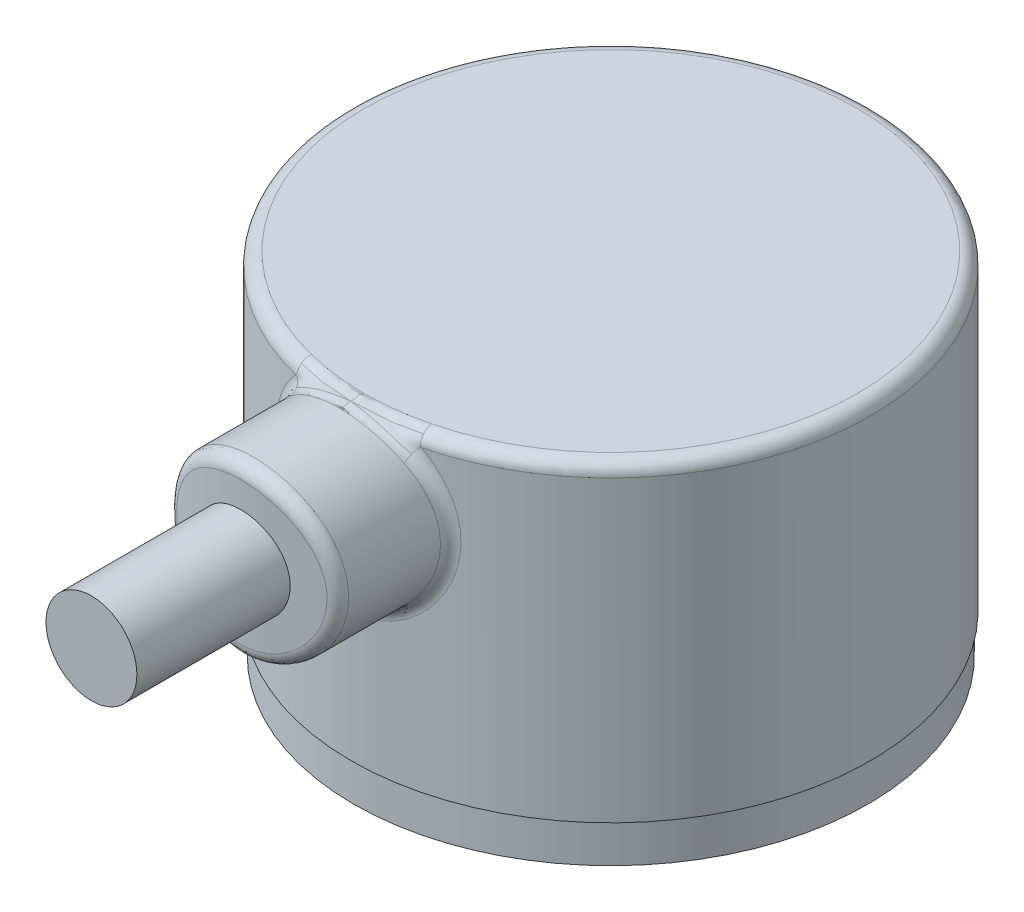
ISO-10303-21;
HEADER;
FILE_DESCRIPTION(('STEP AP214'),'2;1');
FILE_NAME('part.step','',(''),(''),'','','');
FILE_SCHEMA(('AUTOMOTIVE_DESIGN { 1 0 10303 214 1 1 1 1 }'));
ENDSEC;
DATA;
#1=APPLICATION_CONTEXT('core data for automotive mechanical design processes');
#2=APPLICATION_PROTOCOL_DEFINITION('international standard','automotive_design',2000,#1);
#3=PRODUCT_CONTEXT('',#1,'mechanical');
#4=PRODUCT('Part','Part','',(#3));
#5=PRODUCT_RELATED_PRODUCT_CATEGORY('part','',(#4));
#6=PRODUCT_DEFINITION_FORMATION('','',#4);
#7=PRODUCT_DEFINITION_CONTEXT('part definition',#1,'design');
#8=PRODUCT_DEFINITION('design','',#6,#7);
#9=PRODUCT_DEFINITION_SHAPE('','',#8);
#10=(LENGTH_UNIT() NAMED_UNIT(*) SI_UNIT(.MILLI.,.METRE.));
#11=(NAMED_UNIT(*) PLANE_ANGLE_UNIT() SI_UNIT($,.RADIAN.));
#12=(NAMED_UNIT(*) SI_UNIT($,.STERADIAN.) SOLID_ANGLE_UNIT());
#13=UNCERTAINTY_MEASURE_WITH_UNIT(LENGTH_MEASURE(1.E-05),#10,'distance_accuracy_value','');
#14=(GEOMETRIC_REPRESENTATION_CONTEXT(3) GLOBAL_UNCERTAINTY_ASSIGNED_CONTEXT((#13)) GLOBAL_UNIT_ASSIGNED_CONTEXT((#10,
#11,#12)) REPRESENTATION_CONTEXT('',''));
#15=CARTESIAN_POINT('',(0.,0.,0.));
#16=DIRECTION('',(0.,0.,1.));
#17=DIRECTION('',(1.,0.,0.));
#18=AXIS2_PLACEMENT_3D('',#15,#16,#17);
#19=CARTESIAN_POINT('',(0.,32.725,8.5));
#20=DIRECTION('',(0.,1.,0.));
#21=DIRECTION('',(0.,0.,1.));
#22=AXIS2_PLACEMENT_3D('',#19,#20,#21);
#23=CYLINDRICAL_SURFACE('',#22,20.);
#24=CARTESIAN_POINT('',(-1.74409767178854,25.7444929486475,28.4238079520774));
#25=CARTESIAN_POINT('',(-2.03540705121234,26.6736280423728,28.3983072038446));
#26=CARTESIAN_POINT('',(-1.95814602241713,26.6980371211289,27.4276175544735));
#27=CARTESIAN_POINT('',(-1.43451877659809,25.837406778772,28.4509065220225));
#28=CARTESIAN_POINT('',(-1.67591956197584,26.7919889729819,28.4343572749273));
#29=CARTESIAN_POINT('',(-1.61057335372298,26.8078443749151,27.4533611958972));
#30=CARTESIAN_POINT('',(-1.11615099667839,25.9056781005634,28.4714408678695));
#31=CARTESIAN_POINT('',(-1.30600582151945,26.8789953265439,28.4617054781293));
#32=CARTESIAN_POINT('',(-1.25313316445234,26.888528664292,27.4728688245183));
#33=CARTESIAN_POINT('',(-0.471283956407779,25.9904563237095,28.4970473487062));
#34=CARTESIAN_POINT('',(-0.552052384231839,26.9877729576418,28.4960440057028));
#35=CARTESIAN_POINT('',(-0.52912335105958,26.988721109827,27.4971949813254));
#36=CARTESIAN_POINT('',(-0.14478662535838,26.0069753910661,28.502123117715));
#37=CARTESIAN_POINT('',(-0.169949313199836,27.0089841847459,28.5028585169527));
#38=CARTESIAN_POINT('',(-0.162555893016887,27.0082436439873,27.5020169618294));
#39=CARTESIAN_POINT('',(0.495254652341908,25.9879896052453,28.4963429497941));
#40=CARTESIAN_POINT('',(0.58055720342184,26.9845481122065,28.4950817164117));
#41=CARTESIAN_POINT('',(0.556035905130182,26.985805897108,27.4965258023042));
#42=CARTESIAN_POINT('',(0.808862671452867,25.9542284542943,28.4860209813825));
#43=CARTESIAN_POINT('',(0.947035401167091,26.9412649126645,28.4812471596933));
#44=CARTESIAN_POINT('',(0.908132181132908,26.945906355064,27.4867199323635));
#45=CARTESIAN_POINT('',(1.42541156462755,25.8390443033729,28.4515305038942));
#46=CARTESIAN_POINT('',(1.66573807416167,26.7939289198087,28.4351468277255));
#47=CARTESIAN_POINT('',(1.60034843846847,26.8097796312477,27.4539539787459));
#48=CARTESIAN_POINT('',(1.72835227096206,25.7576205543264,28.4273617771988));
#49=CARTESIAN_POINT('',(2.01638090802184,26.6905715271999,28.4030952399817));
#50=CARTESIAN_POINT('',(1.94046823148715,26.7135515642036,27.4309936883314));
#51=CARTESIAN_POINT('',(2.31605092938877,25.5495434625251,28.3676480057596));
#52=CARTESIAN_POINT('',(2.69252251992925,26.4279966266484,28.324430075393));
#53=CARTESIAN_POINT('',(2.6002935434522,26.4676422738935,27.3742656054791));
#54=CARTESIAN_POINT('',(2.60076543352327,25.4227864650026,28.3320769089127));
#55=CARTESIAN_POINT('',(3.01702821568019,26.2696601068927,28.2780640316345));
#56=CARTESIAN_POINT('',(2.91995028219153,26.3178385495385,27.3404730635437));
#57=CARTESIAN_POINT('',(3.1441397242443,25.1278129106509,28.2532242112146));
#58=CARTESIAN_POINT('',(3.63120149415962,25.9042034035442,28.1762200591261));
#59=CARTESIAN_POINT('',(3.53001141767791,25.9692334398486,27.2655630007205));
#60=CARTESIAN_POINT('',(3.40279419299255,24.95958791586,28.2099410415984));
#61=CARTESIAN_POINT('',(3.9206485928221,25.6980639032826,28.1209606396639));
#62=CARTESIAN_POINT('',(3.82040984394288,25.7704220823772,27.224443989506));
#63=CARTESIAN_POINT('',(3.89636712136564,24.5795532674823,28.1184497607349));
#64=CARTESIAN_POINT('',(4.46774733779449,25.2366939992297,28.0053715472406));
#65=CARTESIAN_POINT('',(4.37455763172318,25.3212902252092,27.1375272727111));
#66=CARTESIAN_POINT('',(4.13013975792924,24.3664255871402,28.0701223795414));
#67=CARTESIAN_POINT('',(4.72449124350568,24.9806469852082,27.9449879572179));
#68=CARTESIAN_POINT('',(4.63702054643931,25.0694120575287,27.0916162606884));
#69=CARTESIAN_POINT('',(4.55725353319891,23.905960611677,27.9750975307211));
#70=CARTESIAN_POINT('',(5.18913682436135,24.4324977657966,27.8274971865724));
#71=CARTESIAN_POINT('',(5.11655283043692,24.5252261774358,27.0013426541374));
#72=CARTESIAN_POINT('',(4.75058847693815,23.6586180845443,27.9284003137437));
#73=CARTESIAN_POINT('',(5.39789640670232,24.1406428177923,27.7702950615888));
#74=CARTESIAN_POINT('',(5.33361524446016,24.232912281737,26.9569802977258));
#75=CARTESIAN_POINT('',(5.0945286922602,23.1313743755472,27.841093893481));
#76=CARTESIAN_POINT('',(5.76604110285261,23.5236237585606,27.6643733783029));
#77=CARTESIAN_POINT('',(5.71976630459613,23.6098060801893,26.8740391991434));
#78=CARTESIAN_POINT('',(5.24433228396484,22.8509817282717,27.800604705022));
#79=CARTESIAN_POINT('',(5.92560639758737,23.1975558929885,27.6155723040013));
#80=CARTESIAN_POINT('',(5.88795488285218,23.2784329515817,26.8355744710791));
#81=CARTESIAN_POINT('',(5.49181379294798,22.268907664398,27.7316566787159));
#82=CARTESIAN_POINT('',(6.18725169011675,22.5252219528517,27.5331430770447));
#83=CARTESIAN_POINT('',(6.16580912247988,22.5905272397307,26.7700738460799));
#84=CARTESIAN_POINT('',(5.58950489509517,21.967231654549,27.7031947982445));
#85=CARTESIAN_POINT('',(6.29030743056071,22.1780201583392,27.4992350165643));
#86=CARTESIAN_POINT('',(6.27548958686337,22.2340010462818,26.7430350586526));
#87=CARTESIAN_POINT('',(5.7272350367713,21.3604646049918,27.6625633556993));
#88=CARTESIAN_POINT('',(6.4347727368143,21.4830507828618,27.4511197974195));
#89=CARTESIAN_POINT('',(6.43012297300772,21.5169127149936,26.7044351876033));
#90=CARTESIAN_POINT('',(5.7688668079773,21.0557275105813,27.6499444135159));
#91=CARTESIAN_POINT('',(6.47845182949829,21.1343525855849,27.4361846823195));
#92=CARTESIAN_POINT('',(6.47686409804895,21.1567688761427,26.6924471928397));
#93=CARTESIAN_POINT('',(5.79813828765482,20.4437370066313,27.6411040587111));
#94=CARTESIAN_POINT('',(6.50904803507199,20.4359660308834,27.4257597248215));
#95=CARTESIAN_POINT('',(6.50972798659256,20.4335073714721,26.684048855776));
#96=CARTESIAN_POINT('',(5.78578864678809,20.1364841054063,27.644879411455));
#97=CARTESIAN_POINT('',(6.49610492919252,20.0848130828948,27.4302221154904));
#98=CARTESIAN_POINT('',(6.4958627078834,20.0703903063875,26.6876354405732));
#99=CARTESIAN_POINT('',(5.70882249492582,19.5382628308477,27.6679633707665));
#100=CARTESIAN_POINT('',(6.41557893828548,19.4014440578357,27.4574754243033));
#101=CARTESIAN_POINT('',(6.40945071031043,19.3634015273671,26.7095652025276));
#102=CARTESIAN_POINT('',(5.64584262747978,19.2470851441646,27.686785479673));
#103=CARTESIAN_POINT('',(6.34939267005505,19.0676483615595,27.4797982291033));
#104=CARTESIAN_POINT('',(6.33874149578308,19.019282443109,26.7274462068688));
#105=CARTESIAN_POINT('',(5.47182927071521,18.6790528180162,27.7371311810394));
#106=CARTESIAN_POINT('',(6.16638117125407,18.4151847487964,27.5396107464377));
#107=CARTESIAN_POINT('',(6.14337195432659,18.3479715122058,26.7752746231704));
#108=CARTESIAN_POINT('',(5.36079091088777,18.4021996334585,27.7686560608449));
#109=CARTESIAN_POINT('',(6.0488995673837,18.0954967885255,27.5773056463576));
#110=CARTESIAN_POINT('',(6.01870615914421,18.020781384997,26.8052232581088));
#111=CARTESIAN_POINT('',(5.09183454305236,17.8654394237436,27.8414802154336));
#112=CARTESIAN_POINT('',(5.7634136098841,17.4728854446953,27.6647828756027));
#113=CARTESIAN_POINT('',(5.71674150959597,17.3864284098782,26.8744062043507));
#114=CARTESIAN_POINT('',(4.93316887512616,17.6058900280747,27.88293306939));
#115=CARTESIAN_POINT('',(5.59373283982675,17.169735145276,27.7149872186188));
#116=CARTESIAN_POINT('',(5.53860323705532,17.0796882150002,26.9137864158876));
#117=CARTESIAN_POINT('',(4.57405683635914,17.1151430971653,27.9708011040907));
#118=CARTESIAN_POINT('',(5.20750237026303,16.5925222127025,27.8221905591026));
#119=CARTESIAN_POINT('',(5.13541835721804,16.4997145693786,26.9972610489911));
#120=CARTESIAN_POINT('',(4.37359866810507,16.8839535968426,28.0172176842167));
#121=CARTESIAN_POINT('',(4.99002003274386,16.3183331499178,27.8793689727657));
#122=CARTESIAN_POINT('',(4.91035850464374,16.2264906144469,27.0413567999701));
#123=CARTESIAN_POINT('',(3.92751972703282,16.4472689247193,28.1119466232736));
#124=CARTESIAN_POINT('',(4.50207733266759,15.7955038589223,27.9972333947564));
#125=CARTESIAN_POINT('',(4.40953351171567,15.7104087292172,27.1313492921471));
#126=CARTESIAN_POINT('',(3.68046482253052,16.2430947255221,28.1602635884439));
#127=CARTESIAN_POINT('',(4.22926179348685,15.548802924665,28.057984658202));
#128=CARTESIAN_POINT('',(4.13215823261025,15.4691119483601,27.1772504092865));
#129=CARTESIAN_POINT('',(3.15309269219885,15.8768434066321,28.2516951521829));
#130=CARTESIAN_POINT('',(3.64107912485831,15.1012924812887,28.1743097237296));
#131=CARTESIAN_POINT('',(3.540063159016,15.0362694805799,27.264110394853));
#132=CARTESIAN_POINT('',(2.87278399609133,15.7147555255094,28.2948110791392));
#133=CARTESIAN_POINT('',(3.32546631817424,14.9013972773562,28.2297408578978));
#134=CARTESIAN_POINT('',(3.22535294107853,14.8447110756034,27.3050705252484));
#135=CARTESIAN_POINT('',(2.30923948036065,15.4483027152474,28.3681082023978));
#136=CARTESIAN_POINT('',(2.68457744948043,14.569165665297,28.3250669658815));
#137=CARTESIAN_POINT('',(2.59264614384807,14.5298122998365,27.3747027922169));
#138=CARTESIAN_POINT('',(2.02794083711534,15.3404191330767,28.3990364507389));
#139=CARTESIAN_POINT('',(2.36212904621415,14.4335941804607,28.3656408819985));
#140=CARTESIAN_POINT('',(2.27682448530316,14.4023135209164,27.4040846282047));
#141=CARTESIAN_POINT('',(1.45013154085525,15.1675615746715,28.4494643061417));
#142=CARTESIAN_POINT('',(1.694159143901,14.2143762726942,28.4324276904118));
#143=CARTESIAN_POINT('',(1.62810222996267,14.1980273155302,27.4519910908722));
#144=CARTESIAN_POINT('',(1.15362426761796,15.1025781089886,28.468966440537));
#145=CARTESIAN_POINT('',(1.34968728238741,14.1315678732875,28.4583973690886));
#146=CARTESIAN_POINT('',(1.29520542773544,14.1212286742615,27.4705181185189));
#147=CARTESIAN_POINT('',(0.541972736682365,15.0159984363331,28.4950807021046));
#148=CARTESIAN_POINT('',(0.634854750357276,14.020524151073,28.4934013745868));
#149=CARTESIAN_POINT('',(0.608487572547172,14.0189072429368,27.4953266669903));
#150=CARTESIAN_POINT('',(0.226543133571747,14.9960705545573,28.5011969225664));
#151=CARTESIAN_POINT('',(0.26575902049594,13.9949408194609,28.5016109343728));
#152=CARTESIAN_POINT('',(0.254346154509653,13.995356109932,27.5011370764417));
#153=CARTESIAN_POINT('',(-0.403488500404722,15.0052139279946,28.4984117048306));
#154=CARTESIAN_POINT('',(-0.473087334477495,14.0067095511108,28.4978634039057));
#155=CARTESIAN_POINT('',(-0.453007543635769,14.0061619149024,27.4984911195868));
#156=CARTESIAN_POINT('',(-0.718090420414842,15.0342914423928,28.4895083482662));
#157=CARTESIAN_POINT('',(-0.840919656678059,14.044008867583,28.4859231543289));
#158=CARTESIAN_POINT('',(-0.806219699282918,14.0405262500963,27.4900329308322));
#159=CARTESIAN_POINT('',(-1.33718467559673,15.1403817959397,28.4576548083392));
#160=CARTESIAN_POINT('',(-1.56325388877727,14.1798421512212,28.4433040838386));
#161=CARTESIAN_POINT('',(-1.50129370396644,14.1659057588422,27.4597720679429));
#162=CARTESIAN_POINT('',(-1.64168465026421,15.2173575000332,28.4347155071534));
#163=CARTESIAN_POINT('',(-1.91613058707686,14.2776770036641,28.4128416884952));
#164=CARTESIAN_POINT('',(-1.84316413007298,14.2568770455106,27.4379797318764));
#165=CARTESIAN_POINT('',(-2.23257825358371,15.4166619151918,28.3772184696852));
#166=CARTESIAN_POINT('',(-2.59697712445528,14.5295752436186,28.3369697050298));
#167=CARTESIAN_POINT('',(-2.50657649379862,14.4924186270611,27.3833575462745));
#168=CARTESIAN_POINT('',(-2.51896965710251,15.5389961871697,28.3426593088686));
#169=CARTESIAN_POINT('',(-2.9239377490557,14.6826530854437,28.291838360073));
#170=CARTESIAN_POINT('',(-2.82811593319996,14.636995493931,27.3505263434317));
#171=CARTESIAN_POINT('',(-3.07075467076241,15.8276558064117,28.2648526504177));
#172=CARTESIAN_POINT('',(-3.54871004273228,15.0409392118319,28.1911465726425));
#173=CARTESIAN_POINT('',(-3.44762001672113,14.9781386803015,27.2766100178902));
#174=CARTESIAN_POINT('',(-3.33574157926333,15.994650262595,28.2214756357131));
#175=CARTESIAN_POINT('',(-3.84574531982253,15.2459316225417,28.135660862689));
#176=CARTESIAN_POINT('',(-3.74512804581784,15.1754957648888,27.2354018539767));
#177=CARTESIAN_POINT('',(-3.83308953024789,16.3671442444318,28.1308795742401));
#178=CARTESIAN_POINT('',(-4.39803743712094,15.6990072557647,28.0209676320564));
#179=CARTESIAN_POINT('',(-4.3035141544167,15.6157159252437,27.1493355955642));
#180=CARTESIAN_POINT('',(-4.06544363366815,16.5726519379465,28.0836597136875));
#181=CARTESIAN_POINT('',(-4.6536469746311,15.946338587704,27.9618537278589));
#182=CARTESIAN_POINT('',(-4.56438444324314,15.858588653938,27.1044767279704));
#183=CARTESIAN_POINT('',(-4.49912146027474,17.0246373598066,27.9886870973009));
#184=CARTESIAN_POINT('',(-5.12618011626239,16.4852926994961,27.8442080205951));
#185=CARTESIAN_POINT('',(-5.05128636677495,16.3927532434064,27.0142527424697));
#186=CARTESIAN_POINT('',(-4.69912159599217,17.2722704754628,27.9409708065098));
#187=CARTESIAN_POINT('',(-5.34245722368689,16.7779457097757,27.7856562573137));
#188=CARTESIAN_POINT('',(-5.2758319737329,16.6854105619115,26.9689222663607));
#189=CARTESIAN_POINT('',(-5.05263222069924,17.7968589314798,27.85211230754));
#190=CARTESIAN_POINT('',(-5.72136129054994,17.3927386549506,27.6776803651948));
#191=CARTESIAN_POINT('',(-5.67272799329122,17.3053787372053,26.8845066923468));
#192=CARTESIAN_POINT('',(-5.20614363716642,18.0738136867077,27.810969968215));
#193=CARTESIAN_POINT('',(-5.88504664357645,17.7151711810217,27.6280299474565));
#194=CARTESIAN_POINT('',(-5.84507944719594,17.6326889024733,26.8454214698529));
#195=CARTESIAN_POINT('',(-5.46133443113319,18.648343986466,27.7403582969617));
#196=CARTESIAN_POINT('',(-6.15510437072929,18.379469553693,27.5435143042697));
#197=CARTESIAN_POINT('',(-6.13158911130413,18.311679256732,26.7783403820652));
#198=CARTESIAN_POINT('',(-5.56324117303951,18.9458223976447,27.7108378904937));
#199=CARTESIAN_POINT('',(-6.26268208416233,18.7221007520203,27.5083150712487));
#200=CARTESIAN_POINT('',(-6.24600258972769,18.6632446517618,26.750295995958));
#201=CARTESIAN_POINT('',(-5.71260955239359,19.5538157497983,27.666957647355));
#202=CARTESIAN_POINT('',(-6.41943150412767,19.4188565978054,27.4563207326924));
#203=CARTESIAN_POINT('',(-6.41370254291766,19.3817822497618,26.7086097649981));
#204=CARTESIAN_POINT('',(-5.76008838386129,19.8643265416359,27.6525930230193));
#205=CARTESIAN_POINT('',(-6.46926499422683,19.774298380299,27.4393119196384));
#206=CARTESIAN_POINT('',(-6.46700832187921,19.7487495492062,26.6949633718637));
#207=CARTESIAN_POINT('',(-5.79806789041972,20.4766682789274,27.6411274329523));
#208=CARTESIAN_POINT('',(-6.50897237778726,20.4731865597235,27.4257879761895));
#209=CARTESIAN_POINT('',(-6.50964894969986,20.4724261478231,26.6840710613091));
#210=CARTESIAN_POINT('',(-5.79070169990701,20.7783703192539,27.6433801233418));
#211=CARTESIAN_POINT('',(-6.50125292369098,20.8179531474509,27.4284503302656));
#212=CARTESIAN_POINT('',(-6.50137872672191,20.8289831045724,26.6862111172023));
#213=CARTESIAN_POINT('',(-5.72429828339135,21.3761034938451,27.6633395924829));
#214=CARTESIAN_POINT('',(-6.43179282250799,21.5005832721,27.4520082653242));
#215=CARTESIAN_POINT('',(-6.42682579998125,21.535395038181,26.7051726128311));
#216=CARTESIAN_POINT('',(-5.66526309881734,21.6721348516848,27.6810457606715));
#217=CARTESIAN_POINT('',(-6.36977640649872,21.8397928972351,27.4729971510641));
#218=CARTESIAN_POINT('',(-6.36054538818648,21.8852502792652,26.7219934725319));
#219=CARTESIAN_POINT('',(-5.49858215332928,22.2467923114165,27.7294809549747));
#220=CARTESIAN_POINT('',(-6.19459328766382,22.4994068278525,27.5304943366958));
#221=CARTESIAN_POINT('',(-6.17340814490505,22.5643909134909,26.7680069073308));
#222=CARTESIAN_POINT('',(-5.39150605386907,22.5255800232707,27.7600571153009));
#223=CARTESIAN_POINT('',(-6.08138829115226,22.8210693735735,27.5670218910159));
#224=CARTESIAN_POINT('',(-6.05319088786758,22.8938673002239,26.7970542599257));
#225=CARTESIAN_POINT('',(-5.1322295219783,23.0623408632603,27.8307577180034));
#226=CARTESIAN_POINT('',(-5.80646058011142,23.4430033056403,27.6518453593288));
#227=CARTESIAN_POINT('',(-5.7620940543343,23.5282210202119,26.8642198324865));
#228=CARTESIAN_POINT('',(-4.98002065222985,23.3203100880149,27.8708839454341));
#229=CARTESIAN_POINT('',(-5.64388003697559,23.7439303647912,27.7003745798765));
#230=CARTESIAN_POINT('',(-5.59120500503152,23.8330937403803,26.902339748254));
#231=CARTESIAN_POINT('',(-4.62876993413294,23.8175483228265,27.9578576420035));
#232=CARTESIAN_POINT('',(-5.26659908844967,24.3279643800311,27.8063200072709));
#233=CARTESIAN_POINT('',(-5.19684624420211,24.4207389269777,26.9849647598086));
#234=CARTESIAN_POINT('',(-4.42831853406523,24.0558900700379,28.0048865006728));
#235=CARTESIAN_POINT('',(-5.0494350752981,24.6101999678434,27.86415459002));
#236=CARTESIAN_POINT('',(-4.97179399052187,24.7024155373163,27.0296421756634));
#237=CARTESIAN_POINT('',(-3.98882005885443,24.4978824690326,28.099483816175));
#238=CARTESIAN_POINT('',(-4.56952277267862,25.1384300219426,27.9816246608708));
#239=CARTESIAN_POINT('',(-4.47835706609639,25.2247701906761,27.119509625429));
#240=CARTESIAN_POINT('',(-3.74976568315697,24.7015265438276,28.14705237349));
#241=CARTESIAN_POINT('',(-4.30599063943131,25.3840561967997,28.0413187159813));
#242=CARTESIAN_POINT('',(-4.20996419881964,25.465440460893,27.1646997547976));
#243=CARTESIAN_POINT('',(-3.23205142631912,25.0738371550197,28.2389130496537));
#244=CARTESIAN_POINT('',(-3.72962533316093,25.8381048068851,28.1579456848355));
#245=CARTESIAN_POINT('',(-3.62871228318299,25.9054439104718,27.2519673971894));
#246=CARTESIAN_POINT('',(-2.9524966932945,25.2414112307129,28.2830820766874));
#247=CARTESIAN_POINT('',(-3.41544019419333,26.0443630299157,28.2146112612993));
#248=CARTESIAN_POINT('',(-3.31484856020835,26.1034859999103,27.2939279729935));
#249=CARTESIAN_POINT('',(-2.36637128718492,25.529359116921,28.3617113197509));
#250=CARTESIAN_POINT('',(-2.74972386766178,26.4029202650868,28.3167215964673));
#251=CARTESIAN_POINT('',(-2.65678958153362,26.4437880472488,27.368625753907));
#252=CARTESIAN_POINT('',(-2.05980461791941,25.6497399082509,28.3961729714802));
#253=CARTESIAN_POINT('',(-2.39866207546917,26.5540266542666,28.3618793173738));
#254=CARTESIAN_POINT('',(-2.31259882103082,26.5860562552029,27.4013643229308));
#255=CARTESIAN_POINT('',(-1.74409767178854,25.7444929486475,28.4238079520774));
#256=CARTESIAN_POINT('',(-2.03540705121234,26.6736280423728,28.3983072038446));
#257=CARTESIAN_POINT('',(-1.95814602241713,26.6980371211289,27.4276175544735));
#258=(BOUNDED_SURFACE() B_SPLINE_SURFACE(3,2,((#24,#25,#26),(#27,#28,#29),(#30,#31,#32),(#33,
#34,#35),(#36,#37,#38),(#39,#40,#41),(#42,#43,#44),(#45,#46,#47),(#48,#49,#50),(#51,#52,#53),
(#54,#55,#56),(#57,#58,#59),(#60,#61,#62),(#63,#64,#65),(#66,#67,#68),(#69,#70,#71),(#72,#73,
#74),(#75,#76,#77),(#78,#79,#80),(#81,#82,#83),(#84,#85,#86),(#87,#88,#89),(#90,#91,#92),(#93,
#94,#95),(#96,#97,#98),(#99,#100,#101),(#102,#103,#104),(#105,#106,#107),(#108,#109,#110),(#111,
#112,#113),(#114,#115,#116),(#117,#118,#119),(#120,#121,#122),(#123,#124,#125),(#126,#127,#128),
(#129,#130,#131),(#132,#133,#134),(#135,#136,#137),(#138,#139,#140),(#141,#142,#143),(#144,#145,
#146),(#147,#148,#149),(#150,#151,#152),(#153,#154,#155),(#156,#157,#158),(#159,#160,#161),
(#162,#163,#164),(#165,#166,#167),(#168,#169,#170),(#171,#172,#173),(#174,#175,#176),(#177,#178,
#179),(#180,#181,#182),(#183,#184,#185),(#186,#187,#188),(#189,#190,#191),(#192,#193,#194),
(#195,#196,#197),(#198,#199,#200),(#201,#202,#203),(#204,#205,#206),(#207,#208,#209),(#210,#211,
#212),(#213,#214,#215),(#216,#217,#218),(#219,#220,#221),(#222,#223,#224),(#225,#226,#227),
(#228,#229,#230),(#231,#232,#233),(#234,#235,#236),(#237,#238,#239),(#240,#241,#242),(#243,#244,
#245),(#246,#247,#248),(#249,#250,#251),(#252,#253,#254),(#255,#256,#257)),.UNSPECIFIED.,.T.,
.F.,.F.) B_SPLINE_SURFACE_WITH_KNOTS((4,2,2,2,2,2,2,2,2,2,2,2,2,2,2,2,2,2,2,2,2,2,2,2,2,2,2,2,2,
2,2,2,2,2,2,2,2,2,4),(3,3),(0.,0.92734267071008,1.8544673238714,2.7501792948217,
3.64590534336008,4.54369270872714,5.44166290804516,6.37102366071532,7.3005266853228,
8.24619647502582,9.19162688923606,10.1095856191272,11.0273632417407,11.9166118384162,
12.8059505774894,13.7100534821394,14.6144119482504,15.5533604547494,16.4920686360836,
17.3574879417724,18.2227157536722,19.1194905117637,20.0163798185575,20.9125746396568,
21.8088793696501,22.719448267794,23.630210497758,24.5719377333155,25.5136461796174,
26.4511686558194,27.3883948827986,28.2893647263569,29.1902989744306,30.0808214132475,
30.9715104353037,31.8923166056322,32.8132971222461,33.7591363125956,34.7048355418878),(0.,1.),
.UNSPECIFIED.) GEOMETRIC_REPRESENTATION_ITEM() RATIONAL_B_SPLINE_SURFACE(((1.,0.716334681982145,
1.),(1.,0.713080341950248,1.),(1.,0.710585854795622,1.),(1.,0.707469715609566,1.),(1.,
0.706847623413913,1.),(1.,0.707553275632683,1.),(1.,0.70881567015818,1.),(1.,0.712998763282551,
1.),(1.,0.715919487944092,1.),(1.,0.723050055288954,1.),(1.,0.727262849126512,1.),(1.,
0.736471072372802,1.),(1.,0.741466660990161,1.),(1.,0.751872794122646,1.),(1.,0.757291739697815,
1.),(1.,0.767797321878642,1.),(1.,0.77288390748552,1.),(1.,0.782283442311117,1.),(1.,
0.78658139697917,1.),(1.,0.793840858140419,1.),(1.,0.796802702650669,1.),(1.,0.801015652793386,
1.),(1.,0.802313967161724,1.),(1.,0.803224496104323,1.),(1.,0.802837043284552,1.),(1.,
0.800454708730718,1.),(1.,0.798510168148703,1.),(1.,0.793261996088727,1.),(1.,0.789958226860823,
1.),(1.,0.782235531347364,1.),(1.,0.777799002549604,1.),(1.,0.768263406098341,1.),(1.,
0.763164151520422,1.),(1.,0.752606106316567,1.),(1.,0.747141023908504,1.),(1.,0.736654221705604,
1.),(1.,0.731632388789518,1.),(1.,0.72300004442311,1.),(1.,0.719309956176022,1.),(1.,
0.713253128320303,1.),(1.,0.710886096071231,1.),(1.,0.7077098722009,1.),(1.,0.70696062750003,
1.),(1.,0.707300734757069,1.),(1.,0.708390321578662,1.),(1.,0.712257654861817,1.),(1.,
0.715034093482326,1.),(1.,0.721912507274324,1.),(1.,0.726014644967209,1.),(1.,0.735122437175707,
1.),(1.,0.740141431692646,1.),(1.,0.750469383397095,1.),(1.,0.755778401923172,1.),(1.,
0.766307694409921,1.),(1.,0.771518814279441,1.),(1.,0.781106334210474,1.),(1.,0.785482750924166,
1.),(1.,0.792930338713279,1.),(1.,0.796007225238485,1.),(1.,0.800562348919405,1.),(1.,
0.802041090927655,1.),(1.,0.803222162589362,1.),(1.,0.802990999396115,1.),(1.,0.80093240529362,
1.),(1.,0.799105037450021,1.),(1.,0.79406200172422,1.),(1.,0.790862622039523,1.),(1.,
0.78337826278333,1.),(1.,0.779093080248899,1.),(1.,0.76967826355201,1.),(1.,0.764524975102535,
1.),(1.,0.754005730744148,1.),(1.,0.748639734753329,1.),(1.,0.738132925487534,1.),(1.,
0.733002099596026,1.),(1.,0.723762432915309,1.),(1.,0.71965344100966,1.),(1.,0.716334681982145,1.))) REPRESENTATION_ITEM('') SURFACE());
#259=CARTESIAN_POINT('',(-1.74409767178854,25.7444929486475,28.4238079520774));
#260=CARTESIAN_POINT('',(-2.05980461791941,25.6497399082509,28.3961729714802));
#261=CARTESIAN_POINT('',(-2.36637128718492,25.529359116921,28.3617113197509));
#262=CARTESIAN_POINT('',(-2.9524966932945,25.2414112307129,28.2830820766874));
#263=CARTESIAN_POINT('',(-3.23205142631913,25.0738371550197,28.2389130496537));
#264=CARTESIAN_POINT('',(-3.74976568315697,24.7015265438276,28.14705237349));
#265=CARTESIAN_POINT('',(-3.98882005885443,24.4978824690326,28.099483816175));
#266=CARTESIAN_POINT('',(-4.42831853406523,24.0558900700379,28.0048865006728));
#267=CARTESIAN_POINT('',(-4.62876993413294,23.8175483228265,27.9578576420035));
#268=CARTESIAN_POINT('',(-4.98002065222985,23.3203100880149,27.8708839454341));
#269=CARTESIAN_POINT('',(-5.1322295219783,23.0623408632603,27.8307577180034));
#270=CARTESIAN_POINT('',(-5.39150605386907,22.5255800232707,27.7600571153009));
#271=CARTESIAN_POINT('',(-5.49858215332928,22.2467923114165,27.7294809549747));
#272=CARTESIAN_POINT('',(-5.66526309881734,21.6721348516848,27.6810457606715));
#273=CARTESIAN_POINT('',(-5.72429828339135,21.3761034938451,27.6633395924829));
#274=CARTESIAN_POINT('',(-5.79070169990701,20.7783703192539,27.6433801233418));
#275=CARTESIAN_POINT('',(-5.79806789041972,20.4766682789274,27.6411274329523));
#276=CARTESIAN_POINT('',(-5.76008838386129,19.8643265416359,27.6525930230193));
#277=CARTESIAN_POINT('',(-5.71260955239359,19.5538157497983,27.666957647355));
#278=CARTESIAN_POINT('',(-5.56324117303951,18.9458223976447,27.7108378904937));
#279=CARTESIAN_POINT('',(-5.46133443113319,18.648343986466,27.7403582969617));
#280=CARTESIAN_POINT('',(-5.20614363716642,18.0738136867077,27.810969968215));
#281=CARTESIAN_POINT('',(-5.05263222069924,17.7968589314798,27.85211230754));
#282=CARTESIAN_POINT('',(-4.69912159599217,17.2722704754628,27.9409708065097));
#283=CARTESIAN_POINT('',(-4.49912146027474,17.0246373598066,27.9886870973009));
#284=CARTESIAN_POINT('',(-4.06544363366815,16.5726519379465,28.0836597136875));
#285=CARTESIAN_POINT('',(-3.83308953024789,16.3671442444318,28.1308795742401));
#286=CARTESIAN_POINT('',(-3.33574157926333,15.994650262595,28.2214756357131));
#287=CARTESIAN_POINT('',(-3.0707546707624,15.8276558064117,28.2648526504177));
#288=CARTESIAN_POINT('',(-2.51896965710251,15.5389961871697,28.3426593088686));
#289=CARTESIAN_POINT('',(-2.23257825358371,15.4166619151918,28.3772184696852));
#290=CARTESIAN_POINT('',(-1.64168465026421,15.2173575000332,28.4347155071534));
#291=CARTESIAN_POINT('',(-1.33718467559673,15.1403817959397,28.4576548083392));
#292=CARTESIAN_POINT('',(-0.718090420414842,15.0342914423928,28.4895083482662));
#293=CARTESIAN_POINT('',(-0.403488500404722,15.0052139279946,28.4984117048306));
#294=CARTESIAN_POINT('',(0.226543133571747,14.9960705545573,28.5011969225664));
#295=CARTESIAN_POINT('',(0.541972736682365,15.0159984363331,28.4950807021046));
#296=CARTESIAN_POINT('',(1.15362426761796,15.1025781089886,28.468966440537));
#297=CARTESIAN_POINT('',(1.45013154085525,15.1675615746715,28.4494643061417));
#298=CARTESIAN_POINT('',(2.02794083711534,15.3404191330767,28.3990364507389));
#299=CARTESIAN_POINT('',(2.30923948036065,15.4483027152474,28.3681082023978));
#300=CARTESIAN_POINT('',(2.87278399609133,15.7147555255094,28.2948110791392));
#301=CARTESIAN_POINT('',(3.15309269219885,15.8768434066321,28.2516951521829));
#302=CARTESIAN_POINT('',(3.68046482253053,16.2430947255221,28.1602635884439));
#303=CARTESIAN_POINT('',(3.92751972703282,16.4472689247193,28.1119466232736));
#304=CARTESIAN_POINT('',(4.37359866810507,16.8839535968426,28.0172176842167));
#305=CARTESIAN_POINT('',(4.57405683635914,17.1151430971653,27.9708011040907));
#306=CARTESIAN_POINT('',(4.93316887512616,17.6058900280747,27.88293306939));
#307=CARTESIAN_POINT('',(5.09183454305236,17.8654394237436,27.8414802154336));
#308=CARTESIAN_POINT('',(5.36079091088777,18.4021996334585,27.7686560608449));
#309=CARTESIAN_POINT('',(5.47182927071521,18.6790528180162,27.7371311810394));
#310=CARTESIAN_POINT('',(5.64584262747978,19.2470851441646,27.686785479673));
#311=CARTESIAN_POINT('',(5.70882249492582,19.5382628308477,27.6679633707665));
#312=CARTESIAN_POINT('',(5.78578864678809,20.1364841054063,27.644879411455));
#313=CARTESIAN_POINT('',(5.79813828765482,20.4437370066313,27.6411040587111));
#314=CARTESIAN_POINT('',(5.7688668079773,21.0557275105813,27.6499444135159));
#315=CARTESIAN_POINT('',(5.7272350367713,21.3604646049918,27.6625633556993));
#316=CARTESIAN_POINT('',(5.58950489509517,21.967231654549,27.7031947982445));
#317=CARTESIAN_POINT('',(5.49181379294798,22.268907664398,27.7316566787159));
#318=CARTESIAN_POINT('',(5.24433228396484,22.8509817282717,27.800604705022));
#319=CARTESIAN_POINT('',(5.0945286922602,23.1313743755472,27.841093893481));
#320=CARTESIAN_POINT('',(4.75058847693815,23.6586180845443,27.9284003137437));
#321=CARTESIAN_POINT('',(4.55725353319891,23.905960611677,27.9750975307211));
#322=CARTESIAN_POINT('',(4.13013975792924,24.3664255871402,28.0701223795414));
#323=CARTESIAN_POINT('',(3.89636712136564,24.5795532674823,28.1184497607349));
#324=CARTESIAN_POINT('',(3.40279419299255,24.95958791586,28.2099410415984));
#325=CARTESIAN_POINT('',(3.1441397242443,25.1278129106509,28.2532242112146));
#326=CARTESIAN_POINT('',(2.60076543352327,25.4227864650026,28.3320769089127));
#327=CARTESIAN_POINT('',(2.31605092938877,25.5495434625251,28.3676480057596));
#328=CARTESIAN_POINT('',(1.72835227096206,25.7576205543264,28.4273617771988));
#329=CARTESIAN_POINT('',(1.42541156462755,25.8390443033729,28.4515305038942));
#330=CARTESIAN_POINT('',(0.808862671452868,25.9542284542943,28.4860209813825));
#331=CARTESIAN_POINT('',(0.495254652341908,25.9879896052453,28.4963429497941));
#332=CARTESIAN_POINT('',(-0.144786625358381,26.0069753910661,28.502123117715));
#333=CARTESIAN_POINT('',(-0.47128395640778,25.9904563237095,28.4970473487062));
#334=CARTESIAN_POINT('',(-1.11615099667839,25.9056781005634,28.4714408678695));
#335=CARTESIAN_POINT('',(-1.43451877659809,25.837406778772,28.4509065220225));
#336=CARTESIAN_POINT('',(-1.74409767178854,25.7444929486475,28.4238079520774));
#337=B_SPLINE_CURVE_WITH_KNOTS('',3,(#259,#260,#261,#262,#263,#264,#265,#266,#267,#268,#269,
#270,#271,#272,#273,#274,#275,#276,#277,#278,#279,#280,#281,#282,#283,#284,#285,#286,#287,#288,
#289,#290,#291,#292,#293,#294,#295,#296,#297,#298,#299,#300,#301,#302,#303,#304,#305,#306,#307,
#308,#309,#310,#311,#312,#313,#314,#315,#316,#317,#318,#319,#320,#321,#322,#323,#324,#325,#326,
#327,#328,#329,#330,#331,#332,#333,#334,#335,#336),.UNSPECIFIED.,.T.,.F.,(4,2,2,2,2,2,2,2,2,2,2,
2,2,2,2,2,2,2,2,2,2,2,2,2,2,2,2,2,2,2,2,2,2,2,2,2,2,2,4),(0.,0.94569922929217,1.8915384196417,
2.81251893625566,3.73332510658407,4.62401412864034,5.51453656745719,6.41547081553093,
7.31644065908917,8.25366688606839,9.19118936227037,10.1328978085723,11.0746250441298,
11.9853872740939,12.8959561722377,13.792260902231,14.6884557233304,15.5853450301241,
16.4821197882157,17.3473476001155,18.2127669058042,19.1514750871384,20.0904235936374,
20.9947820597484,21.8988849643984,22.7882237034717,23.6774723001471,24.5952499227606,
25.5132086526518,26.458639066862,27.404308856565,28.3338118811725,29.2631726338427,
30.1611428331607,31.0589301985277,31.9546562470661,32.8503682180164,33.7774928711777,
34.7048355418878),.UNSPECIFIED.);
#338=CARTESIAN_POINT('',(-1.74409767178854,25.7444929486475,28.4238079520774));
#339=VERTEX_POINT('',#338);
#340=EDGE_CURVE('E12',#339,#339,#337,.T.);
#341=ORIENTED_EDGE('',*,*,#340,.T.);
#342=EDGE_LOOP('',(#341));
#343=FACE_BOUND('',#342,.T.);
#344=CARTESIAN_POINT('',(-3.5,20.5,28.1913686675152));
#345=CARTESIAN_POINT('',(-3.49999229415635,20.3050253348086,28.1913722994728));
#346=CARTESIAN_POINT('',(-3.48365259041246,20.1099478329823,28.1942958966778));
#347=CARTESIAN_POINT('',(-3.41875992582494,19.7252768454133,28.2056622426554));
#348=CARTESIAN_POINT('',(-3.37017817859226,19.5356884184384,28.2141099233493));
#349=CARTESIAN_POINT('',(-3.24232496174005,19.1676178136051,28.2355390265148));
#350=CARTESIAN_POINT('',(-3.16308027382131,18.9891261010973,28.2485164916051));
#351=CARTESIAN_POINT('',(-2.97621906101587,18.6479876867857,28.2775382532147));
#352=CARTESIAN_POINT('',(-2.86860534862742,18.4853394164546,28.2935822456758));
#353=CARTESIAN_POINT('',(-2.62681511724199,18.1787226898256,28.3271238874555));
#354=CARTESIAN_POINT('',(-2.49239055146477,18.0349511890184,28.3446341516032));
#355=CARTESIAN_POINT('',(-2.20133053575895,17.7718819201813,28.3790235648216));
#356=CARTESIAN_POINT('',(-2.04469371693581,17.6525856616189,28.3959026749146));
#357=CARTESIAN_POINT('',(-1.71237241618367,17.4411079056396,28.4272621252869));
#358=CARTESIAN_POINT('',(-1.53656898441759,17.3491106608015,28.4417258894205));
#359=CARTESIAN_POINT('',(-1.17170759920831,17.1960277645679,28.4664842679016));
#360=CARTESIAN_POINT('',(-0.98265059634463,17.1349398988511,28.4767791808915));
#361=CARTESIAN_POINT('',(-0.598686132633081,17.0460148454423,28.4919508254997));
#362=CARTESIAN_POINT('',(-0.403857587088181,17.0178462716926,28.4968815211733));
#363=CARTESIAN_POINT('',(-0.0121814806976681,16.9945281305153,28.5009548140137));
#364=CARTESIAN_POINT('',(0.18466592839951,16.9993760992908,28.5000978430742));
#365=CARTESIAN_POINT('',(0.572523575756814,17.0416966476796,28.4927348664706));
#366=CARTESIAN_POINT('',(0.763574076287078,17.0788125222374,28.4862906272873));
#367=CARTESIAN_POINT('',(1.13669286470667,17.1840526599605,28.4685461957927));
#368=CARTESIAN_POINT('',(1.31876085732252,17.2521779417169,28.4572458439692));
#369=CARTESIAN_POINT('',(1.66979708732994,17.4178518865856,28.4309544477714));
#370=CARTESIAN_POINT('',(1.83869534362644,17.515545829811,28.4159452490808));
#371=CARTESIAN_POINT('',(2.15783520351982,17.7374772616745,28.3839007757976));
#372=CARTESIAN_POINT('',(2.3080751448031,17.8617171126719,28.3668653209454));
#373=CARTESIAN_POINT('',(2.58774350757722,18.1351872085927,28.3323911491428));
#374=CARTESIAN_POINT('',(2.7168668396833,18.284729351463,28.3149500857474));
#375=CARTESIAN_POINT('',(2.94824105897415,18.603512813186,28.2818496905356));
#376=CARTESIAN_POINT('',(3.05049164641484,18.7727543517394,28.2661903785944));
#377=CARTESIAN_POINT('',(3.22528817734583,19.1265057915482,28.2384243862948));
#378=CARTESIAN_POINT('',(3.29779446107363,19.3110356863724,28.2263224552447));
#379=CARTESIAN_POINT('',(3.41069311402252,19.6899159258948,28.2071175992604));
#380=CARTESIAN_POINT('',(3.4510886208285,19.884265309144,28.2000141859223));
#381=CARTESIAN_POINT('',(3.4981833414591,20.2745296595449,28.1917059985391));
#382=CARTESIAN_POINT('',(3.50531877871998,20.4703904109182,28.1904248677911));
#383=CARTESIAN_POINT('',(3.48685594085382,20.8605063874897,28.1937025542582));
#384=CARTESIAN_POINT('',(3.46125906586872,21.0547616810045,28.1982611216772));
#385=CARTESIAN_POINT('',(3.37843113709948,21.4347482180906,28.2126337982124));
#386=CARTESIAN_POINT('',(3.32142468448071,21.6205299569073,28.2224105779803));
#387=CARTESIAN_POINT('',(3.17763242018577,21.9799039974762,28.2460864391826));
#388=CARTESIAN_POINT('',(3.09084466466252,22.153495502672,28.2599857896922));
#389=CARTESIAN_POINT('',(2.88893373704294,22.4854953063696,28.2905167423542));
#390=CARTESIAN_POINT('',(2.7735325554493,22.643732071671,28.3071745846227));
#391=CARTESIAN_POINT('',(2.51804956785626,22.938751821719,28.3412700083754));
#392=CARTESIAN_POINT('',(2.3779658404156,23.0755331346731,28.3587076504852));
#393=CARTESIAN_POINT('',(2.07515546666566,23.3253663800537,28.3926409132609));
#394=CARTESIAN_POINT('',(1.91218630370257,23.4381264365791,28.4091233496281));
#395=CARTESIAN_POINT('',(1.56936404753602,23.63466593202,28.4390736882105));
#396=CARTESIAN_POINT('',(1.38951154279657,23.7184463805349,28.4525416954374));
#397=CARTESIAN_POINT('',(1.01887151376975,23.8542008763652,28.4748886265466));
#398=CARTESIAN_POINT('',(0.828139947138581,23.9063240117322,28.4837890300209));
#399=CARTESIAN_POINT('',(0.44046103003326,23.9777628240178,28.4960890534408));
#400=CARTESIAN_POINT('',(0.243514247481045,23.9970814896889,28.4994891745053));
#401=CARTESIAN_POINT('',(-0.148194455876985,24.0022699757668,28.5003973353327));
#402=CARTESIAN_POINT('',(-0.342950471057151,23.9885826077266,28.4979833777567));
#403=CARTESIAN_POINT('',(-0.727343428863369,23.9291099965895,28.4876949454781));
#404=CARTESIAN_POINT('',(-0.916980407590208,23.883324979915,28.4798205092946));
#405=CARTESIAN_POINT('',(-1.28555786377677,23.7611332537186,28.4594937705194));
#406=CARTESIAN_POINT('',(-1.4645124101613,23.6847678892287,28.4470476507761));
#407=CARTESIAN_POINT('',(-1.80713604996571,23.50363387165,28.4189317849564));
#408=CARTESIAN_POINT('',(-1.97080429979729,23.3988636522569,28.403261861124));
#409=CARTESIAN_POINT('',(-2.28043102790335,23.1623416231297,28.3701840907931));
#410=CARTESIAN_POINT('',(-2.4261409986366,23.0302671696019,28.352756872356));
#411=CARTESIAN_POINT('',(-2.69348501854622,22.7435603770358,28.3182581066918));
#412=CARTESIAN_POINT('',(-2.81511341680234,22.5889227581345,28.3011866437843));
#413=CARTESIAN_POINT('',(-3.03173244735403,22.260024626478,28.2691860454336));
#414=CARTESIAN_POINT('',(-3.12650520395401,22.0856188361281,28.2542748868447));
#415=CARTESIAN_POINT('',(-3.28525948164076,21.7231662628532,28.2284969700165));
#416=CARTESIAN_POINT('',(-3.34927111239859,21.5351330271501,28.2176262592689));
#417=CARTESIAN_POINT('',(-3.43112651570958,21.2053610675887,28.2035156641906));
#418=CARTESIAN_POINT('',(-3.45691156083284,21.065594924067,28.1989865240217));
#419=CARTESIAN_POINT('',(-3.49135092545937,20.783903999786,28.1929117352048));
#420=CARTESIAN_POINT('',(-3.50000561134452,20.6419792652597,28.1913660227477));
#421=CARTESIAN_POINT('',(-3.5,20.5,28.1913686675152));
#422=B_SPLINE_CURVE_WITH_KNOTS('',3,(#344,#345,#346,#347,#348,#349,#350,#351,#352,#353,#354,
#355,#356,#357,#358,#359,#360,#361,#362,#363,#364,#365,#366,#367,#368,#369,#370,#371,#372,#373,
#374,#375,#376,#377,#378,#379,#380,#381,#382,#383,#384,#385,#386,#387,#388,#389,#390,#391,#392,
#393,#394,#395,#396,#397,#398,#399,#400,#401,#402,#403,#404,#405,#406,#407,#408,#409,#410,#411,
#412,#413,#414,#415,#416,#417,#418,#419,#420,#421),.UNSPECIFIED.,.T.,.F.,(4,2,2,2,2,2,2,2,2,2,2,
2,2,2,2,2,2,2,2,2,2,2,2,2,2,2,2,2,2,2,2,2,2,2,2,2,2,2,4),(0.,0.584404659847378,1.16933179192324,
1.75374918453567,2.33810865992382,2.92814866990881,3.51822505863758,4.11219797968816,
4.7061283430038,5.29402687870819,5.88188154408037,6.4633192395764,7.04477603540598,
7.6291374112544,8.21355081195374,8.80577741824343,9.39801063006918,9.99103095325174,
10.5839933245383,11.1691563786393,11.7542944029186,12.3353015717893,12.9163466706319,
13.5032750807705,14.0902492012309,14.683993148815,15.2777164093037,15.8686214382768,
16.4594726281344,17.0424411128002,17.6254054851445,18.2075843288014,18.7897952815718,
19.379325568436,19.9689940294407,20.5633177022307,21.1570584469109,21.5826271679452,
22.0081867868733),.UNSPECIFIED.);
#423=CARTESIAN_POINT('',(-3.5,20.5,28.1913686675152));
#424=VERTEX_POINT('',#423);
#425=EDGE_CURVE('E342',#424,#424,#422,.T.);
#426=ORIENTED_EDGE('',*,*,#425,.F.);
#427=EDGE_LOOP('',(#426));
#428=FACE_BOUND('',#427,.T.);
#429=ADVANCED_FACE('F29',(#343,#428),#23,.T.);
#430=CARTESIAN_POINT('',(6.99999999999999,0.,0.));
#431=DIRECTION('',(0.,1.,0.));
#432=DIRECTION('',(0.,0.,1.));
#433=AXIS2_PLACEMENT_3D('',#430,#431,#432);
#434=PLANE('',#433);
#435=CARTESIAN_POINT('',(0.,0.,0.));
#436=DIRECTION('',(0.,1.,0.));
#437=DIRECTION('',(0.,0.,1.));
#438=AXIS2_PLACEMENT_3D('',#435,#436,#437);
#439=CIRCLE('',#438,6.99999999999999);
#440=CARTESIAN_POINT('',(0.,0.,6.99999999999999));
#441=VERTEX_POINT('',#440);
#442=EDGE_CURVE('E349',#441,#441,#439,.T.);
#443=ORIENTED_EDGE('',*,*,#442,.T.);
#444=EDGE_LOOP('',(#443));
#445=FACE_BOUND('',#444,.T.);
#446=DIRECTION('',(0.,0.,1.));
#447=VECTOR('',#446,1.);
#448=CARTESIAN_POINT('',(2.5,0.,-19.6415376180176));
#449=LINE('',#448,#447);
#450=CARTESIAN_POINT('',(2.5,0.,-19.6415376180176));
#451=VERTEX_POINT('',#450);
#452=CARTESIAN_POINT('',(2.5,0.,-15.));
#453=VERTEX_POINT('',#452);
#454=EDGE_CURVE('E392',#451,#453,#449,.T.);
#455=ORIENTED_EDGE('',*,*,#454,.F.);
#456=CARTESIAN_POINT('',(0.,0.,0.));
#457=DIRECTION('',(0.,1.,0.));
#458=DIRECTION('',(0.,0.,1.));
#459=AXIS2_PLACEMENT_3D('',#456,#457,#458);
#460=CIRCLE('',#459,19.8);
#461=CARTESIAN_POINT('',(-2.5,0.,-19.6415376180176));
#462=VERTEX_POINT('',#461);
#463=EDGE_CURVE('E460',#462,#451,#460,.T.);
#464=ORIENTED_EDGE('',*,*,#463,.F.);
#465=DIRECTION('',(0.,0.,-1.));
#466=VECTOR('',#465,1.);
#467=CARTESIAN_POINT('',(-2.5,0.,-19.6415376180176));
#468=LINE('',#467,#466);
#469=CARTESIAN_POINT('',(-2.5,0.,-15.));
#470=VERTEX_POINT('',#469);
#471=EDGE_CURVE('E412',#470,#462,#468,.T.);
#472=ORIENTED_EDGE('',*,*,#471,.F.);
#473=CARTESIAN_POINT('',(0.,0.,-15.));
#474=DIRECTION('',(0.,-1.,0.));
#475=DIRECTION('',(0.,0.,-1.));
#476=AXIS2_PLACEMENT_3D('',#473,#474,#475);
#477=CIRCLE('',#476,2.5);
#478=EDGE_CURVE('E402',#453,#470,#477,.T.);
#479=ORIENTED_EDGE('',*,*,#478,.F.);
#480=EDGE_LOOP('',(#455,#464,#472,#479));
#481=FACE_BOUND('',#480,.T.);
#482=ADVANCED_FACE('F331',(#445,#481),#434,.F.);
#483=DIRECTION('',(0.,0.,1.));
#484=VECTOR('',#483,1.);
#485=CARTESIAN_POINT('',(-1.2,0.,-19.7636029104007));
#486=LINE('',#485,#484);
#487=CARTESIAN_POINT('',(-1.2,0.,-19.7636029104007));
#488=VERTEX_POINT('',#487);
#489=CARTESIAN_POINT('',(-1.2,0.,-15.));
#490=VERTEX_POINT('',#489);
#491=EDGE_CURVE('E414',#488,#490,#486,.T.);
#492=ORIENTED_EDGE('',*,*,#491,.F.);
#493=CARTESIAN_POINT('',(1.2,0.,-19.7636029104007));
#494=VERTEX_POINT('',#493);
#495=EDGE_CURVE('E462',#494,#488,#460,.T.);
#496=ORIENTED_EDGE('',*,*,#495,.F.);
#497=DIRECTION('',(0.,0.,-1.));
#498=VECTOR('',#497,1.);
#499=CARTESIAN_POINT('',(1.2,0.,-19.7636029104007));
#500=LINE('',#499,#498);
#501=CARTESIAN_POINT('',(1.2,0.,-15.));
#502=VERTEX_POINT('',#501);
#503=EDGE_CURVE('E421',#502,#494,#500,.T.);
#504=ORIENTED_EDGE('',*,*,#503,.F.);
#505=CARTESIAN_POINT('',(0.,0.,-15.));
#506=DIRECTION('',(0.,1.,0.));
#507=DIRECTION('',(0.,0.,-1.));
#508=AXIS2_PLACEMENT_3D('',#505,#506,#507);
#509=CIRCLE('',#508,1.2);
#510=EDGE_CURVE('E419',#490,#502,#509,.T.);
#511=ORIENTED_EDGE('',*,*,#510,.F.);
#512=EDGE_LOOP('',(#492,#496,#504,#511));
#513=FACE_BOUND('',#512,.T.);
#514=ADVANCED_FACE('F488',(#513),#434,.F.);
#515=CARTESIAN_POINT('',(0.,32.725,0.));
#516=DIRECTION('',(0.,1.,0.));
#517=DIRECTION('',(0.,0.,1.));
#518=AXIS2_PLACEMENT_3D('',#515,#516,#517);
#519=CYLINDRICAL_SURFACE('',#518,20.);
#520=CARTESIAN_POINT('',(0.0907131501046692,27.999395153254,19.9997942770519));
#521=CARTESIAN_POINT('',(0.0780143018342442,26.999533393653,19.9998518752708));
#522=CARTESIAN_POINT('',(0.082548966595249,26.9994757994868,20.9997839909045));
#523=CARTESIAN_POINT('',(0.281890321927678,27.9968445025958,19.9989266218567));
#524=CARTESIAN_POINT('',(0.242415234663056,26.9975660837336,19.9992272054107));
#525=CARTESIAN_POINT('',(0.256520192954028,26.9972652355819,20.9988729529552));
#526=CARTESIAN_POINT('',(0.472957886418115,27.9862251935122,19.9953105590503));
#527=CARTESIAN_POINT('',(0.40665800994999,26.9893932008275,19.9966300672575));
#528=CARTESIAN_POINT('',(0.430391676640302,26.9880618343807,20.9950760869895));
#529=CARTESIAN_POINT('',(0.853511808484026,27.9489724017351,19.9826893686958));
#530=CARTESIAN_POINT('',(0.734590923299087,26.9605829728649,19.9875139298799));
#531=CARTESIAN_POINT('',(0.776695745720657,26.9557760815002,20.9818238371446));
#532=CARTESIAN_POINT('',(1.04299758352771,27.9223332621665,19.9736823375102));
#533=CARTESIAN_POINT('',(0.898036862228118,26.93998465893,19.9810072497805));
#534=CARTESIAN_POINT('',(0.949127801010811,26.9326888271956,20.9723664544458));
#535=CARTESIAN_POINT('',(1.60688106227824,27.8187005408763,19.9388830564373));
#536=CARTESIAN_POINT('',(1.38559979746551,26.859555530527,19.9557410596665));
#537=CARTESIAN_POINT('',(1.4622617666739,26.8428738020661,20.9358272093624));
#538=CARTESIAN_POINT('',(1.97712152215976,27.7179854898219,19.9053100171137));
#539=CARTESIAN_POINT('',(1.70751057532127,26.7813207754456,19.931305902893));
#540=CARTESIAN_POINT('',(1.79918058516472,26.75558742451,20.9005755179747));
#541=CARTESIAN_POINT('',(2.69532647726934,27.4570091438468,19.8208555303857));
#542=CARTESIAN_POINT('',(2.33988833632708,26.5743959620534,19.8683113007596));
#543=CARTESIAN_POINT('',(2.45274709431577,26.5294079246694,20.8118983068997));
#544=CARTESIAN_POINT('',(3.04330675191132,27.2967905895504,19.7699865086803));
#545=CARTESIAN_POINT('',(2.64911979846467,26.446753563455,19.8300561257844));
#546=CARTESIAN_POINT('',(2.76940914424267,26.3905518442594,20.7584858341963));
#547=CARTESIAN_POINT('',(3.70928695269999,26.9217090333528,19.6559247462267));
#548=CARTESIAN_POINT('',(3.24855384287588,26.1417465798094,19.7421721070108));
#549=CARTESIAN_POINT('',(3.37545112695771,26.0654811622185,20.6387209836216));
#550=CARTESIAN_POINT('',(4.02727917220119,26.7068320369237,19.5927288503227));
#551=CARTESIAN_POINT('',(3.53823297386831,25.965486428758,19.6928198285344));
#552=CARTESIAN_POINT('',(3.66482404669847,25.879254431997,20.5723652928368));
#553=CARTESIAN_POINT('',(4.64133526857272,26.2159684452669,19.4566677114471));
#554=CARTESIAN_POINT('',(4.10354350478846,25.5557328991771,19.5843844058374));
#555=CARTESIAN_POINT('',(4.22361509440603,25.4538393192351,20.4295010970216));
#556=CARTESIAN_POINT('',(4.93549324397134,25.9374528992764,19.3834760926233));
#557=CARTESIAN_POINT('',(4.3781750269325,25.3206931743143,19.5250744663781));
#558=CARTESIAN_POINT('',(4.49129885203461,25.2124591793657,20.3526498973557));
#559=CARTESIAN_POINT('',(5.47620201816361,25.3331485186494,19.2377175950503));
#560=CARTESIAN_POINT('',(4.88710826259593,24.8031418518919,19.4050326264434));
#561=CARTESIAN_POINT('',(4.98334383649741,24.6887287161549,20.1996034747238));
#562=CARTESIAN_POINT('',(5.72273832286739,25.0073453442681,19.1651509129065));
#563=CARTESIAN_POINT('',(5.12224985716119,24.5211919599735,19.3442775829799));
#564=CARTESIAN_POINT('',(5.20769187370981,24.4063659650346,20.1234084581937));
#565=CARTESIAN_POINT('',(6.16911816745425,24.3046197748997,19.0262593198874));
#566=CARTESIAN_POINT('',(5.54979995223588,23.9069444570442,19.2268332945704));
#567=CARTESIAN_POINT('',(5.61389753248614,23.7973371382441,19.9775722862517));
#568=CARTESIAN_POINT('',(6.36716394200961,23.926370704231,18.9602173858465));
#569=CARTESIAN_POINT('',(5.74195317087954,23.5730333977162,19.1700782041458));
#570=CARTESIAN_POINT('',(5.79411918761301,23.4695212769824,19.9082282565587));
#571=CARTESIAN_POINT('',(6.69924366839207,23.1373792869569,18.8454566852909));
#572=CARTESIAN_POINT('',(6.06438904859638,22.8723057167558,19.0710275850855));
#573=CARTESIAN_POINT('',(6.09631173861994,22.7857287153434,19.7877295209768));
#574=CARTESIAN_POINT('',(6.83330161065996,22.7266491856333,18.7967314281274));
#575=CARTESIAN_POINT('',(6.19602100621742,22.5045543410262,19.0283718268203));
#576=CARTESIAN_POINT('',(6.21830446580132,22.4297626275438,19.7365679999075));
#577=CARTESIAN_POINT('',(7.02834849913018,21.901027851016,18.7246579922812));
#578=CARTESIAN_POINT('',(6.38706771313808,21.7637721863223,18.9653338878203));
#579=CARTESIAN_POINT('',(6.3957971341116,21.7142241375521,19.6608908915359));
#580=CARTESIAN_POINT('',(7.09195810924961,21.4869091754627,18.700402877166));
#581=CARTESIAN_POINT('',(6.44992006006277,21.3900808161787,18.943886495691));
#582=CARTESIAN_POINT('',(6.45368187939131,21.3553212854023,19.6354230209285));
#583=CARTESIAN_POINT('',(7.15247345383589,20.6526200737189,18.6773467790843));
#584=CARTESIAN_POINT('',(6.50941312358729,20.6381613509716,18.9236036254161));
#585=CARTESIAN_POINT('',(6.50875084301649,20.632270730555,19.6112141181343));
#586=CARTESIAN_POINT('',(7.14940298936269,20.2324518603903,18.6785367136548));
#587=CARTESIAN_POINT('',(6.50637045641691,20.258102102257,18.9246601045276));
#588=CARTESIAN_POINT('',(6.50595672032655,20.2681249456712,19.6124635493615));
#589=CARTESIAN_POINT('',(7.0787058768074,19.4216697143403,18.7054296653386));
#590=CARTESIAN_POINT('',(6.43688988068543,19.5275759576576,18.9483081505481));
#591=CARTESIAN_POINT('',(6.44162234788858,19.565447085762,19.6407011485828));
#592=CARTESIAN_POINT('',(7.01451058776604,19.0306699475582,18.7298296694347));
#593=CARTESIAN_POINT('',(6.3735153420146,19.1749762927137,18.9698591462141));
#594=CARTESIAN_POINT('',(6.38320463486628,19.2265806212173,19.666321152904));
#595=CARTESIAN_POINT('',(6.82895779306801,18.2659373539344,18.7982715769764));
#596=CARTESIAN_POINT('',(6.19183350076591,18.4890958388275,19.0296941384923));
#597=CARTESIAN_POINT('',(6.21435159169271,18.5638123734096,19.7381851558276));
#598=CARTESIAN_POINT('',(6.70759232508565,17.8922069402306,18.8423162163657));
#599=CARTESIAN_POINT('',(6.07278301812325,18.154579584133,19.0682134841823));
#600=CARTESIAN_POINT('',(6.10390901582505,18.2399126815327,19.7844320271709));
#601=CARTESIAN_POINT('',(6.40891632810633,17.1644884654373,18.9460047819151));
#602=CARTESIAN_POINT('',(5.78257724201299,17.5077729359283,19.1577994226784));
#603=CARTESIAN_POINT('',(5.8321138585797,17.6092233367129,19.8933050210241));
#604=CARTESIAN_POINT('',(6.2306046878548,16.8109985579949,19.0059243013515));
#605=CARTESIAN_POINT('',(5.60948156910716,17.1952950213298,19.2093592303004));
#606=CARTESIAN_POINT('',(5.66985026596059,17.3028654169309,19.9562205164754));
#607=CARTESIAN_POINT('',(5.82380643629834,16.1393419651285,19.1344895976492));
#608=CARTESIAN_POINT('',(5.21897541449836,16.6067119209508,19.3184235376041));
#609=CARTESIAN_POINT('',(5.29966385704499,16.7207630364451,20.091214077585));
#610=CARTESIAN_POINT('',(5.59530363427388,15.8211867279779,19.2031381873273));
#611=CARTESIAN_POINT('',(5.00048441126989,16.3304444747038,19.3761383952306));
#612=CARTESIAN_POINT('',(5.09172630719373,16.4450284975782,20.1632950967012));
#613=CARTESIAN_POINT('',(5.07832418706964,15.2090193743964,19.3464908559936));
#614=CARTESIAN_POINT('',(4.51200627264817,15.8038483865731,19.4948526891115));
#615=CARTESIAN_POINT('',(4.6212750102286,15.914483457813,20.3138153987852));
#616=CARTESIAN_POINT('',(4.78705738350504,14.9176288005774,19.4213101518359));
#617=CARTESIAN_POINT('',(4.2389969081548,15.5568367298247,19.5558415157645));
#618=CARTESIAN_POINT('',(4.3562222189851,15.6619449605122,20.3923756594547));
#619=CARTESIAN_POINT('',(4.16117288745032,14.3895565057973,19.5649589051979));
#620=CARTESIAN_POINT('',(3.66046225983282,15.1139737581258,19.6709926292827));
#621=CARTESIAN_POINT('',(3.78666732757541,15.2042823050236,20.543206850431));
#622=CARTESIAN_POINT('',(3.82654974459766,14.1528816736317,19.6337876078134));
#623=CARTESIAN_POINT('',(3.35459456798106,14.9192002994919,19.7249887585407));
#624=CARTESIAN_POINT('',(3.4821602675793,14.9991641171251,20.6154769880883));
#625=CARTESIAN_POINT('',(3.11788532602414,13.7386567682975,19.7587857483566));
#626=CARTESIAN_POINT('',(2.71522632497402,14.5814250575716,19.8216409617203));
#627=CARTESIAN_POINT('',(2.83727564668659,14.6401691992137,20.7467250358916));
#628=CARTESIAN_POINT('',(2.74341869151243,13.5618513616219,19.8147931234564));
#629=CARTESIAN_POINT('',(2.38206027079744,14.4404985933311,19.8638025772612));
#630=CARTESIAN_POINT('',(2.49651100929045,14.4869378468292,20.8055327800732));
#631=CARTESIAN_POINT('',(1.96899443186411,13.2777474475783,19.9066514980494));
#632=CARTESIAN_POINT('',(1.69991657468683,14.2151400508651,19.9323587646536));
#633=CARTESIAN_POINT('',(1.79178493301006,14.2407144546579,20.9019840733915));
#634=CARTESIAN_POINT('',(1.56904828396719,13.1704178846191,19.9425115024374));
#635=CARTESIAN_POINT('',(1.35249502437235,14.1319608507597,19.9583891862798));
#636=CARTESIAN_POINT('',(1.42783393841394,14.1476955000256,20.939637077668));
#637=CARTESIAN_POINT('',(0.778946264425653,13.0335551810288,19.9885219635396));
#638=CARTESIAN_POINT('',(0.668865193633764,14.0256275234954,19.9918272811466));
#639=CARTESIAN_POINT('',(0.708841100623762,14.0290811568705,20.9879480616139));
#640=CARTESIAN_POINT('',(0.389498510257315,12.999998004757,20.0000010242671));
#641=CARTESIAN_POINT('',(0.334996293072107,13.9999986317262,20.0000008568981));
#642=CARTESIAN_POINT('',(0.354443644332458,13.9999982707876,21.000001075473));
#643=CARTESIAN_POINT('',(-0.389394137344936,13.0000019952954,19.9999989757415));
#644=CARTESIAN_POINT('',(-0.33490643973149,14.0000013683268,19.9999991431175));
#645=CARTESIAN_POINT('',(-0.354348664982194,14.0000017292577,20.999998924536));
#646=CARTESIAN_POINT('',(-0.778839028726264,13.0335580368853,19.9885196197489));
#647=CARTESIAN_POINT('',(-0.668783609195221,14.0256290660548,19.9918251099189));
#648=CARTESIAN_POINT('',(-0.708743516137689,14.0290836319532,20.9879456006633));
#649=CARTESIAN_POINT('',(-1.55392963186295,13.1677771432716,19.9434006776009));
#650=CARTESIAN_POINT('',(-1.33948405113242,14.1299226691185,19.9590318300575));
#651=CARTESIAN_POINT('',(-1.41407596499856,14.1454068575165,20.9405707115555));
#652=CARTESIAN_POINT('',(-1.93933280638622,13.2698050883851,19.9093105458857));
#653=CARTESIAN_POINT('',(-1.67423441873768,14.2090167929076,19.9342812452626));
#654=CARTESIAN_POINT('',(-1.76479285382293,14.2338310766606,20.9047760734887));
#655=CARTESIAN_POINT('',(-2.68704783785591,13.5385511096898,19.8222462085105));
#656=CARTESIAN_POINT('',(-2.3323489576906,14.4219999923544,19.8693768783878));
#657=CARTESIAN_POINT('',(-2.44521353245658,14.4667442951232,20.8133585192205));
#658=CARTESIAN_POINT('',(-3.04935347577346,13.7052865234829,19.7692669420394));
#659=CARTESIAN_POINT('',(-2.65429076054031,14.5547703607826,19.8295494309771));
#660=CARTESIAN_POINT('',(-2.77491166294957,14.6112483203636,20.7577302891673));
#661=CARTESIAN_POINT('',(-3.56755846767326,13.999188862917,19.680026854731));
#662=CARTESIAN_POINT('',(-3.12262527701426,14.7947695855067,19.7604999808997));
#663=CARTESIAN_POINT('',(-3.2464782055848,14.8659636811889,20.6640281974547));
#664=CARTESIAN_POINT('',(-3.73598791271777,14.1043773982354,19.6486740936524));
#665=CARTESIAN_POINT('',(-3.27522142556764,14.8808229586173,19.7361389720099));
#666=CARTESIAN_POINT('',(-3.39974900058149,14.9571270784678,20.6311077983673));
#667=CARTESIAN_POINT('',(-4.06372877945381,14.3286511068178,19.583511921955));
#668=CARTESIAN_POINT('',(-3.5739180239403,15.06583016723,19.6849971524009));
#669=CARTESIAN_POINT('',(-3.69799318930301,15.1514976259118,20.5626875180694));
#670=CARTESIAN_POINT('',(-4.22304252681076,14.4477327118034,19.5497031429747));
#671=CARTESIAN_POINT('',(-3.7200015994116,15.1646335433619,19.6582484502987));
#672=CARTESIAN_POINT('',(-3.84296869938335,15.2547016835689,20.5271883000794));
#673=CARTESIAN_POINT('',(-4.53158612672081,14.6989759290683,19.4804964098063));
#674=CARTESIAN_POINT('',(-4.00451093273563,15.374729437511,19.6029746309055));
#675=CARTESIAN_POINT('',(-4.12374337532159,15.472445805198,20.4545212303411));
#676=CARTESIAN_POINT('',(-4.68081832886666,14.8311344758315,19.4450988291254));
#677=CARTESIAN_POINT('',(-4.14296812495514,15.4858910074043,19.5744711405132));
#678=CARTESIAN_POINT('',(-4.25954467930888,15.5869832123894,20.4173537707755));
#679=CARTESIAN_POINT('',(-4.96852594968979,15.107835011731,19.3735842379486));
#680=CARTESIAN_POINT('',(-4.41122527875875,15.7202655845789,19.5164027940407));
#681=CARTESIAN_POINT('',(-4.52135861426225,15.8267903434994,20.3422634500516));
#682=CARTESIAN_POINT('',(-5.10698983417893,15.2523899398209,19.3374665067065));
#683=CARTESIAN_POINT('',(-4.54108910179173,15.8433922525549,19.4868453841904));
#684=CARTESIAN_POINT('',(-4.64736074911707,15.9520712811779,20.3043398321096));
#685=CARTESIAN_POINT('',(-5.51436564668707,15.7140942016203,19.2268738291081));
#686=CARTESIAN_POINT('',(-4.92321305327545,16.2375114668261,19.3960274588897));
#687=CARTESIAN_POINT('',(-5.01807273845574,16.3522149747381,20.1882175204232));
#688=CARTESIAN_POINT('',(-5.76421134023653,16.0503210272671,19.1527356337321));
#689=CARTESIAN_POINT('',(-5.16177357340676,16.5287924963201,19.3338634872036));
#690=CARTESIAN_POINT('',(-5.24543231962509,16.643611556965,20.1103724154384));
#691=CARTESIAN_POINT('',(-6.20676741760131,16.7639002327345,19.0139470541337));
#692=CARTESIAN_POINT('',(-5.58615831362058,17.1534026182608,19.2163125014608));
#693=CARTESIAN_POINT('',(-5.64815835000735,17.2620468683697,19.9646444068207));
#694=CARTESIAN_POINT('',(-6.39949186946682,17.1412424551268,18.949294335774));
#695=CARTESIAN_POINT('',(-5.77329372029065,17.4868837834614,19.1606786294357));
#696=CARTESIAN_POINT('',(-5.82353760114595,17.5890767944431,19.8967590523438));
#697=CARTESIAN_POINT('',(-6.64085466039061,17.7297446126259,18.8654759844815));
#698=CARTESIAN_POINT('',(-6.00848013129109,18.0113612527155,19.0880569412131));
#699=CARTESIAN_POINT('',(-6.0431777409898,18.0991119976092,19.8087497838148));
#700=CARTESIAN_POINT('',(-6.71330010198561,17.9294226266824,18.8397515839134));
#701=CARTESIAN_POINT('',(-6.07914784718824,18.1894512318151,19.0657101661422));
#702=CARTESIAN_POINT('',(-6.10910309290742,18.2721662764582,19.7817391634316));
#703=CARTESIAN_POINT('',(-6.84180759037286,18.3350088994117,18.7934658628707));
#704=CARTESIAN_POINT('',(-6.20459534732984,18.5519246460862,19.0254287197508));
#705=CARTESIAN_POINT('',(-6.22604490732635,18.6236743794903,19.7331391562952));
#706=CARTESIAN_POINT('',(-6.89788454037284,18.5409113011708,18.7728998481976));
#707=CARTESIAN_POINT('',(-6.25952882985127,18.7364651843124,19.0074484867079));
#708=CARTESIAN_POINT('',(-6.27707493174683,18.8021231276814,19.7115448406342));
#709=CARTESIAN_POINT('',(-6.9931344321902,18.9574961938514,18.7376265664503));
#710=CARTESIAN_POINT('',(-6.35284252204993,19.1103164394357,18.9765844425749));
#711=CARTESIAN_POINT('',(-6.36375233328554,19.1631633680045,19.6745078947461));
#712=CARTESIAN_POINT('',(-7.03230904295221,19.1681782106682,18.7229187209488));
#713=CARTESIAN_POINT('',(-6.39133617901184,19.2998293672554,18.9636644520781));
#714=CARTESIAN_POINT('',(-6.39940122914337,19.3457544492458,19.6590646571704));
#715=CARTESIAN_POINT('',(-7.09334702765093,19.5927172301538,18.6998796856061));
#716=CARTESIAN_POINT('',(-6.45127911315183,19.6819185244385,18.9434294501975));
#717=CARTESIAN_POINT('',(-6.45494579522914,19.7136882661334,19.6348736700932));
#718=CARTESIAN_POINT('',(-7.11520761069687,19.8065747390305,18.6915495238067));
#719=CARTESIAN_POINT('',(-6.47280110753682,19.8747268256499,18.9360901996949));
#720=CARTESIAN_POINT('',(-6.47483892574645,19.8990314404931,19.6261270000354));
#721=CARTESIAN_POINT('',(-7.14056757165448,20.2227246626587,18.6818751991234));
#722=CARTESIAN_POINT('',(-6.49774110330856,20.2498695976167,18.9275752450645));
#723=CARTESIAN_POINT('',(-6.49791649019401,20.2596947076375,19.6159689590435));
#724=CARTESIAN_POINT('',(-7.14509224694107,20.4249390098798,18.6801409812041));
#725=CARTESIAN_POINT('',(-6.50219826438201,20.4323391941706,18.9260457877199));
#726=CARTESIAN_POINT('',(-6.50203394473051,20.4349471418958,19.6141480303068));
#727=CARTESIAN_POINT('',(-7.13857247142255,20.8291411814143,18.6826335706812));
#728=CARTESIAN_POINT('',(-6.49578485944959,20.7968206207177,18.9282405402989));
#729=CARTESIAN_POINT('',(-6.49610094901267,20.785255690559,19.6167652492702));
#730=CARTESIAN_POINT('',(-7.12752128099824,21.0311288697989,18.6868629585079));
#731=CARTESIAN_POINT('',(-6.48490028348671,20.9790415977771,18.931969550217));
#732=CARTESIAN_POINT('',(-6.48604436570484,20.960311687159,19.621206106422));
#733=CARTESIAN_POINT('',(-7.08995664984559,21.4332179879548,18.7011474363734));
#734=CARTESIAN_POINT('',(-6.44797461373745,21.3413280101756,18.9445337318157));
#735=CARTESIAN_POINT('',(-6.45186055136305,21.3087889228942,19.6362048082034));
#736=CARTESIAN_POINT('',(-7.06344782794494,21.6333199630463,18.7112007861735));
#737=CARTESIAN_POINT('',(-6.42189618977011,21.5215962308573,18.9533815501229));
#738=CARTESIAN_POINT('',(-6.42773752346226,21.4822106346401,19.6467608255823));
#739=CARTESIAN_POINT('',(-6.99523608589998,22.0302548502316,18.7368085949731));
#740=CARTESIAN_POINT('',(-6.35495416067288,21.878549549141,18.9758488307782));
#741=CARTESIAN_POINT('',(-6.36566483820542,21.8262208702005,19.6736490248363));
#742=CARTESIAN_POINT('',(-6.95353275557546,22.2270876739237,18.7523632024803));
#743=CARTESIAN_POINT('',(-6.31401675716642,22.0554198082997,18.9894925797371));
#744=CARTESIAN_POINT('',(-6.32771480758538,21.9968093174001,19.6899813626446));
#745=CARTESIAN_POINT('',(-6.8563052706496,22.6122414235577,18.788126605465));
#746=CARTESIAN_POINT('',(-6.21885148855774,22.4007033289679,19.0207432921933));
#747=CARTESIAN_POINT('',(-6.23923779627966,22.3306092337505,19.7275329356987));
#748=CARTESIAN_POINT('',(-6.80107255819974,22.8006537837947,18.8082366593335));
#749=CARTESIAN_POINT('',(-6.16480591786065,22.5693791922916,19.0382969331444));
#750=CARTESIAN_POINT('',(-6.18897602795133,22.4938999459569,19.7486484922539));
#751=CARTESIAN_POINT('',(-6.67687590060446,23.1717961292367,18.8526834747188));
#752=CARTESIAN_POINT('',(-6.04366639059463,22.900737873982,19.0769280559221));
#753=CARTESIAN_POINT('',(-6.07595706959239,22.8155566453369,19.7953176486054));
#754=CARTESIAN_POINT('',(-6.6079151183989,23.3545274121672,18.877019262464));
#755=CARTESIAN_POINT('',(-5.97646281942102,23.0635440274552,19.0980377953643));
#756=CARTESIAN_POINT('',(-6.01320275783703,22.9739237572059,19.8208702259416));
#757=CARTESIAN_POINT('',(-6.45679021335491,23.7132650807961,18.9292431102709));
#758=CARTESIAN_POINT('',(-5.82972115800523,23.382136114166,19.1431166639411));
#759=CARTESIAN_POINT('',(-5.87567909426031,23.2848297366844,19.8757052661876));
#760=CARTESIAN_POINT('',(-6.37462774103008,23.8892723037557,18.9571307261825));
#761=CARTESIAN_POINT('',(-5.75006030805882,23.5380119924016,19.167118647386));
#762=CARTESIAN_POINT('',(-5.80091124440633,23.4373693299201,19.9049872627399));
#763=CARTESIAN_POINT('',(-6.19762959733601,24.2337204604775,19.0157325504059));
#764=CARTESIAN_POINT('',(-5.57913535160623,23.8419579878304,19.2172844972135));
#765=CARTESIAN_POINT('',(-5.63984293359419,23.7358910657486,19.9665191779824));
#766=CARTESIAN_POINT('',(-6.10278280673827,24.4021545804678,19.0464492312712));
#767=CARTESIAN_POINT('',(-5.48773315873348,23.9900736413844,19.2434801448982));
#768=CARTESIAN_POINT('',(-5.55353235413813,23.8818673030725,19.998771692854));
#769=CARTESIAN_POINT('',(-5.78984927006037,24.911349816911,19.1448963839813));
#770=CARTESIAN_POINT('',(-5.18639491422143,24.437589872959,19.3272216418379));
#771=CARTESIAN_POINT('',(-5.26876283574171,24.3231698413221,20.10214120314));
#772=CARTESIAN_POINT('',(-5.55105088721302,25.2376618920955,19.2161434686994));
#773=CARTESIAN_POINT('',(-4.95822636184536,24.7206264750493,19.3870430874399));
#774=CARTESIAN_POINT('',(-5.0514563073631,24.6059736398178,20.1769506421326));
#775=CARTESIAN_POINT('',(-5.02610246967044,25.8448238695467,19.3600645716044));
#776=CARTESIAN_POINT('',(-4.46314040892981,25.2418679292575,19.5059313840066));
#777=CARTESIAN_POINT('',(-4.57375324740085,25.1321806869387,20.3280678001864));
#778=CARTESIAN_POINT('',(-4.73994404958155,26.1256657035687,19.4327388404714));
#779=CARTESIAN_POINT('',(-4.195345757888,25.4795658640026,19.5650408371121));
#780=CARTESIAN_POINT('',(-4.31334908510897,25.3755769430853,20.4043757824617));
#781=CARTESIAN_POINT('',(-4.27363656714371,26.5133191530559,19.5387587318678));
#782=CARTESIAN_POINT('',(-3.76641476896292,25.8030081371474,19.6495761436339));
#783=CARTESIAN_POINT('',(-3.88900927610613,25.7115432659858,20.5156966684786));
#784=CARTESIAN_POINT('',(-4.10808876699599,26.6392106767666,19.5743181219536));
#785=CARTESIAN_POINT('',(-3.61443563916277,25.9075890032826,19.677754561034));
#786=CARTESIAN_POINT('',(-3.73836077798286,25.8206492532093,20.5530340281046));
#787=CARTESIAN_POINT('',(-3.76706414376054,26.8757850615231,19.6427950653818));
#788=CARTESIAN_POINT('',(-3.30337132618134,26.1029407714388,19.7315657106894));
#789=CARTESIAN_POINT('',(-3.42802837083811,26.0256803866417,20.6249348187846));
#790=CARTESIAN_POINT('',(-3.59159668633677,26.9864819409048,19.6757150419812));
#791=CARTESIAN_POINT('',(-3.14430699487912,26.1935595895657,19.7571661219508));
#792=CARTESIAN_POINT('',(-3.26835298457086,26.1216176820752,20.6595007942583));
#793=CARTESIAN_POINT('',(-3.23173535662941,27.1919079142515,19.7380153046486));
#794=CARTESIAN_POINT('',(-2.82014122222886,26.3607537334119,19.8052227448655));
#795=CARTESIAN_POINT('',(-2.9408791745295,26.2996535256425,20.7249160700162));
#796=CARTESIAN_POINT('',(-3.047339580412,27.2866335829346,19.767394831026));
#797=CARTESIAN_POINT('',(-2.65511668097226,26.4371482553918,19.8276343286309));
#798=CARTESIAN_POINT('',(-2.77307901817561,26.3817491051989,20.7557645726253));
#799=CARTESIAN_POINT('',(-2.67087101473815,27.4592941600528,19.8217712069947));
#800=CARTESIAN_POINT('',(-2.32015475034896,26.575681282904,19.8688152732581));
#801=CARTESIAN_POINT('',(-2.43049262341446,26.5313882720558,20.8128597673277));
#802=CARTESIAN_POINT('',(-2.47879673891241,27.5372257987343,19.8467672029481));
#803=CARTESIAN_POINT('',(-2.15035776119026,26.6376416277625,19.887536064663));
#804=CARTESIAN_POINT('',(-2.25570503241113,26.59892902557,20.8391055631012));
#805=CARTESIAN_POINT('',(-2.09365361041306,27.6736761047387,19.8910325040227));
#806=CARTESIAN_POINT('',(-1.8116075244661,26.7456732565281,19.9204914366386));
#807=CARTESIAN_POINT('',(-1.90522478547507,26.7171859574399,20.8855841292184));
#808=CARTESIAN_POINT('',(-1.90074972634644,27.7326595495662,19.9104374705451));
#809=CARTESIAN_POINT('',(-1.64291557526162,26.7919862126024,19.9347922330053));
#810=CARTESIAN_POINT('',(-1.72968225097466,26.7683049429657,20.9059593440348));
#811=CARTESIAN_POINT('',(-1.51037220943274,27.83345120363,19.9438502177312));
#812=CARTESIAN_POINT('',(-1.30280641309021,26.8709146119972,19.959318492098));
#813=CARTESIAN_POINT('',(-1.37443871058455,26.8556577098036,20.9410427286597));
#814=CARTESIAN_POINT('',(-1.31289691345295,27.8752530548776,19.9578560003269));
#815=CARTESIAN_POINT('',(-1.13162155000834,26.9034050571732,19.9695060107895));
#816=CARTESIAN_POINT('',(-1.1947361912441,26.8918859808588,20.9557488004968));
#817=CARTESIAN_POINT('',(-0.915105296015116,27.9411971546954,19.9800458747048));
#818=CARTESIAN_POINT('',(-0.787577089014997,26.9546107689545,19.9856182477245));
#819=CARTESIAN_POINT('',(-0.832745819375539,26.9490375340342,20.9790481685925));
#820=CARTESIAN_POINT('',(-0.714791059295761,27.9653517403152,19.9882340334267));
#821=CARTESIAN_POINT('',(-0.614987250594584,26.9732525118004,19.9915200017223));
#822=CARTESIAN_POINT('',(-0.650459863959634,26.969971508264,20.987645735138));
#823=CARTESIAN_POINT('',(-0.312706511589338,27.9957990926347,19.9985668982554));
#824=CARTESIAN_POINT('',(-0.268770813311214,26.996773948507,19.9989734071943));
#825=CARTESIAN_POINT('',(-0.284562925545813,26.9963592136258,20.9984952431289));
#826=CARTESIAN_POINT('',(-0.110935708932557,28.0020855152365,20.0007094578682));
#827=CARTESIAN_POINT('',(-0.0954349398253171,27.0016089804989,20.0005109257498));
#828=CARTESIAN_POINT('',(-0.10095149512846,27.0018074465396,21.0007449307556));
#829=CARTESIAN_POINT('',(0.0907131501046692,27.999395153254,19.9997942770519));
#830=CARTESIAN_POINT('',(0.0780143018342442,26.999533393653,19.9998518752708));
#831=CARTESIAN_POINT('',(0.082548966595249,26.9994757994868,20.9997839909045));
#832=(BOUNDED_SURFACE() B_SPLINE_SURFACE(3,2,((#520,#521,#522),(#523,#524,#525),(#526,#527,
#528),(#529,#530,#531),(#532,#533,#534),(#535,#536,#537),(#538,#539,#540),(#541,#542,#543),
(#544,#545,#546),(#547,#548,#549),(#550,#551,#552),(#553,#554,#555),(#556,#557,#558),(#559,#560,
#561),(#562,#563,#564),(#565,#566,#567),(#568,#569,#570),(#571,#572,#573),(#574,#575,#576),
(#577,#578,#579),(#580,#581,#582),(#583,#584,#585),(#586,#587,#588),(#589,#590,#591),(#592,#593,
#594),(#595,#596,#597),(#598,#599,#600),(#601,#602,#603),(#604,#605,#606),(#607,#608,#609),
(#610,#611,#612),(#613,#614,#615),(#616,#617,#618),(#619,#620,#621),(#622,#623,#624),(#625,#626,
#627),(#628,#629,#630),(#631,#632,#633),(#634,#635,#636),(#637,#638,#639),(#640,#641,#642),
(#643,#644,#645),(#646,#647,#648),(#649,#650,#651),(#652,#653,#654),(#655,#656,#657),(#658,#659,
#660),(#661,#662,#663),(#664,#665,#666),(#667,#668,#669),(#670,#671,#672),(#673,#674,#675),
(#676,#677,#678),(#679,#680,#681),(#682,#683,#684),(#685,#686,#687),(#688,#689,#690),(#691,#692,
#693),(#694,#695,#696),(#697,#698,#699),(#700,#701,#702),(#703,#704,#705),(#706,#707,#708),
(#709,#710,#711),(#712,#713,#714),(#715,#716,#717),(#718,#719,#720),(#721,#722,#723),(#724,#725,
#726),(#727,#728,#729),(#730,#731,#732),(#733,#734,#735),(#736,#737,#738),(#739,#740,#741),
(#742,#743,#744),(#745,#746,#747),(#748,#749,#750),(#751,#752,#753),(#754,#755,#756),(#757,#758,
#759),(#760,#761,#762),(#763,#764,#765),(#766,#767,#768),(#769,#770,#771),(#772,#773,#774),
(#775,#776,#777),(#778,#779,#780),(#781,#782,#783),(#784,#785,#786),(#787,#788,#789),(#790,#791,
#792),(#793,#794,#795),(#796,#797,#798),(#799,#800,#801),(#802,#803,#804),(#805,#806,#807),
(#808,#809,#810),(#811,#812,#813),(#814,#815,#816),(#817,#818,#819),(#820,#821,#822),(#823,#824,
#825),(#826,#827,#828),(#829,#830,#831)),.UNSPECIFIED.,.T.,.F.,
.F.) B_SPLINE_SURFACE_WITH_KNOTS((4,2,2,2,2,2,2,2,2,2,2,2,2,2,2,2,2,2,2,2,2,2,2,2,2,2,2,2,2,2,2,
2,2,2,2,2,2,2,2,2,2,2,2,2,2,2,2,2,2,2,2,4),(3,3),(0.,0.60205935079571,1.20433142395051,
2.40757990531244,3.60996577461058,4.81265980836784,6.07581269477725,7.33934942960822,
8.64435044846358,9.94886180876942,11.2030202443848,12.4567310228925,13.6439708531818,
14.8313760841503,16.0409252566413,17.2508651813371,18.5339360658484,19.8171684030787,
21.1158210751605,22.4138928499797,23.6391932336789,24.8644000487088,26.114784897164,
27.3655050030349,27.9900908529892,28.6145166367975,29.2387963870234,29.8637358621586,
31.1578061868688,32.4515575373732,33.0969809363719,33.7418148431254,34.3865850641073,
35.0314591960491,35.6375456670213,36.2438944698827,36.8500621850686,37.4562462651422,
38.0503714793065,38.6443599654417,39.2382742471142,39.8327126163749,41.0816427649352,
42.3307942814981,42.9836640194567,43.6359273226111,44.2883303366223,44.9408602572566,
45.5758816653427,46.2111378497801,46.8459495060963,47.4809865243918),(0.,1.),
.UNSPECIFIED.) GEOMETRIC_REPRESENTATION_ITEM() RATIONAL_B_SPLINE_SURFACE(((1.,0.707127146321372,
1.),(1.,0.707213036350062,1.),(1.,0.707571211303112,1.),(1.,0.708817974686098,1.),(1.,
0.709706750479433,1.),(1.,0.713127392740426,1.),(1.,0.716413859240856,1.),(1.,0.72456192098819,
1.),(1.,0.729422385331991,1.),(1.,0.740132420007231,1.),(1.,0.745982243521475,1.),(1.,
0.758346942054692,1.),(1.,0.764880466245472,1.),(1.,0.777653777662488,1.),(1.,0.783893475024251,
1.),(1.,0.795649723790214,1.),(1.,0.801135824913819,1.),(1.,0.810558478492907,1.),(1.,
0.814495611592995,1.),(1.,0.820285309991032,1.),(1.,0.82221247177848,1.),(1.,0.82404492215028,
1.),(1.,0.82395093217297,1.),(1.,0.821812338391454,1.),(1.,0.819871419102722,1.),(1.,
0.814370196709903,1.),(1.,0.810809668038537,1.),(1.,0.80230836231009,1.),(1.,0.797343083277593,
1.),(1.,0.786506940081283,1.),(1.,0.780635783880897,1.),(1.,0.768151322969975,1.),(1.,
0.761514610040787,1.),(1.,0.748534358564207,1.),(1.,0.742190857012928,1.),(1.,0.730489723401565,
1.),(1.,0.725144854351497,1.),(1.,0.716286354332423,1.),(1.,0.712771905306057,1.),(1.,
0.708246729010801,1.),(1.,0.707106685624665,1.),(1.,0.707106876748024,1.),(1.,0.708246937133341,
1.),(1.,0.712684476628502,1.),(1.,0.716025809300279,1.),(1.,0.724429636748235,1.),(1.,
0.729492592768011,1.),(1.,0.737867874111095,1.),(1.,0.740787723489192,1.),(1.,0.746802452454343,
1.),(1.,0.749897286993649,1.),(1.,0.756174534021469,1.),(1.,0.759356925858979,1.),(1.,
0.76572813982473,1.),(1.,0.76891696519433,1.),(1.,0.778592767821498,1.),(1.,0.784955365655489,
1.),(1.,0.796678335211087,1.),(1.,0.802038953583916,1.),(1.,0.808910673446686,1.),(1.,
0.81100467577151,1.),(1.,0.81475462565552,1.),(1.,0.816410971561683,1.),(1.,0.819242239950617,
1.),(1.,0.820417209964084,1.),(1.,0.822254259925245,1.),(1.,0.822916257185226,1.),(1.,
0.823684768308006,1.),(1.,0.823822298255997,1.),(1.,0.823624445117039,1.),(1.,0.82328885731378,
1.),(1.,0.822152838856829,1.),(1.,0.821352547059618,1.),(1.,0.81930679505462,1.),(1.,
0.818061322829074,1.),(1.,0.815184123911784,1.),(1.,0.813560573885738,1.),(1.,0.80995192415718,
1.),(1.,0.807966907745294,1.),(1.,0.803679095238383,1.),(1.,0.801376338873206,1.),(1.,
0.796502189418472,1.),(1.,0.793930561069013,1.),(1.,0.785621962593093,1.),(1.,0.779517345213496,
1.),(1.,0.766951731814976,1.),(1.,0.760490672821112,1.),(1.,0.750896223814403,1.),(1.,
0.74764660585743,1.),(1.,0.741333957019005,1.),(1.,0.738270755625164,1.),(1.,0.732427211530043,
1.),(1.,0.729646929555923,1.),(1.,0.724465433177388,1.),(1.,0.722064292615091,1.),(1.,
0.717788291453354,1.),(1.,0.715901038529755,1.),(1.,0.712638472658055,1.),(1.,0.711263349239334,
1.),(1.,0.709079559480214,1.),(1.,0.708270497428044,1.),(1.,0.707248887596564,1.),(1.,
0.707036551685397,1.),(1.,0.707127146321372,1.))) REPRESENTATION_ITEM('') SURFACE());
#833=CARTESIAN_POINT('',(0.0907131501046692,27.999395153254,19.9997942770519));
#834=CARTESIAN_POINT('',(0.281890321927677,27.9968445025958,19.9989266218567));
#835=CARTESIAN_POINT('',(0.472957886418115,27.9862251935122,19.9953105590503));
#836=CARTESIAN_POINT('',(0.853511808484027,27.9489724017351,19.9826893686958));
#837=CARTESIAN_POINT('',(1.04299758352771,27.9223332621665,19.9736823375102));
#838=CARTESIAN_POINT('',(1.60688106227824,27.8187005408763,19.9388830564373));
#839=CARTESIAN_POINT('',(1.97712152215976,27.7179854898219,19.9053100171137));
#840=CARTESIAN_POINT('',(2.69532647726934,27.4570091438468,19.8208555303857));
#841=CARTESIAN_POINT('',(3.04330675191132,27.2967905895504,19.7699865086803));
#842=CARTESIAN_POINT('',(3.70928695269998,26.9217090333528,19.6559247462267));
#843=CARTESIAN_POINT('',(4.02727917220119,26.7068320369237,19.5927288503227));
#844=CARTESIAN_POINT('',(4.64133526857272,26.2159684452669,19.4566677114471));
#845=CARTESIAN_POINT('',(4.93549324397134,25.9374528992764,19.3834760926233));
#846=CARTESIAN_POINT('',(5.47620201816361,25.3331485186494,19.2377175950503));
#847=CARTESIAN_POINT('',(5.72273832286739,25.0073453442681,19.1651509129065));
#848=CARTESIAN_POINT('',(6.16911816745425,24.3046197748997,19.0262593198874));
#849=CARTESIAN_POINT('',(6.36716394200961,23.926370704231,18.9602173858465));
#850=CARTESIAN_POINT('',(6.69924366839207,23.1373792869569,18.8454566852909));
#851=CARTESIAN_POINT('',(6.83330161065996,22.7266491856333,18.7967314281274));
#852=CARTESIAN_POINT('',(7.02834849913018,21.901027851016,18.7246579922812));
#853=CARTESIAN_POINT('',(7.09195810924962,21.4869091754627,18.700402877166));
#854=CARTESIAN_POINT('',(7.15247345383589,20.6526200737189,18.6773467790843));
#855=CARTESIAN_POINT('',(7.14940298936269,20.2324518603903,18.6785367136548));
#856=CARTESIAN_POINT('',(7.0787058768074,19.4216697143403,18.7054296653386));
#857=CARTESIAN_POINT('',(7.01451058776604,19.0306699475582,18.7298296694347));
#858=CARTESIAN_POINT('',(6.82895779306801,18.2659373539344,18.7982715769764));
#859=CARTESIAN_POINT('',(6.70759232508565,17.8922069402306,18.8423162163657));
#860=CARTESIAN_POINT('',(6.40891632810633,17.1644884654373,18.9460047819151));
#861=CARTESIAN_POINT('',(6.2306046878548,16.8109985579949,19.0059243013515));
#862=CARTESIAN_POINT('',(5.82380643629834,16.1393419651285,19.1344895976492));
#863=CARTESIAN_POINT('',(5.59530363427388,15.8211867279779,19.2031381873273));
#864=CARTESIAN_POINT('',(5.07832418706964,15.2090193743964,19.3464908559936));
#865=CARTESIAN_POINT('',(4.78705738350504,14.9176288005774,19.4213101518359));
#866=CARTESIAN_POINT('',(4.16117288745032,14.3895565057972,19.5649589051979));
#867=CARTESIAN_POINT('',(3.82654974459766,14.1528816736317,19.6337876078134));
#868=CARTESIAN_POINT('',(3.11788532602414,13.7386567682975,19.7587857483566));
#869=CARTESIAN_POINT('',(2.74341869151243,13.5618513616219,19.8147931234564));
#870=CARTESIAN_POINT('',(1.96899443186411,13.2777474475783,19.9066514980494));
#871=CARTESIAN_POINT('',(1.56904828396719,13.1704178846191,19.9425115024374));
#872=CARTESIAN_POINT('',(0.778946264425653,13.0335551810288,19.9885219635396));
#873=CARTESIAN_POINT('',(0.389498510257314,12.999998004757,20.0000010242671));
#874=CARTESIAN_POINT('',(-0.389394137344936,13.0000019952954,19.9999989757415));
#875=CARTESIAN_POINT('',(-0.778839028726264,13.0335580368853,19.9885196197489));
#876=CARTESIAN_POINT('',(-1.55392963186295,13.1677771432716,19.9434006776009));
#877=CARTESIAN_POINT('',(-1.93933280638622,13.2698050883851,19.9093105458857));
#878=CARTESIAN_POINT('',(-2.68704783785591,13.5385511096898,19.8222462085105));
#879=CARTESIAN_POINT('',(-3.04935347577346,13.7052865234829,19.7692669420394));
#880=CARTESIAN_POINT('',(-3.56755846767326,13.999188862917,19.680026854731));
#881=CARTESIAN_POINT('',(-3.73598791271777,14.1043773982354,19.6486740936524));
#882=CARTESIAN_POINT('',(-4.06372877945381,14.3286511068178,19.583511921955));
#883=CARTESIAN_POINT('',(-4.22304252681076,14.4477327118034,19.5497031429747));
#884=CARTESIAN_POINT('',(-4.53158612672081,14.6989759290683,19.4804964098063));
#885=CARTESIAN_POINT('',(-4.68081832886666,14.8311344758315,19.4450988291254));
#886=CARTESIAN_POINT('',(-4.96852594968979,15.107835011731,19.3735842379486));
#887=CARTESIAN_POINT('',(-5.10698983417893,15.2523899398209,19.3374665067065));
#888=CARTESIAN_POINT('',(-5.51436564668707,15.7140942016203,19.2268738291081));
#889=CARTESIAN_POINT('',(-5.76421134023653,16.0503210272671,19.1527356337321));
#890=CARTESIAN_POINT('',(-6.20676741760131,16.7639002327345,19.0139470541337));
#891=CARTESIAN_POINT('',(-6.39949186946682,17.1412424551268,18.949294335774));
#892=CARTESIAN_POINT('',(-6.64085466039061,17.7297446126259,18.8654759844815));
#893=CARTESIAN_POINT('',(-6.71330010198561,17.9294226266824,18.8397515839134));
#894=CARTESIAN_POINT('',(-6.84180759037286,18.3350088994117,18.7934658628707));
#895=CARTESIAN_POINT('',(-6.89788454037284,18.5409113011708,18.7728998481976));
#896=CARTESIAN_POINT('',(-6.9931344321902,18.9574961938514,18.7376265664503));
#897=CARTESIAN_POINT('',(-7.03230904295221,19.1681782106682,18.7229187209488));
#898=CARTESIAN_POINT('',(-7.09334702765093,19.5927172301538,18.6998796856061));
#899=CARTESIAN_POINT('',(-7.11520761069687,19.8065747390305,18.6915495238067));
#900=CARTESIAN_POINT('',(-7.14056757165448,20.2227246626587,18.6818751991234));
#901=CARTESIAN_POINT('',(-7.14509224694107,20.4249390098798,18.6801409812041));
#902=CARTESIAN_POINT('',(-7.13857247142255,20.8291411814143,18.6826335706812));
#903=CARTESIAN_POINT('',(-7.12752128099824,21.0311288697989,18.6868629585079));
#904=CARTESIAN_POINT('',(-7.08995664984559,21.4332179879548,18.7011474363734));
#905=CARTESIAN_POINT('',(-7.06344782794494,21.6333199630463,18.7112007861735));
#906=CARTESIAN_POINT('',(-6.99523608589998,22.0302548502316,18.7368085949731));
#907=CARTESIAN_POINT('',(-6.95353275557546,22.2270876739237,18.7523632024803));
#908=CARTESIAN_POINT('',(-6.8563052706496,22.6122414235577,18.788126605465));
#909=CARTESIAN_POINT('',(-6.80107255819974,22.8006537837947,18.8082366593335));
#910=CARTESIAN_POINT('',(-6.67687590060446,23.1717961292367,18.8526834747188));
#911=CARTESIAN_POINT('',(-6.60791511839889,23.3545274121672,18.877019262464));
#912=CARTESIAN_POINT('',(-6.45679021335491,23.7132650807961,18.9292431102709));
#913=CARTESIAN_POINT('',(-6.37462774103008,23.8892723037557,18.9571307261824));
#914=CARTESIAN_POINT('',(-6.19762959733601,24.2337204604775,19.0157325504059));
#915=CARTESIAN_POINT('',(-6.10278280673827,24.4021545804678,19.0464492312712));
#916=CARTESIAN_POINT('',(-5.78984927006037,24.911349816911,19.1448963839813));
#917=CARTESIAN_POINT('',(-5.55105088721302,25.2376618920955,19.2161434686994));
#918=CARTESIAN_POINT('',(-5.02610246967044,25.8448238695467,19.3600645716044));
#919=CARTESIAN_POINT('',(-4.73994404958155,26.1256657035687,19.4327388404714));
#920=CARTESIAN_POINT('',(-4.27363656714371,26.5133191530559,19.5387587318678));
#921=CARTESIAN_POINT('',(-4.10808876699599,26.6392106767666,19.5743181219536));
#922=CARTESIAN_POINT('',(-3.76706414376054,26.8757850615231,19.6427950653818));
#923=CARTESIAN_POINT('',(-3.59159668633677,26.9864819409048,19.6757150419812));
#924=CARTESIAN_POINT('',(-3.23173535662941,27.1919079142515,19.7380153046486));
#925=CARTESIAN_POINT('',(-3.047339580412,27.2866335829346,19.767394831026));
#926=CARTESIAN_POINT('',(-2.67087101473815,27.4592941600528,19.8217712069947));
#927=CARTESIAN_POINT('',(-2.47879673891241,27.5372257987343,19.8467672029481));
#928=CARTESIAN_POINT('',(-2.09365361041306,27.6736761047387,19.8910325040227));
#929=CARTESIAN_POINT('',(-1.90074972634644,27.7326595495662,19.9104374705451));
#930=CARTESIAN_POINT('',(-1.51037220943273,27.83345120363,19.9438502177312));
#931=CARTESIAN_POINT('',(-1.31289691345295,27.8752530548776,19.9578560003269));
#932=CARTESIAN_POINT('',(-0.915105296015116,27.9411971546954,19.9800458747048));
#933=CARTESIAN_POINT('',(-0.71479105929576,27.9653517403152,19.9882340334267));
#934=CARTESIAN_POINT('',(-0.312706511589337,27.9957990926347,19.9985668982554));
#935=CARTESIAN_POINT('',(-0.110935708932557,28.0020855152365,20.0007094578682));
#936=CARTESIAN_POINT('',(0.0907131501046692,27.999395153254,19.9997942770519));
#937=B_SPLINE_CURVE_WITH_KNOTS('',3,(#833,#834,#835,#836,#837,#838,#839,#840,#841,#842,#843,
#844,#845,#846,#847,#848,#849,#850,#851,#852,#853,#854,#855,#856,#857,#858,#859,#860,#861,#862,
#863,#864,#865,#866,#867,#868,#869,#870,#871,#872,#873,#874,#875,#876,#877,#878,#879,#880,#881,
#882,#883,#884,#885,#886,#887,#888,#889,#890,#891,#892,#893,#894,#895,#896,#897,#898,#899,#900,
#901,#902,#903,#904,#905,#906,#907,#908,#909,#910,#911,#912,#913,#914,#915,#916,#917,#918,#919,
#920,#921,#922,#923,#924,#925,#926,#927,#928,#929,#930,#931,#932,#933,#934,#935,#936),
.UNSPECIFIED.,.T.,.F.,(4,2,2,2,2,2,2,2,2,2,2,2,2,2,2,2,2,2,2,2,2,2,2,2,2,2,2,2,2,2,2,2,2,2,2,2,
2,2,2,2,2,2,2,2,2,2,2,2,2,2,2,4),(0.,0.60205935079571,1.20433142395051,2.40757990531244,
3.60996577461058,4.81265980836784,6.07581269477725,7.33934942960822,8.64435044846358,
9.94886180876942,11.2030202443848,12.4567310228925,13.6439708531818,14.8313760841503,
16.0409252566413,17.2508651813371,18.5339360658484,19.8171684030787,21.1158210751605,
22.4138928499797,23.6391932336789,24.8644000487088,26.114784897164,27.3655050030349,
27.9900908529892,28.6145166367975,29.2387963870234,29.8637358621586,31.1578061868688,
32.4515575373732,33.0969809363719,33.7418148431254,34.3865850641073,35.0314591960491,
35.6375456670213,36.2438944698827,36.8500621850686,37.4562462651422,38.0503714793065,
38.6443599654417,39.2382742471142,39.8327126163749,41.0816427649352,42.3307942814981,
42.9836640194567,43.6359273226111,44.2883303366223,44.9408602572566,45.5758816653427,
46.2111378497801,46.8459495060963,47.4809865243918),.UNSPECIFIED.);
#938=CARTESIAN_POINT('',(4.85620906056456,26.,19.4014750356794));
#939=VERTEX_POINT('',#938);
#940=CARTESIAN_POINT('',(-4.85620906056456,26.,19.4014750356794));
#941=VERTEX_POINT('',#940);
#942=EDGE_CURVE('E515',#939,#941,#937,.T.);
#943=ORIENTED_EDGE('',*,*,#942,.T.);
#944=CARTESIAN_POINT('',(0.,26.,0.));
#945=DIRECTION('',(0.,-1.,0.));
#946=DIRECTION('',(0.,0.,-1.));
#947=AXIS2_PLACEMENT_3D('',#944,#945,#946);
#948=CIRCLE('',#947,20.);
#949=EDGE_CURVE('E176',#941,#939,#948,.T.);
#950=ORIENTED_EDGE('',*,*,#949,.T.);
#951=EDGE_LOOP('',(#943,#950));
#952=FACE_BOUND('',#951,.T.);
#953=CARTESIAN_POINT('',(0.,3.,0.));
#954=DIRECTION('',(0.,1.,0.));
#955=DIRECTION('',(0.,0.,1.));
#956=AXIS2_PLACEMENT_3D('',#953,#954,#955);
#957=CIRCLE('',#956,20.);
#958=CARTESIAN_POINT('',(0.,3.,20.));
#959=VERTEX_POINT('',#958);
#960=EDGE_CURVE('E454',#959,#959,#957,.T.);
#961=ORIENTED_EDGE('',*,*,#960,.T.);
#962=EDGE_LOOP('',(#961));
#963=FACE_BOUND('',#962,.T.);
#964=ADVANCED_FACE('F479',(#952,#963),#519,.T.);
#965=CARTESIAN_POINT('',(0.,32.725,0.));
#966=DIRECTION('',(0.,1.,0.));
#967=DIRECTION('',(0.,0.,1.));
#968=AXIS2_PLACEMENT_3D('',#965,#966,#967);
#969=CYLINDRICAL_SURFACE('',#968,6.99999999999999);
#970=ORIENTED_EDGE('',*,*,#442,.F.);
#971=EDGE_LOOP('',(#970));
#972=FACE_BOUND('',#971,.T.);
#973=CARTESIAN_POINT('',(0.,-5.5,0.));
#974=DIRECTION('',(0.,1.,0.));
#975=DIRECTION('',(0.,0.,1.));
#976=AXIS2_PLACEMENT_3D('',#973,#974,#975);
#977=CIRCLE('',#976,6.99999999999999);
#978=CARTESIAN_POINT('',(0.,-5.5,6.99999999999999));
#979=VERTEX_POINT('',#978);
#980=EDGE_CURVE('E468',#979,#979,#977,.T.);
#981=ORIENTED_EDGE('',*,*,#980,.T.);
#982=EDGE_LOOP('',(#981));
#983=FACE_BOUND('',#982,.T.);
#984=ADVANCED_FACE('F476',(#972,#983),#969,.T.);
#985=CARTESIAN_POINT('',(2.99999999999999,-5.5,0.));
#986=DIRECTION('',(0.,1.,0.));
#987=DIRECTION('',(0.,0.,1.));
#988=AXIS2_PLACEMENT_3D('',#985,#986,#987);
#989=PLANE('',#988);
#990=ORIENTED_EDGE('',*,*,#980,.F.);
#991=EDGE_LOOP('',(#990));
#992=FACE_BOUND('',#991,.T.);
#993=CARTESIAN_POINT('',(0.,-5.5,0.));
#994=DIRECTION('',(0.,1.,0.));
#995=DIRECTION('',(0.,0.,1.));
#996=AXIS2_PLACEMENT_3D('',#993,#994,#995);
#997=CIRCLE('',#996,2.99999999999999);
#998=CARTESIAN_POINT('',(0.,-5.5,2.99999999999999));
#999=VERTEX_POINT('',#998);
#1000=EDGE_CURVE('E466',#999,#999,#997,.T.);
#1001=ORIENTED_EDGE('',*,*,#1000,.T.);
#1002=EDGE_LOOP('',(#1001));
#1003=FACE_BOUND('',#1002,.T.);
#1004=ADVANCED_FACE('F478',(#992,#1003),#989,.F.);
#1005=CARTESIAN_POINT('',(0.,32.725,0.));
#1006=DIRECTION('',(0.,1.,0.));
#1007=DIRECTION('',(0.,0.,1.));
#1008=AXIS2_PLACEMENT_3D('',#1005,#1006,#1007);
#1009=CYLINDRICAL_SURFACE('',#1008,3.);
#1010=ORIENTED_EDGE('',*,*,#1000,.F.);
#1011=EDGE_LOOP('',(#1010));
#1012=FACE_BOUND('',#1011,.T.);
#1013=CARTESIAN_POINT('',(0.,14.,0.));
#1014=DIRECTION('',(0.,1.,0.));
#1015=DIRECTION('',(0.,0.,1.));
#1016=AXIS2_PLACEMENT_3D('',#1013,#1014,#1015);
#1017=CIRCLE('',#1016,3.);
#1018=CARTESIAN_POINT('',(0.,14.,3.));
#1019=VERTEX_POINT('',#1018);
#1020=EDGE_CURVE('E463',#1019,#1019,#1017,.T.);
#1021=ORIENTED_EDGE('',*,*,#1020,.T.);
#1022=EDGE_LOOP('',(#1021));
#1023=FACE_BOUND('',#1022,.T.);
#1024=ADVANCED_FACE('F485',(#1012,#1023),#1009,.F.);
#1025=CARTESIAN_POINT('',(3.,14.,0.));
#1026=DIRECTION('',(0.,-1.,0.));
#1027=DIRECTION('',(0.,0.,-1.));
#1028=AXIS2_PLACEMENT_3D('',#1025,#1026,#1027);
#1029=PLANE('',#1028);
#1030=ORIENTED_EDGE('',*,*,#1020,.F.);
#1031=EDGE_LOOP('',(#1030));
#1032=FACE_BOUND('',#1031,.T.);
#1033=ADVANCED_FACE('F710',(#1032),#1029,.T.);
#1034=CARTESIAN_POINT('',(0.,28.3006137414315,0.));
#1035=DIRECTION('',(0.,1.,0.));
#1036=DIRECTION('',(0.,0.,1.));
#1037=AXIS2_PLACEMENT_3D('',#1034,#1035,#1036);
#1038=CYLINDRICAL_SURFACE('',#1037,19.8);
#1039=CARTESIAN_POINT('',(0.,3.,0.));
#1040=DIRECTION('',(0.,1.,0.));
#1041=DIRECTION('',(0.,0.,1.));
#1042=AXIS2_PLACEMENT_3D('',#1039,#1040,#1041);
#1043=CIRCLE('',#1042,19.8);
#1044=CARTESIAN_POINT('',(0.,3.,19.8));
#1045=VERTEX_POINT('',#1044);
#1046=EDGE_CURVE('E457',#1045,#1045,#1043,.T.);
#1047=ORIENTED_EDGE('',*,*,#1046,.F.);
#1048=EDGE_LOOP('',(#1047));
#1049=FACE_BOUND('',#1048,.T.);
#1050=ORIENTED_EDGE('',*,*,#463,.T.);
#1051=DIRECTION('',(0.,1.,0.));
#1052=VECTOR('',#1051,1.);
#1053=CARTESIAN_POINT('',(2.5,-2.,-19.6415376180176));
#1054=LINE('',#1053,#1052);
#1055=CARTESIAN_POINT('',(2.5,-2.,-19.6415376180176));
#1056=VERTEX_POINT('',#1055);
#1057=EDGE_CURVE('E397',#1056,#451,#1054,.T.);
#1058=ORIENTED_EDGE('',*,*,#1057,.F.);
#1059=CARTESIAN_POINT('',(0.,-2.,0.));
#1060=DIRECTION('',(0.,-1.,0.));
#1061=DIRECTION('',(0.,0.,-1.));
#1062=AXIS2_PLACEMENT_3D('',#1059,#1060,#1061);
#1063=CIRCLE('',#1062,19.8);
#1064=CARTESIAN_POINT('',(1.2,-2.,-19.7636029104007));
#1065=VERTEX_POINT('',#1064);
#1066=EDGE_CURVE('E423',#1065,#1056,#1063,.T.);
#1067=ORIENTED_EDGE('',*,*,#1066,.F.);
#1068=DIRECTION('',(0.,1.,0.));
#1069=VECTOR('',#1068,1.);
#1070=CARTESIAN_POINT('',(1.2,-2.,-19.7636029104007));
#1071=LINE('',#1070,#1069);
#1072=EDGE_CURVE('E439',#1065,#494,#1071,.T.);
#1073=ORIENTED_EDGE('',*,*,#1072,.T.);
#1074=ORIENTED_EDGE('',*,*,#495,.T.);
#1075=DIRECTION('',(0.,1.,0.));
#1076=VECTOR('',#1075,1.);
#1077=CARTESIAN_POINT('',(-1.2,-2.,-19.7636029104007));
#1078=LINE('',#1077,#1076);
#1079=CARTESIAN_POINT('',(-1.2,-2.,-19.7636029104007));
#1080=VERTEX_POINT('',#1079);
#1081=EDGE_CURVE('E448',#1080,#488,#1078,.T.);
#1082=ORIENTED_EDGE('',*,*,#1081,.F.);
#1083=CARTESIAN_POINT('',(0.,-2.,0.));
#1084=DIRECTION('',(0.,-1.,0.));
#1085=DIRECTION('',(0.,0.,1.));
#1086=AXIS2_PLACEMENT_3D('',#1083,#1084,#1085);
#1087=CIRCLE('',#1086,19.8);
#1088=CARTESIAN_POINT('',(-2.5,-2.,-19.6415376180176));
#1089=VERTEX_POINT('',#1088);
#1090=EDGE_CURVE('E431',#1089,#1080,#1087,.T.);
#1091=ORIENTED_EDGE('',*,*,#1090,.F.);
#1092=DIRECTION('',(0.,1.,0.));
#1093=VECTOR('',#1092,1.);
#1094=CARTESIAN_POINT('',(-2.5,-2.,-19.6415376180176));
#1095=LINE('',#1094,#1093);
#1096=EDGE_CURVE('E450',#1089,#462,#1095,.T.);
#1097=ORIENTED_EDGE('',*,*,#1096,.T.);
#1098=EDGE_LOOP('',(#1050,#1058,#1067,#1073,#1074,#1082,#1091,#1097));
#1099=FACE_BOUND('',#1098,.T.);
#1100=ADVANCED_FACE('F705',(#1049,#1099),#1038,.T.);
#1101=CARTESIAN_POINT('',(0.,3.,20.));
#1102=DIRECTION('',(0.,1.,0.));
#1103=DIRECTION('',(0.,0.,1.));
#1104=AXIS2_PLACEMENT_3D('',#1101,#1102,#1103);
#1105=PLANE('',#1104);
#1106=ORIENTED_EDGE('',*,*,#960,.F.);
#1107=EDGE_LOOP('',(#1106));
#1108=FACE_BOUND('',#1107,.T.);
#1109=ORIENTED_EDGE('',*,*,#1046,.T.);
#1110=EDGE_LOOP('',(#1109));
#1111=FACE_BOUND('',#1110,.T.);
#1112=ADVANCED_FACE('F333',(#1108,#1111),#1105,.F.);
#1113=CARTESIAN_POINT('',(20.,27.,0.));
#1114=DIRECTION('',(0.,-1.,0.));
#1115=DIRECTION('',(0.,0.,-1.));
#1116=AXIS2_PLACEMENT_3D('',#1113,#1114,#1115);
#1117=PLANE('',#1116);
#1118=CARTESIAN_POINT('',(4.61339860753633,27.,18.4314012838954));
#1119=CARTESIAN_POINT('',(3.85232507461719,27.,18.6218987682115));
#1120=CARTESIAN_POINT('',(3.08538186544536,27.,18.7647718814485));
#1121=CARTESIAN_POINT('',(1.54562577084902,27.,18.9552693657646));
#1122=CARTESIAN_POINT('',(0.772812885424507,27.,19.0028937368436));
#1123=CARTESIAN_POINT('',(0.,27.,19.0028937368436));
#1124=B_SPLINE_CURVE_WITH_KNOTS('',3,(#1118,#1119,#1120,#1121,#1122,#1123),.UNSPECIFIED.,.F.,
.F.,(4,2,4),(0.,0.5,1.),.UNSPECIFIED.);
#1125=CARTESIAN_POINT('',(4.61339860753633,27.,18.4314012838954));
#1126=VERTEX_POINT('',#1125);
#1127=CARTESIAN_POINT('',(0.,27.,19.0028937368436));
#1128=VERTEX_POINT('',#1127);
#1129=EDGE_CURVE('E232',#1126,#1128,#1124,.T.);
#1130=ORIENTED_EDGE('',*,*,#1129,.F.);
#1131=CARTESIAN_POINT('',(0.,27.,0.));
#1132=DIRECTION('',(0.,-1.,0.));
#1133=DIRECTION('',(0.,0.,-1.));
#1134=AXIS2_PLACEMENT_3D('',#1131,#1132,#1133);
#1135=CIRCLE('',#1134,19.);
#1136=CARTESIAN_POINT('',(-4.61339860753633,27.,18.4314012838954));
#1137=VERTEX_POINT('',#1136);
#1138=EDGE_CURVE('E514',#1126,#1137,#1135,.F.);
#1139=ORIENTED_EDGE('',*,*,#1138,.T.);
#1140=CARTESIAN_POINT('',(0.,27.,19.0028937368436));
#1141=CARTESIAN_POINT('',(-0.772812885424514,27.,19.0028937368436));
#1142=CARTESIAN_POINT('',(-1.54562577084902,27.,18.9552693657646));
#1143=CARTESIAN_POINT('',(-3.08538186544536,27.,18.7647718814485));
#1144=CARTESIAN_POINT('',(-3.85232507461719,27.,18.6218987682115));
#1145=CARTESIAN_POINT('',(-4.61339860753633,27.,18.4314012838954));
#1146=B_SPLINE_CURVE_WITH_KNOTS('',3,(#1140,#1141,#1142,#1143,#1144,#1145),.UNSPECIFIED.,.F.,
.F.,(4,2,4),(0.,0.5,1.),.UNSPECIFIED.);
#1147=EDGE_CURVE('E163',#1128,#1137,#1146,.T.);
#1148=ORIENTED_EDGE('',*,*,#1147,.F.);
#1149=EDGE_LOOP('',(#1130,#1139,#1148));
#1150=FACE_BOUND('',#1149,.T.);
#1151=ADVANCED_FACE('F388',(#1150),#1117,.F.);
#1152=CARTESIAN_POINT('',(0.,20.5,37.001));
#1153=DIRECTION('',(0.,0.,-1.));
#1154=DIRECTION('',(-1.,0.,0.));
#1155=AXIS2_PLACEMENT_3D('',#1152,#1153,#1154);
#1156=CYLINDRICAL_SURFACE('',#1155,6.5);
#1157=CARTESIAN_POINT('',(-1.95814602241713,26.6980371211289,27.4276175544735));
#1158=CARTESIAN_POINT('',(-1.61057335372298,26.8078443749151,27.4533611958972));
#1159=CARTESIAN_POINT('',(-1.25313316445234,26.888528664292,27.4728688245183));
#1160=CARTESIAN_POINT('',(-0.52912335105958,26.988721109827,27.4971949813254));
#1161=CARTESIAN_POINT('',(-0.162555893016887,27.0082436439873,27.5020169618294));
#1162=CARTESIAN_POINT('',(0.556035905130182,26.985805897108,27.4965258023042));
#1163=CARTESIAN_POINT('',(0.908132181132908,26.945906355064,27.4867199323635));
#1164=CARTESIAN_POINT('',(1.60034843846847,26.8097796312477,27.4539539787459));
#1165=CARTESIAN_POINT('',(1.94046823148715,26.7135515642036,27.4309936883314));
#1166=CARTESIAN_POINT('',(2.6002935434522,26.4676422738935,27.3742656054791));
#1167=CARTESIAN_POINT('',(2.91995028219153,26.3178385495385,27.3404730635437));
#1168=CARTESIAN_POINT('',(3.53001141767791,25.9692334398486,27.2655630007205));
#1169=CARTESIAN_POINT('',(3.82040984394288,25.7704220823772,27.224443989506));
#1170=CARTESIAN_POINT('',(4.37455763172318,25.3212902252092,27.1375272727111));
#1171=CARTESIAN_POINT('',(4.63702054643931,25.0694120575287,27.0916162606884));
#1172=CARTESIAN_POINT('',(5.11655283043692,24.5252261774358,27.0013426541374));
#1173=CARTESIAN_POINT('',(5.33361524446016,24.232912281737,26.9569802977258));
#1174=CARTESIAN_POINT('',(5.71976630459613,23.6098060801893,26.8740391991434));
#1175=CARTESIAN_POINT('',(5.88795488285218,23.2784329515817,26.8355744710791));
#1176=CARTESIAN_POINT('',(6.16580912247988,22.5905272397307,26.7700738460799));
#1177=CARTESIAN_POINT('',(6.27548958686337,22.2340010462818,26.7430350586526));
#1178=CARTESIAN_POINT('',(6.43012297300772,21.5169127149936,26.7044351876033));
#1179=CARTESIAN_POINT('',(6.47686409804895,21.1567688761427,26.6924471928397));
#1180=CARTESIAN_POINT('',(6.50972798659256,20.4335073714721,26.684048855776));
#1181=CARTESIAN_POINT('',(6.4958627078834,20.0703903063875,26.6876354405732));
#1182=CARTESIAN_POINT('',(6.40945071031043,19.3634015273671,26.7095652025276));
#1183=CARTESIAN_POINT('',(6.33874149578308,19.019282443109,26.7274462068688));
#1184=CARTESIAN_POINT('',(6.14337195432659,18.3479715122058,26.7752746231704));
#1185=CARTESIAN_POINT('',(6.01870615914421,18.020781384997,26.8052232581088));
#1186=CARTESIAN_POINT('',(5.71674150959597,17.3864284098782,26.8744062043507));
#1187=CARTESIAN_POINT('',(5.53860323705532,17.0796882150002,26.9137864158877));
#1188=CARTESIAN_POINT('',(5.13541835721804,16.4997145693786,26.9972610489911));
#1189=CARTESIAN_POINT('',(4.91035850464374,16.2264906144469,27.0413567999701));
#1190=CARTESIAN_POINT('',(4.40953351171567,15.7104087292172,27.1313492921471));
#1191=CARTESIAN_POINT('',(4.13215823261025,15.4691119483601,27.1772504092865));
#1192=CARTESIAN_POINT('',(3.540063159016,15.0362694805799,27.264110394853));
#1193=CARTESIAN_POINT('',(3.22535294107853,14.8447110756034,27.3050705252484));
#1194=CARTESIAN_POINT('',(2.59264614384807,14.5298122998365,27.3747027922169));
#1195=CARTESIAN_POINT('',(2.27682448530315,14.4023135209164,27.4040846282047));
#1196=CARTESIAN_POINT('',(1.62810222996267,14.1980273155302,27.4519910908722));
#1197=CARTESIAN_POINT('',(1.29520542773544,14.1212286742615,27.4705181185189));
#1198=CARTESIAN_POINT('',(0.608487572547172,14.0189072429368,27.4953266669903));
#1199=CARTESIAN_POINT('',(0.254346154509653,13.995356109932,27.5011370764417));
#1200=CARTESIAN_POINT('',(-0.453007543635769,14.0061619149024,27.4984911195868));
#1201=CARTESIAN_POINT('',(-0.806219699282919,14.0405262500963,27.4900329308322));
#1202=CARTESIAN_POINT('',(-1.50129370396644,14.1659057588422,27.4597720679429));
#1203=CARTESIAN_POINT('',(-1.84316413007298,14.2568770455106,27.4379797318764));
#1204=CARTESIAN_POINT('',(-2.50657649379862,14.4924186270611,27.3833575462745));
#1205=CARTESIAN_POINT('',(-2.82811593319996,14.636995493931,27.3505263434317));
#1206=CARTESIAN_POINT('',(-3.44762001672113,14.9781386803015,27.2766100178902));
#1207=CARTESIAN_POINT('',(-3.74512804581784,15.1754957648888,27.2354018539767));
#1208=CARTESIAN_POINT('',(-4.3035141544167,15.6157159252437,27.1493355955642));
#1209=CARTESIAN_POINT('',(-4.56438444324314,15.858588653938,27.1044767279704));
#1210=CARTESIAN_POINT('',(-5.05128636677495,16.3927532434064,27.0142527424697));
#1211=CARTESIAN_POINT('',(-5.2758319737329,16.6854105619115,26.9689222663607));
#1212=CARTESIAN_POINT('',(-5.67272799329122,17.3053787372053,26.8845066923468));
#1213=CARTESIAN_POINT('',(-5.84507944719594,17.6326889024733,26.8454214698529));
#1214=CARTESIAN_POINT('',(-6.13158911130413,18.311679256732,26.7783403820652));
#1215=CARTESIAN_POINT('',(-6.24600258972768,18.6632446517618,26.750295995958));
#1216=CARTESIAN_POINT('',(-6.41370254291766,19.3817822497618,26.7086097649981));
#1217=CARTESIAN_POINT('',(-6.46700832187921,19.7487495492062,26.6949633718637));
#1218=CARTESIAN_POINT('',(-6.50964894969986,20.4724261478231,26.6840710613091));
#1219=CARTESIAN_POINT('',(-6.50137872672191,20.8289831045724,26.6862111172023));
#1220=CARTESIAN_POINT('',(-6.42682579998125,21.535395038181,26.7051726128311));
#1221=CARTESIAN_POINT('',(-6.36054538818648,21.8852502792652,26.7219934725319));
#1222=CARTESIAN_POINT('',(-6.17340814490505,22.5643909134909,26.7680069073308));
#1223=CARTESIAN_POINT('',(-6.05319088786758,22.8938673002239,26.7970542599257));
#1224=CARTESIAN_POINT('',(-5.7620940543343,23.5282210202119,26.8642198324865));
#1225=CARTESIAN_POINT('',(-5.59120500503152,23.8330937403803,26.902339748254));
#1226=CARTESIAN_POINT('',(-5.19684624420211,24.4207389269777,26.9849647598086));
#1227=CARTESIAN_POINT('',(-4.97179399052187,24.7024155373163,27.0296421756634));
#1228=CARTESIAN_POINT('',(-4.47835706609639,25.2247701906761,27.119509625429));
#1229=CARTESIAN_POINT('',(-4.20996419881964,25.465440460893,27.1646997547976));
#1230=CARTESIAN_POINT('',(-3.62871228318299,25.9054439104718,27.2519673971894));
#1231=CARTESIAN_POINT('',(-3.31484856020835,26.1034859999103,27.2939279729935));
#1232=CARTESIAN_POINT('',(-2.65678958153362,26.4437880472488,27.368625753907));
#1233=CARTESIAN_POINT('',(-2.31259882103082,26.5860562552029,27.4013643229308));
#1234=CARTESIAN_POINT('',(-1.95814602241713,26.6980371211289,27.4276175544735));
#1235=B_SPLINE_CURVE_WITH_KNOTS('',3,(#1157,#1158,#1159,#1160,#1161,#1162,#1163,#1164,#1165,
#1166,#1167,#1168,#1169,#1170,#1171,#1172,#1173,#1174,#1175,#1176,#1177,#1178,#1179,#1180,#1181,
#1182,#1183,#1184,#1185,#1186,#1187,#1188,#1189,#1190,#1191,#1192,#1193,#1194,#1195,#1196,#1197,
#1198,#1199,#1200,#1201,#1202,#1203,#1204,#1205,#1206,#1207,#1208,#1209,#1210,#1211,#1212,#1213,
#1214,#1215,#1216,#1217,#1218,#1219,#1220,#1221,#1222,#1223,#1224,#1225,#1226,#1227,#1228,#1229,
#1230,#1231,#1232,#1233,#1234),.UNSPECIFIED.,.T.,.F.,(4,2,2,2,2,2,2,2,2,2,2,2,2,2,2,2,2,2,2,2,2,
2,2,2,2,2,2,2,2,2,2,2,2,2,2,2,2,2,4),(0.,0.92734267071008,1.8544673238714,2.7501792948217,
3.64590534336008,4.54369270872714,5.44166290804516,6.37102366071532,7.3005266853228,
8.24619647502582,9.19162688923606,10.1095856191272,11.0273632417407,11.9166118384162,
12.8059505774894,13.7100534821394,14.6144119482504,15.5533604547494,16.4920686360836,
17.3574879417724,18.2227157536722,19.1194905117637,20.0163798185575,20.9125746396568,
21.8088793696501,22.719448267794,23.630210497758,24.5719377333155,25.5136461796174,
26.4511686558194,27.3883948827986,28.2893647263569,29.1902989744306,30.0808214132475,
30.9715104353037,31.8923166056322,32.8132971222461,33.7591363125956,34.7048355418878),.UNSPECIFIED.);
#1236=CARTESIAN_POINT('',(-1.95814602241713,26.6980371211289,27.4276175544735));
#1237=VERTEX_POINT('',#1236);
#1238=EDGE_CURVE('E44',#1237,#1237,#1235,.T.);
#1239=ORIENTED_EDGE('',*,*,#1238,.T.);
#1240=EDGE_LOOP('',(#1239));
#1241=FACE_BOUND('',#1240,.T.);
#1242=CARTESIAN_POINT('',(-4.41915024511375,25.2666666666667,20.3715487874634));
#1243=CARTESIAN_POINT('',(-3.76810423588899,25.8702478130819,20.5595766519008));
#1244=CARTESIAN_POINT('',(-3.04042368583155,26.3005219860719,20.7005975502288));
#1245=CARTESIAN_POINT('',(-1.5428918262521,26.8647243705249,20.8886254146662));
#1246=CARTESIAN_POINT('',(-0.770929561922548,27.,20.9356323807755));
#1247=CARTESIAN_POINT('',(0.,27.,20.9356323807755));
#1248=B_SPLINE_CURVE_WITH_KNOTS('',3,(#1242,#1243,#1244,#1245,#1246,#1247),.UNSPECIFIED.,.F.,
.F.,(4,2,4),(0.,0.5,1.),.UNSPECIFIED.);
#1249=CARTESIAN_POINT('',(-4.41915024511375,25.2666666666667,20.3715487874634));
#1250=VERTEX_POINT('',#1249);
#1251=CARTESIAN_POINT('',(0.,27.,20.9356323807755));
#1252=VERTEX_POINT('',#1251);
#1253=EDGE_CURVE('E52',#1250,#1252,#1248,.T.);
#1254=ORIENTED_EDGE('',*,*,#1253,.F.);
#1255=CARTESIAN_POINT('',(0.082548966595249,26.9994757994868,20.9997839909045));
#1256=CARTESIAN_POINT('',(-0.100951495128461,27.0018074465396,21.0007449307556));
#1257=CARTESIAN_POINT('',(-0.284562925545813,26.9963592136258,20.9984952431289));
#1258=CARTESIAN_POINT('',(-0.650459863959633,26.969971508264,20.987645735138));
#1259=CARTESIAN_POINT('',(-0.832745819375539,26.9490375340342,20.9790481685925));
#1260=CARTESIAN_POINT('',(-1.1947361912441,26.8918859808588,20.9557488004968));
#1261=CARTESIAN_POINT('',(-1.37443871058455,26.8556577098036,20.9410427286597));
#1262=CARTESIAN_POINT('',(-1.72968225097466,26.7683049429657,20.9059593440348));
#1263=CARTESIAN_POINT('',(-1.90522478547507,26.7171859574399,20.8855841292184));
#1264=CARTESIAN_POINT('',(-2.25570503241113,26.59892902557,20.8391055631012));
#1265=CARTESIAN_POINT('',(-2.43049262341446,26.5313882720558,20.8128597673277));
#1266=CARTESIAN_POINT('',(-2.77307901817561,26.3817491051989,20.7557645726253));
#1267=CARTESIAN_POINT('',(-2.9408791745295,26.2996535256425,20.7249160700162));
#1268=CARTESIAN_POINT('',(-3.26835298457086,26.1216176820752,20.6595007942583));
#1269=CARTESIAN_POINT('',(-3.42802837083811,26.0256803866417,20.6249348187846));
#1270=CARTESIAN_POINT('',(-3.73836077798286,25.8206492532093,20.5530340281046));
#1271=CARTESIAN_POINT('',(-3.88900927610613,25.7115432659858,20.5156966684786));
#1272=CARTESIAN_POINT('',(-4.31334908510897,25.3755769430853,20.4043757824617));
#1273=CARTESIAN_POINT('',(-4.57375324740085,25.1321806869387,20.3280678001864));
#1274=CARTESIAN_POINT('',(-5.0514563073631,24.6059736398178,20.1769506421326));
#1275=CARTESIAN_POINT('',(-5.26876283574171,24.3231698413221,20.10214120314));
#1276=CARTESIAN_POINT('',(-5.55353235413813,23.8818673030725,19.998771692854));
#1277=CARTESIAN_POINT('',(-5.63984293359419,23.7358910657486,19.9665191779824));
#1278=CARTESIAN_POINT('',(-5.80091124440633,23.4373693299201,19.9049872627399));
#1279=CARTESIAN_POINT('',(-5.87567909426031,23.2848297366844,19.8757052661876));
#1280=CARTESIAN_POINT('',(-6.01320275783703,22.9739237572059,19.8208702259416));
#1281=CARTESIAN_POINT('',(-6.07595706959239,22.8155566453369,19.7953176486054));
#1282=CARTESIAN_POINT('',(-6.18897602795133,22.4938999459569,19.7486484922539));
#1283=CARTESIAN_POINT('',(-6.23923779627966,22.3306092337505,19.7275329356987));
#1284=CARTESIAN_POINT('',(-6.32771480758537,21.9968093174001,19.6899813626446));
#1285=CARTESIAN_POINT('',(-6.36566483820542,21.8262208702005,19.6736490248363));
#1286=CARTESIAN_POINT('',(-6.42773752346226,21.4822106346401,19.6467608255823));
#1287=CARTESIAN_POINT('',(-6.45186055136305,21.3087889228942,19.6362048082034));
#1288=CARTESIAN_POINT('',(-6.48604436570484,20.960311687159,19.621206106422));
#1289=CARTESIAN_POINT('',(-6.49610094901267,20.785255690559,19.6167652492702));
#1290=CARTESIAN_POINT('',(-6.50203394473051,20.4349471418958,19.6141480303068));
#1291=CARTESIAN_POINT('',(-6.49791649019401,20.2596947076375,19.6159689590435));
#1292=CARTESIAN_POINT('',(-6.47483892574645,19.8990314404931,19.6261270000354));
#1293=CARTESIAN_POINT('',(-6.45494579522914,19.7136882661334,19.6348736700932));
#1294=CARTESIAN_POINT('',(-6.39940122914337,19.3457544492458,19.6590646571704));
#1295=CARTESIAN_POINT('',(-6.36375233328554,19.1631633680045,19.6745078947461));
#1296=CARTESIAN_POINT('',(-6.27707493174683,18.8021231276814,19.7115448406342));
#1297=CARTESIAN_POINT('',(-6.22604490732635,18.6236743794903,19.7331391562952));
#1298=CARTESIAN_POINT('',(-6.10910309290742,18.2721662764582,19.7817391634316));
#1299=CARTESIAN_POINT('',(-6.04317774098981,18.0991119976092,19.8087497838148));
#1300=CARTESIAN_POINT('',(-5.82353760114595,17.5890767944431,19.8967590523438));
#1301=CARTESIAN_POINT('',(-5.64815835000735,17.2620468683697,19.9646444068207));
#1302=CARTESIAN_POINT('',(-5.24543231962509,16.643611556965,20.1103724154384));
#1303=CARTESIAN_POINT('',(-5.01807273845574,16.3522149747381,20.1882175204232));
#1304=CARTESIAN_POINT('',(-4.64736074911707,15.9520712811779,20.3043398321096));
#1305=CARTESIAN_POINT('',(-4.52135861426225,15.8267903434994,20.3422634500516));
#1306=CARTESIAN_POINT('',(-4.25954467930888,15.5869832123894,20.4173537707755));
#1307=CARTESIAN_POINT('',(-4.12374337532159,15.472445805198,20.4545212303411));
#1308=CARTESIAN_POINT('',(-3.84296869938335,15.2547016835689,20.5271883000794));
#1309=CARTESIAN_POINT('',(-3.69799318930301,15.1514976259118,20.5626875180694));
#1310=CARTESIAN_POINT('',(-3.39974900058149,14.9571270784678,20.6311077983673));
#1311=CARTESIAN_POINT('',(-3.2464782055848,14.8659636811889,20.6640281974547));
#1312=CARTESIAN_POINT('',(-2.77491166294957,14.6112483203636,20.7577302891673));
#1313=CARTESIAN_POINT('',(-2.44521353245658,14.4667442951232,20.8133585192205));
#1314=CARTESIAN_POINT('',(-1.76479285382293,14.2338310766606,20.9047760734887));
#1315=CARTESIAN_POINT('',(-1.41407596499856,14.1454068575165,20.9405707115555));
#1316=CARTESIAN_POINT('',(-0.708743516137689,14.0290836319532,20.9879456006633));
#1317=CARTESIAN_POINT('',(-0.354348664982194,14.0000017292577,20.999998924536));
#1318=CARTESIAN_POINT('',(0.354443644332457,13.9999982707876,21.000001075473));
#1319=CARTESIAN_POINT('',(0.708841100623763,14.0290811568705,20.9879480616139));
#1320=CARTESIAN_POINT('',(1.42783393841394,14.1476955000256,20.939637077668));
#1321=CARTESIAN_POINT('',(1.79178493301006,14.2407144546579,20.9019840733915));
#1322=CARTESIAN_POINT('',(2.49651100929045,14.4869378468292,20.8055327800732));
#1323=CARTESIAN_POINT('',(2.83727564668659,14.6401691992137,20.7467250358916));
#1324=CARTESIAN_POINT('',(3.4821602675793,14.9991641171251,20.6154769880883));
#1325=CARTESIAN_POINT('',(3.78666732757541,15.2042823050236,20.543206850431));
#1326=CARTESIAN_POINT('',(4.3562222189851,15.6619449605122,20.3923756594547));
#1327=CARTESIAN_POINT('',(4.6212750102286,15.914483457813,20.3138153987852));
#1328=CARTESIAN_POINT('',(5.09172630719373,16.4450284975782,20.1632950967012));
#1329=CARTESIAN_POINT('',(5.29966385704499,16.7207630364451,20.091214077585));
#1330=CARTESIAN_POINT('',(5.66985026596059,17.3028654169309,19.9562205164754));
#1331=CARTESIAN_POINT('',(5.8321138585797,17.6092233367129,19.8933050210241));
#1332=CARTESIAN_POINT('',(6.10390901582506,18.2399126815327,19.7844320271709));
#1333=CARTESIAN_POINT('',(6.21435159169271,18.5638123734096,19.7381851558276));
#1334=CARTESIAN_POINT('',(6.38320463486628,19.2265806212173,19.666321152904));
#1335=CARTESIAN_POINT('',(6.44162234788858,19.565447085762,19.6407011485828));
#1336=CARTESIAN_POINT('',(6.50595672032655,20.2681249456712,19.6124635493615));
#1337=CARTESIAN_POINT('',(6.50875084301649,20.632270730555,19.6112141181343));
#1338=CARTESIAN_POINT('',(6.45368187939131,21.3553212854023,19.6354230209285));
#1339=CARTESIAN_POINT('',(6.3957971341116,21.7142241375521,19.6608908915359));
#1340=CARTESIAN_POINT('',(6.21830446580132,22.4297626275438,19.7365679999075));
#1341=CARTESIAN_POINT('',(6.09631173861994,22.7857287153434,19.7877295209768));
#1342=CARTESIAN_POINT('',(5.79411918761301,23.4695212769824,19.9082282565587));
#1343=CARTESIAN_POINT('',(5.61389753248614,23.7973371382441,19.9775722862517));
#1344=CARTESIAN_POINT('',(5.20769187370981,24.4063659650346,20.1234084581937));
#1345=CARTESIAN_POINT('',(4.98334383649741,24.6887287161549,20.1996034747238));
#1346=CARTESIAN_POINT('',(4.49129885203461,25.2124591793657,20.3526498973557));
#1347=CARTESIAN_POINT('',(4.22361509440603,25.4538393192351,20.4295010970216));
#1348=CARTESIAN_POINT('',(3.66482404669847,25.879254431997,20.5723652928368));
#1349=CARTESIAN_POINT('',(3.37545112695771,26.0654811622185,20.6387209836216));
#1350=CARTESIAN_POINT('',(2.76940914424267,26.3905518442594,20.7584858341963));
#1351=CARTESIAN_POINT('',(2.45274709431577,26.5294079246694,20.8118983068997));
#1352=CARTESIAN_POINT('',(1.79918058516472,26.75558742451,20.9005755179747));
#1353=CARTESIAN_POINT('',(1.4622617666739,26.8428738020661,20.9358272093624));
#1354=CARTESIAN_POINT('',(0.949127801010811,26.9326888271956,20.9723664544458));
#1355=CARTESIAN_POINT('',(0.776695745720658,26.9557760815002,20.9818238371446));
#1356=CARTESIAN_POINT('',(0.430391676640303,26.9880618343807,20.9950760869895));
#1357=CARTESIAN_POINT('',(0.256520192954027,26.9972652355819,20.9988729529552));
#1358=CARTESIAN_POINT('',(0.082548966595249,26.9994757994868,20.9997839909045));
#1359=B_SPLINE_CURVE_WITH_KNOTS('',3,(#1255,#1256,#1257,#1258,#1259,#1260,#1261,#1262,#1263,
#1264,#1265,#1266,#1267,#1268,#1269,#1270,#1271,#1272,#1273,#1274,#1275,#1276,#1277,#1278,#1279,
#1280,#1281,#1282,#1283,#1284,#1285,#1286,#1287,#1288,#1289,#1290,#1291,#1292,#1293,#1294,#1295,
#1296,#1297,#1298,#1299,#1300,#1301,#1302,#1303,#1304,#1305,#1306,#1307,#1308,#1309,#1310,#1311,
#1312,#1313,#1314,#1315,#1316,#1317,#1318,#1319,#1320,#1321,#1322,#1323,#1324,#1325,#1326,#1327,
#1328,#1329,#1330,#1331,#1332,#1333,#1334,#1335,#1336,#1337,#1338,#1339,#1340,#1341,#1342,#1343,
#1344,#1345,#1346,#1347,#1348,#1349,#1350,#1351,#1352,#1353,#1354,#1355,#1356,#1357,#1358),
.UNSPECIFIED.,.T.,.F.,(4,2,2,2,2,2,2,2,2,2,2,2,2,2,2,2,2,2,2,2,2,2,2,2,2,2,2,2,2,2,2,2,2,2,2,2,
2,2,2,2,2,2,2,2,2,2,2,2,2,2,2,4),(0.,0.635037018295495,1.26984867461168,1.90510485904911,
2.54012626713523,3.19265618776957,3.8450592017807,4.49732250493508,5.15019224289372,
6.3993437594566,7.64827390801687,8.2427122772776,8.83662655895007,9.43061504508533,
10.0247402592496,10.6309243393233,11.2370920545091,11.8434408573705,12.4495273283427,
13.0944014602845,13.7391716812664,14.3840055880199,15.0294289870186,16.3231803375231,
17.6172506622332,18.2421901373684,18.8664698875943,19.4908956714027,20.1154815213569,
21.3662016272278,22.616586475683,23.8417932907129,25.0670936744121,26.3651654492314,
27.6638181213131,28.9470504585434,30.2301213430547,31.4400612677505,32.6496104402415,
33.83701567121,35.0242555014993,36.277966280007,37.5321247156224,38.8366360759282,
40.1416370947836,41.4051738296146,42.668326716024,43.8710207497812,45.0734066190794,
46.2766551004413,46.8789271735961,47.4809865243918),.UNSPECIFIED.);
#1360=CARTESIAN_POINT('',(4.41915024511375,25.2666666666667,20.3715487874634));
#1361=VERTEX_POINT('',#1360);
#1362=EDGE_CURVE('E531',#1250,#1361,#1359,.T.);
#1363=ORIENTED_EDGE('',*,*,#1362,.T.);
#1364=CARTESIAN_POINT('',(0.,27.,20.9356323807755));
#1365=CARTESIAN_POINT('',(0.770929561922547,27.,20.9356323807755));
#1366=CARTESIAN_POINT('',(1.5428918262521,26.8647243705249,20.8886254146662));
#1367=CARTESIAN_POINT('',(3.04042368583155,26.3005219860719,20.7005975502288));
#1368=CARTESIAN_POINT('',(3.76810423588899,25.8702478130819,20.5595766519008));
#1369=CARTESIAN_POINT('',(4.41915024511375,25.2666666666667,20.3715487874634));
#1370=B_SPLINE_CURVE_WITH_KNOTS('',3,(#1364,#1365,#1366,#1367,#1368,#1369),.UNSPECIFIED.,.F.,
.F.,(4,2,4),(0.,0.5,1.),.UNSPECIFIED.);
#1371=EDGE_CURVE('E60',#1252,#1361,#1370,.T.);
#1372=ORIENTED_EDGE('',*,*,#1371,.F.);
#1373=EDGE_LOOP('',(#1254,#1363,#1372));
#1374=FACE_BOUND('',#1373,.T.);
#1375=ADVANCED_FACE('F325',(#1241,#1374),#1156,.T.);
#1376=CARTESIAN_POINT('',(2.5,-2.,-19.6415376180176));
#1377=DIRECTION('',(-1.,0.,0.));
#1378=DIRECTION('',(0.,0.,1.));
#1379=AXIS2_PLACEMENT_3D('',#1376,#1377,#1378);
#1380=PLANE('',#1379);
#1381=ORIENTED_EDGE('',*,*,#454,.T.);
#1382=DIRECTION('',(0.,1.,0.));
#1383=VECTOR('',#1382,1.);
#1384=CARTESIAN_POINT('',(2.5,-2.,-15.));
#1385=LINE('',#1384,#1383);
#1386=CARTESIAN_POINT('',(2.5,-2.,-15.));
#1387=VERTEX_POINT('',#1386);
#1388=EDGE_CURVE('E394',#1387,#453,#1385,.T.);
#1389=ORIENTED_EDGE('',*,*,#1388,.F.);
#1390=DIRECTION('',(0.,0.,1.));
#1391=VECTOR('',#1390,1.);
#1392=CARTESIAN_POINT('',(2.5,-2.,-19.6415376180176));
#1393=LINE('',#1392,#1391);
#1394=EDGE_CURVE('E426',#1056,#1387,#1393,.T.);
#1395=ORIENTED_EDGE('',*,*,#1394,.F.);
#1396=ORIENTED_EDGE('',*,*,#1057,.T.);
#1397=EDGE_LOOP('',(#1381,#1389,#1395,#1396));
#1398=FACE_BOUND('',#1397,.T.);
#1399=ADVANCED_FACE('F381',(#1398),#1380,.F.);
#1400=CARTESIAN_POINT('',(0.,-2.,-15.));
#1401=DIRECTION('',(0.,1.,0.));
#1402=DIRECTION('',(0.,0.,1.));
#1403=AXIS2_PLACEMENT_3D('',#1400,#1401,#1402);
#1404=CYLINDRICAL_SURFACE('',#1403,2.5);
#1405=ORIENTED_EDGE('',*,*,#478,.T.);
#1406=DIRECTION('',(0.,1.,0.));
#1407=VECTOR('',#1406,1.);
#1408=CARTESIAN_POINT('',(-2.5,-2.,-15.));
#1409=LINE('',#1408,#1407);
#1410=CARTESIAN_POINT('',(-2.5,-2.,-15.));
#1411=VERTEX_POINT('',#1410);
#1412=EDGE_CURVE('E408',#1411,#470,#1409,.T.);
#1413=ORIENTED_EDGE('',*,*,#1412,.F.);
#1414=CARTESIAN_POINT('',(0.,-2.,-15.));
#1415=DIRECTION('',(0.,-1.,0.));
#1416=DIRECTION('',(0.,0.,-1.));
#1417=AXIS2_PLACEMENT_3D('',#1414,#1415,#1416);
#1418=CIRCLE('',#1417,2.5);
#1419=EDGE_CURVE('E407',#1387,#1411,#1418,.T.);
#1420=ORIENTED_EDGE('',*,*,#1419,.F.);
#1421=ORIENTED_EDGE('',*,*,#1388,.T.);
#1422=EDGE_LOOP('',(#1405,#1413,#1420,#1421));
#1423=FACE_BOUND('',#1422,.T.);
#1424=ADVANCED_FACE('F378',(#1423),#1404,.T.);
#1425=CARTESIAN_POINT('',(-2.5,-2.,-19.6415376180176));
#1426=DIRECTION('',(1.,0.,0.));
#1427=DIRECTION('',(0.,0.,-1.));
#1428=AXIS2_PLACEMENT_3D('',#1425,#1426,#1427);
#1429=PLANE('',#1428);
#1430=ORIENTED_EDGE('',*,*,#471,.T.);
#1431=ORIENTED_EDGE('',*,*,#1096,.F.);
#1432=DIRECTION('',(0.,0.,-1.));
#1433=VECTOR('',#1432,1.);
#1434=CARTESIAN_POINT('',(-2.5,-2.,-19.6415376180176));
#1435=LINE('',#1434,#1433);
#1436=EDGE_CURVE('E429',#1411,#1089,#1435,.T.);
#1437=ORIENTED_EDGE('',*,*,#1436,.F.);
#1438=ORIENTED_EDGE('',*,*,#1412,.T.);
#1439=EDGE_LOOP('',(#1430,#1431,#1437,#1438));
#1440=FACE_BOUND('',#1439,.T.);
#1441=ADVANCED_FACE('F374',(#1440),#1429,.F.);
#1442=CARTESIAN_POINT('',(-1.2,-2.,-19.7636029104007));
#1443=DIRECTION('',(-1.,0.,0.));
#1444=DIRECTION('',(0.,0.,1.));
#1445=AXIS2_PLACEMENT_3D('',#1442,#1443,#1444);
#1446=PLANE('',#1445);
#1447=ORIENTED_EDGE('',*,*,#491,.T.);
#1448=DIRECTION('',(0.,1.,0.));
#1449=VECTOR('',#1448,1.);
#1450=CARTESIAN_POINT('',(-1.2,-2.,-15.));
#1451=LINE('',#1450,#1449);
#1452=CARTESIAN_POINT('',(-1.2,-2.,-15.));
#1453=VERTEX_POINT('',#1452);
#1454=EDGE_CURVE('E445',#1453,#490,#1451,.T.);
#1455=ORIENTED_EDGE('',*,*,#1454,.F.);
#1456=DIRECTION('',(0.,0.,1.));
#1457=VECTOR('',#1456,1.);
#1458=CARTESIAN_POINT('',(-1.2,-2.,-19.7636029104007));
#1459=LINE('',#1458,#1457);
#1460=EDGE_CURVE('E433',#1080,#1453,#1459,.T.);
#1461=ORIENTED_EDGE('',*,*,#1460,.F.);
#1462=ORIENTED_EDGE('',*,*,#1081,.T.);
#1463=EDGE_LOOP('',(#1447,#1455,#1461,#1462));
#1464=FACE_BOUND('',#1463,.T.);
#1465=ADVANCED_FACE('F370',(#1464),#1446,.F.);
#1466=CARTESIAN_POINT('',(0.,-2.,-15.));
#1467=DIRECTION('',(0.,1.,0.));
#1468=DIRECTION('',(0.,0.,1.));
#1469=AXIS2_PLACEMENT_3D('',#1466,#1467,#1468);
#1470=CYLINDRICAL_SURFACE('',#1469,1.2);
#1471=ORIENTED_EDGE('',*,*,#510,.T.);
#1472=DIRECTION('',(0.,1.,0.));
#1473=VECTOR('',#1472,1.);
#1474=CARTESIAN_POINT('',(1.2,-2.,-15.));
#1475=LINE('',#1474,#1473);
#1476=CARTESIAN_POINT('',(1.2,-2.,-15.));
#1477=VERTEX_POINT('',#1476);
#1478=EDGE_CURVE('E442',#1477,#502,#1475,.T.);
#1479=ORIENTED_EDGE('',*,*,#1478,.F.);
#1480=CARTESIAN_POINT('',(0.,-2.,-15.));
#1481=DIRECTION('',(0.,1.,0.));
#1482=DIRECTION('',(0.,0.,-1.));
#1483=AXIS2_PLACEMENT_3D('',#1480,#1481,#1482);
#1484=CIRCLE('',#1483,1.2);
#1485=EDGE_CURVE('E435',#1453,#1477,#1484,.T.);
#1486=ORIENTED_EDGE('',*,*,#1485,.F.);
#1487=ORIENTED_EDGE('',*,*,#1454,.T.);
#1488=EDGE_LOOP('',(#1471,#1479,#1486,#1487));
#1489=FACE_BOUND('',#1488,.T.);
#1490=ADVANCED_FACE('F366',(#1489),#1470,.F.);
#1491=CARTESIAN_POINT('',(1.2,-2.,-19.7636029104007));
#1492=DIRECTION('',(1.,0.,0.));
#1493=DIRECTION('',(0.,0.,-1.));
#1494=AXIS2_PLACEMENT_3D('',#1491,#1492,#1493);
#1495=PLANE('',#1494);
#1496=ORIENTED_EDGE('',*,*,#503,.T.);
#1497=ORIENTED_EDGE('',*,*,#1072,.F.);
#1498=DIRECTION('',(0.,0.,-1.));
#1499=VECTOR('',#1498,1.);
#1500=CARTESIAN_POINT('',(1.2,-2.,-19.7636029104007));
#1501=LINE('',#1500,#1499);
#1502=EDGE_CURVE('E437',#1477,#1065,#1501,.T.);
#1503=ORIENTED_EDGE('',*,*,#1502,.F.);
#1504=ORIENTED_EDGE('',*,*,#1478,.T.);
#1505=EDGE_LOOP('',(#1496,#1497,#1503,#1504));
#1506=FACE_BOUND('',#1505,.T.);
#1507=ADVANCED_FACE('F362',(#1506),#1495,.F.);
#1508=CARTESIAN_POINT('',(0.,-2.,0.));
#1509=DIRECTION('',(0.,-1.,0.));
#1510=DIRECTION('',(0.,0.,-1.));
#1511=AXIS2_PLACEMENT_3D('',#1508,#1509,#1510);
#1512=PLANE('',#1511);
#1513=ORIENTED_EDGE('',*,*,#1066,.T.);
#1514=ORIENTED_EDGE('',*,*,#1394,.T.);
#1515=ORIENTED_EDGE('',*,*,#1419,.T.);
#1516=ORIENTED_EDGE('',*,*,#1436,.T.);
#1517=ORIENTED_EDGE('',*,*,#1090,.T.);
#1518=ORIENTED_EDGE('',*,*,#1460,.T.);
#1519=ORIENTED_EDGE('',*,*,#1485,.T.);
#1520=ORIENTED_EDGE('',*,*,#1502,.T.);
#1521=EDGE_LOOP('',(#1513,#1514,#1515,#1516,#1517,#1518,#1519,#1520));
#1522=FACE_BOUND('',#1521,.T.);
#1523=ADVANCED_FACE('F358',(#1522),#1512,.T.);
#1524=CARTESIAN_POINT('',(0.,20.5,40.));
#1525=DIRECTION('',(0.,0.,-1.));
#1526=DIRECTION('',(-1.,0.,0.));
#1527=AXIS2_PLACEMENT_3D('',#1524,#1525,#1526);
#1528=CYLINDRICAL_SURFACE('',#1527,3.5);
#1529=CARTESIAN_POINT('',(0.,20.5,40.));
#1530=DIRECTION('',(0.,0.,1.));
#1531=DIRECTION('',(1.,0.,0.));
#1532=AXIS2_PLACEMENT_3D('',#1529,#1530,#1531);
#1533=CIRCLE('',#1532,3.5);
#1534=CARTESIAN_POINT('',(3.5,20.5,40.));
#1535=VERTEX_POINT('',#1534);
#1536=EDGE_CURVE('E403',#1535,#1535,#1533,.T.);
#1537=ORIENTED_EDGE('',*,*,#1536,.F.);
#1538=EDGE_LOOP('',(#1537));
#1539=FACE_BOUND('',#1538,.T.);
#1540=ORIENTED_EDGE('',*,*,#425,.T.);
#1541=EDGE_LOOP('',(#1540));
#1542=FACE_BOUND('',#1541,.T.);
#1543=ADVANCED_FACE('F352',(#1539,#1542),#1528,.T.);
#1544=CARTESIAN_POINT('',(0.,20.5,40.));
#1545=DIRECTION('',(0.,0.,1.));
#1546=DIRECTION('',(1.,0.,0.));
#1547=AXIS2_PLACEMENT_3D('',#1544,#1545,#1546);
#1548=PLANE('',#1547);
#1549=ORIENTED_EDGE('',*,*,#1536,.T.);
#1550=EDGE_LOOP('',(#1549));
#1551=FACE_BOUND('',#1550,.T.);
#1552=ADVANCED_FACE('F357',(#1551),#1548,.T.);
#1553=CARTESIAN_POINT('',(3.0347261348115E-07,26.9899021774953,20.0264725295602));
#1554=CARTESIAN_POINT('',(2.97303686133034E-07,26.990590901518,20.1917671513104));
#1555=CARTESIAN_POINT('',(3.35064291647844E-07,26.9638781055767,20.3677006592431));
#1556=CARTESIAN_POINT('',(4.98444568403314E-07,26.8556494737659,20.7408454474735));
#1557=CARTESIAN_POINT('',(8.65423777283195E-08,27.,20.7936753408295));
#1558=CARTESIAN_POINT('',(0.,27.,20.9356323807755));
#1559=CARTESIAN_POINT('',(-0.819174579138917,26.9902467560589,20.1091198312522));
#1560=CARTESIAN_POINT('',(-0.62899793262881,26.9815720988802,20.222862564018));
#1561=CARTESIAN_POINT('',(-0.567067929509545,26.9638783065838,20.3677006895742));
#1562=CARTESIAN_POINT('',(-0.588164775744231,26.8556495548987,20.7408454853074));
#1563=CARTESIAN_POINT('',(-0.671192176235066,27.0000000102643,20.7936753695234));
#1564=CARTESIAN_POINT('',(-0.770929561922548,27.,20.9356323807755));
#1565=CARTESIAN_POINT('',(-1.60693141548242,26.8846450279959,20.1567855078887));
#1566=CARTESIAN_POINT('',(-1.3667464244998,26.9227514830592,20.2720440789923));
#1567=CARTESIAN_POINT('',(-1.30773563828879,26.921402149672,20.395148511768));
#1568=CARTESIAN_POINT('',(-1.34833650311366,26.8165423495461,20.7040792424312));
#1569=CARTESIAN_POINT('',(-1.44806375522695,26.8907416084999,20.7535990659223));
#1570=CARTESIAN_POINT('',(-1.5428918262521,26.8647243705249,20.8886254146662));
#1571=CARTESIAN_POINT('',(-3.11960899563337,26.4615489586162,20.1821536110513));
#1572=CARTESIAN_POINT('',(-3.00315777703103,26.4764321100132,20.3008282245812));
#1573=CARTESIAN_POINT('',(-2.97027460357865,26.4524459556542,20.3802221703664));
#1574=CARTESIAN_POINT('',(-2.96722007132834,26.3478410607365,20.5457035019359));
#1575=CARTESIAN_POINT('',(-2.99710660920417,26.3265516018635,20.5861710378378));
#1576=CARTESIAN_POINT('',(-3.04042368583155,26.3005219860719,20.7005975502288));
#1577=CARTESIAN_POINT('',(-3.79587540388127,26.0048183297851,20.0263565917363));
#1578=CARTESIAN_POINT('',(-3.72710983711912,25.9849550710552,20.1448174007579));
#1579=CARTESIAN_POINT('',(-3.72409650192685,25.9590232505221,20.2356094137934));
#1580=CARTESIAN_POINT('',(-3.74026355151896,25.9051831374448,20.3896621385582));
#1581=CARTESIAN_POINT('',(-3.75932907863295,25.8753993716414,20.4588193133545));
#1582=CARTESIAN_POINT('',(-3.76810423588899,25.8702478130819,20.5595766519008));
#1583=CARTESIAN_POINT('',(-4.44072404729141,25.5590904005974,19.7570896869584));
#1584=CARTESIAN_POINT('',(-4.4085878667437,25.4727550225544,19.8555209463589));
#1585=CARTESIAN_POINT('',(-4.39630150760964,25.401585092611,19.9677283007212));
#1586=CARTESIAN_POINT('',(-4.39605368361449,25.3044441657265,20.1823555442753));
#1587=CARTESIAN_POINT('',(-4.40740176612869,25.2775586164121,20.2842685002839));
#1588=CARTESIAN_POINT('',(-4.41915024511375,25.2666666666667,20.3715487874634));
#1589=B_SPLINE_SURFACE_WITH_KNOTS('',3,3,((#1553,#1554,#1555,#1556,#1557,#1558),(#1559,#1560,
#1561,#1562,#1563,#1564),(#1565,#1566,#1567,#1568,#1569,#1570),(#1571,#1572,#1573,#1574,#1575,
#1576),(#1577,#1578,#1579,#1580,#1581,#1582),(#1583,#1584,#1585,#1586,#1587,#1588)),
.UNSPECIFIED.,.F.,.F.,.F.,(4,2,4),(4,2,4),(0.,0.5,1.),(0.,0.5,1.),.UNSPECIFIED.);
#1590=CARTESIAN_POINT('',(3.0347261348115E-07,26.9899021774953,20.0264725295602));
#1591=CARTESIAN_POINT('',(-0.819174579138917,26.9902467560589,20.1091198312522));
#1592=CARTESIAN_POINT('',(-1.60693141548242,26.8846450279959,20.1567855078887));
#1593=CARTESIAN_POINT('',(-3.11960899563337,26.4615489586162,20.1821536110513));
#1594=CARTESIAN_POINT('',(-3.79587540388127,26.0048183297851,20.0263565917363));
#1595=CARTESIAN_POINT('',(-4.44072404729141,25.5590904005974,19.7570896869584));
#1596=B_SPLINE_CURVE_WITH_KNOTS('',3,(#1590,#1591,#1592,#1593,#1594,#1595),.UNSPECIFIED.,.F.,
.F.,(4,2,4),(0.,0.5,1.),.UNSPECIFIED.);
#1597=CARTESIAN_POINT('',(-4.44072404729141,25.5590904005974,19.7570896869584));
#1598=VERTEX_POINT('',#1597);
#1599=CARTESIAN_POINT('',(3.0347261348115E-07,26.9899021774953,20.0264725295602));
#1600=VERTEX_POINT('',#1599);
#1601=EDGE_CURVE('E152',#1598,#1600,#1596,.F.);
#1602=CARTESIAN_POINT('',(-4.44072404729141,25.5590904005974,19.7570896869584));
#1603=CARTESIAN_POINT('',(-4.4085878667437,25.4727550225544,19.8555209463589));
#1604=CARTESIAN_POINT('',(-4.39630150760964,25.401585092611,19.9677283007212));
#1605=CARTESIAN_POINT('',(-4.39605368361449,25.3044441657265,20.1823555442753));
#1606=CARTESIAN_POINT('',(-4.40740176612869,25.2775586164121,20.2842685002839));
#1607=CARTESIAN_POINT('',(-4.41915024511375,25.2666666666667,20.3715487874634));
#1608=B_SPLINE_CURVE_WITH_KNOTS('',3,(#1602,#1603,#1604,#1605,#1606,#1607),.UNSPECIFIED.,.F.,
.F.,(4,2,4),(0.,0.5,1.),.UNSPECIFIED.);
#1609=EDGE_CURVE('E561',#1598,#1250,#1608,.T.);
#1610=CARTESIAN_POINT('',(3.0347261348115E-07,26.9899021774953,20.0264725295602));
#1611=CARTESIAN_POINT('',(2.97303686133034E-07,26.990590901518,20.1917671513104));
#1612=CARTESIAN_POINT('',(3.35064291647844E-07,26.9638781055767,20.3677006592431));
#1613=CARTESIAN_POINT('',(4.98444568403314E-07,26.8556494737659,20.7408454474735));
#1614=CARTESIAN_POINT('',(8.65423777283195E-08,27.,20.7936753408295));
#1615=CARTESIAN_POINT('',(0.,27.,20.9356323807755));
#1616=B_SPLINE_CURVE_WITH_KNOTS('',3,(#1610,#1611,#1612,#1613,#1614,#1615),.UNSPECIFIED.,.F.,
.F.,(4,2,4),(0.,0.5,1.),.UNSPECIFIED.);
#1617=EDGE_CURVE('E294',#1252,#1600,#1616,.F.);
#1618=ORIENTED_EDGE('',*,*,#1601,.F.);
#1619=ORIENTED_EDGE('',*,*,#1609,.T.);
#1620=ORIENTED_EDGE('',*,*,#1253,.T.);
#1621=ORIENTED_EDGE('',*,*,#1617,.T.);
#1622=EDGE_LOOP('',(#1618,#1619,#1620,#1621));
#1623=FACE_BOUND('',#1622,.T.);
#1624=ADVANCED_FACE('F595',(#1623),#1589,.T.);
#1625=CARTESIAN_POINT('',(3.0347261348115E-07,26.9899021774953,20.0264725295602));
#1626=CARTESIAN_POINT('',(0.819175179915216,26.9902463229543,20.1091198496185));
#1627=CARTESIAN_POINT('',(1.60693235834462,26.8846440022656,20.1567854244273));
#1628=CARTESIAN_POINT('',(3.11961131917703,26.4615464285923,20.1821530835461));
#1629=CARTESIAN_POINT('',(3.79587912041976,26.0048161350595,20.0263548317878));
#1630=CARTESIAN_POINT('',(4.44072894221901,25.5590883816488,19.7570865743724));
#1631=CARTESIAN_POINT('',(2.97303686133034E-07,26.990590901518,20.1917671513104));
#1632=CARTESIAN_POINT('',(0.628998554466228,26.9815715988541,20.2228625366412));
#1633=CARTESIAN_POINT('',(1.36674732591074,26.9227503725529,20.272043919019));
#1634=CARTESIAN_POINT('',(3.00315958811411,26.4764297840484,20.3008276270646));
#1635=CARTESIAN_POINT('',(3.72711251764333,25.9849535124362,20.1448156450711));
#1636=CARTESIAN_POINT('',(4.4085904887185,25.4727546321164,19.8555181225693));
#1637=CARTESIAN_POINT('',(3.35064291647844E-07,26.9638781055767,20.3677006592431));
#1638=CARTESIAN_POINT('',(0.567068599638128,26.9638779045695,20.367700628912));
#1639=CARTESIAN_POINT('',(1.30773635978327,26.9214013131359,20.3951483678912));
#1640=CARTESIAN_POINT('',(2.97027560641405,26.452444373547,20.3802216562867));
#1641=CARTESIAN_POINT('',(3.7240978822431,25.9590224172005,20.2356079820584));
#1642=CARTESIAN_POINT('',(4.39630251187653,25.4015854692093,19.9677259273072));
#1643=CARTESIAN_POINT('',(4.98444568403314E-07,26.8556494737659,20.7408454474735));
#1644=CARTESIAN_POINT('',(0.588165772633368,26.8556493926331,20.7408454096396));
#1645=CARTESIAN_POINT('',(1.34833731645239,26.8165420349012,20.704079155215));
#1646=CARTESIAN_POINT('',(2.96722047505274,26.3478405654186,20.5457031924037));
#1647=CARTESIAN_POINT('',(3.74026375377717,25.9051829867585,20.3896614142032));
#1648=CARTESIAN_POINT('',(4.39605346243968,25.3044446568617,20.1823542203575));
#1649=CARTESIAN_POINT('',(8.65423777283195E-08,27.,20.7936753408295));
#1650=CARTESIAN_POINT('',(0.671192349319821,26.9999999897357,20.7936753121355));
#1651=CARTESIAN_POINT('',(1.44806390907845,26.8907415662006,20.7535990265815));
#1652=CARTESIAN_POINT('',(2.99710667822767,26.3265515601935,20.5861708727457));
#1653=CARTESIAN_POINT('',(3.75932907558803,25.8753993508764,20.4588190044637));
#1654=CARTESIAN_POINT('',(4.40740167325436,25.2775587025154,20.2842678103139));
#1655=CARTESIAN_POINT('',(0.,27.,20.9356323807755));
#1656=CARTESIAN_POINT('',(0.770929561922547,27.,20.9356323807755));
#1657=CARTESIAN_POINT('',(1.5428918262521,26.8647243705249,20.8886254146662));
#1658=CARTESIAN_POINT('',(3.04042368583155,26.3005219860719,20.7005975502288));
#1659=CARTESIAN_POINT('',(3.76810423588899,25.8702478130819,20.5595766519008));
#1660=CARTESIAN_POINT('',(4.41915024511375,25.2666666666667,20.3715487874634));
#1661=B_SPLINE_SURFACE_WITH_KNOTS('',3,3,((#1625,#1626,#1627,#1628,#1629,#1630),(#1631,#1632,
#1633,#1634,#1635,#1636),(#1637,#1638,#1639,#1640,#1641,#1642),(#1643,#1644,#1645,#1646,#1647,
#1648),(#1649,#1650,#1651,#1652,#1653,#1654),(#1655,#1656,#1657,#1658,#1659,#1660)),
.UNSPECIFIED.,.F.,.F.,.F.,(4,2,4),(4,2,4),(0.,0.5,1.),(0.,0.5,1.),.UNSPECIFIED.);
#1662=CARTESIAN_POINT('',(4.41915024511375,25.2666666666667,20.3715487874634));
#1663=CARTESIAN_POINT('',(4.40740167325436,25.2775587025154,20.2842678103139));
#1664=CARTESIAN_POINT('',(4.39605346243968,25.3044446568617,20.1823542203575));
#1665=CARTESIAN_POINT('',(4.39630251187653,25.4015854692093,19.9677259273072));
#1666=CARTESIAN_POINT('',(4.4085904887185,25.4727546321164,19.8555181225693));
#1667=CARTESIAN_POINT('',(4.44072894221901,25.5590883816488,19.7570865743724));
#1668=B_SPLINE_CURVE_WITH_KNOTS('',3,(#1662,#1663,#1664,#1665,#1666,#1667),.UNSPECIFIED.,.F.,
.F.,(4,2,4),(0.,0.5,1.),.UNSPECIFIED.);
#1669=CARTESIAN_POINT('',(4.44072894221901,25.5590883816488,19.7570865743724));
#1670=VERTEX_POINT('',#1669);
#1671=EDGE_CURVE('E792',#1361,#1670,#1668,.T.);
#1672=CARTESIAN_POINT('',(3.0347261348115E-07,26.9899021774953,20.0264725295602));
#1673=CARTESIAN_POINT('',(0.819175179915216,26.9902463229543,20.1091198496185));
#1674=CARTESIAN_POINT('',(1.60693235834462,26.8846440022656,20.1567854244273));
#1675=CARTESIAN_POINT('',(3.11961131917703,26.4615464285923,20.1821530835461));
#1676=CARTESIAN_POINT('',(3.79587912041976,26.0048161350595,20.0263548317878));
#1677=CARTESIAN_POINT('',(4.44072894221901,25.5590883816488,19.7570865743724));
#1678=B_SPLINE_CURVE_WITH_KNOTS('',3,(#1672,#1673,#1674,#1675,#1676,#1677),.UNSPECIFIED.,.F.,
.F.,(4,2,4),(0.,0.5,1.),.UNSPECIFIED.);
#1679=EDGE_CURVE('E237',#1670,#1600,#1678,.F.);
#1680=ORIENTED_EDGE('',*,*,#1617,.F.);
#1681=ORIENTED_EDGE('',*,*,#1371,.T.);
#1682=ORIENTED_EDGE('',*,*,#1671,.T.);
#1683=ORIENTED_EDGE('',*,*,#1679,.T.);
#1684=EDGE_LOOP('',(#1680,#1681,#1682,#1683));
#1685=FACE_BOUND('',#1684,.T.);
#1686=ADVANCED_FACE('F605',(#1685),#1661,.T.);
#1687=CARTESIAN_POINT('',(3.0347261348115E-07,26.9899021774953,20.0264725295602));
#1688=CARTESIAN_POINT('',(0.819175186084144,26.9895575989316,19.9438252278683));
#1689=CARTESIAN_POINT('',(1.6121344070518,26.9131928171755,19.810412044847));
#1690=CARTESIAN_POINT('',(3.14562152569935,26.6084228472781,19.4420539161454));
#1691=CARTESIAN_POINT('',(3.93738448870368,26.7594663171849,19.2705752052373));
#1692=CARTESIAN_POINT('',(4.70293207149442,26.717540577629,19.1268188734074));
#1693=CARTESIAN_POINT('',(0.819175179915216,26.9902463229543,20.1091198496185));
#1694=CARTESIAN_POINT('',(1.26146496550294,26.9284047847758,19.9996051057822));
#1695=CARTESIAN_POINT('',(1.86168309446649,26.8553713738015,19.8862286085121));
#1696=CARTESIAN_POINT('',(3.27712630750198,26.5204903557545,19.5221700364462));
#1697=CARTESIAN_POINT('',(4.01579586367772,26.6634889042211,19.3656507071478));
#1698=CARTESIAN_POINT('',(4.70996938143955,26.6133338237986,19.2356382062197));
#1699=CARTESIAN_POINT('',(1.60693235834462,26.8846440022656,20.1567854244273));
#1700=CARTESIAN_POINT('',(1.84711739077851,26.8465376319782,20.0415269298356));
#1701=CARTESIAN_POINT('',(2.32400392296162,26.7668715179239,19.9133117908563));
#1702=CARTESIAN_POINT('',(3.53392994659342,26.4522633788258,19.5689205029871));
#1703=CARTESIAN_POINT('',(4.17458025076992,26.5236304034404,19.4320770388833));
#1704=CARTESIAN_POINT('',(4.71366315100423,26.4776327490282,19.3235528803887));
#1705=CARTESIAN_POINT('',(3.11961131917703,26.4615464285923,20.1821530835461));
#1706=CARTESIAN_POINT('',(3.23606305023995,26.4466630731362,20.0634785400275));
#1707=CARTESIAN_POINT('',(3.49281852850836,26.3898445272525,19.8964345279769));
#1708=CARTESIAN_POINT('',(4.14958876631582,26.232047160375,19.5860645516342));
#1709=CARTESIAN_POINT('',(4.49229267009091,26.2310296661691,19.4761542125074));
#1710=CARTESIAN_POINT('',(4.74625897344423,26.2085929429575,19.4167579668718));
#1711=CARTESIAN_POINT('',(3.79587912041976,26.0048161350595,20.0263548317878));
#1712=CARTESIAN_POINT('',(3.86464572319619,26.0246787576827,19.9078940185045));
#1713=CARTESIAN_POINT('',(4.03656352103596,26.0343368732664,19.7496746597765));
#1714=CARTESIAN_POINT('',(4.43277365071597,26.0678032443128,19.5208527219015));
#1715=CARTESIAN_POINT('',(4.65066711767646,26.083762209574,19.4525787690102));
#1716=CARTESIAN_POINT('',(4.77486073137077,26.07745325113,19.4218366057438));
#1717=CARTESIAN_POINT('',(4.44072894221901,25.5590883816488,19.7570865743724));
#1718=CARTESIAN_POINT('',(4.47286739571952,25.6454221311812,19.6586550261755));
#1719=CARTESIAN_POINT('',(4.52566493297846,25.7491076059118,19.5741138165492));
#1720=CARTESIAN_POINT('',(4.66862980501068,25.9263103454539,19.457546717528));
#1721=CARTESIAN_POINT('',(4.758098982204,25.9988287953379,19.4260320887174));
#1722=CARTESIAN_POINT('',(4.85620906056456,26.,19.4014750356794));
#1723=B_SPLINE_SURFACE_WITH_KNOTS('',3,3,((#1687,#1688,#1689,#1690,#1691,#1692),(#1693,#1694,
#1695,#1696,#1697,#1698),(#1699,#1700,#1701,#1702,#1703,#1704),(#1705,#1706,#1707,#1708,#1709,
#1710),(#1711,#1712,#1713,#1714,#1715,#1716),(#1717,#1718,#1719,#1720,#1721,#1722)),
.UNSPECIFIED.,.F.,.F.,.F.,(4,2,4),(4,2,4),(0.,0.5,1.),(0.,0.5,1.),.UNSPECIFIED.);
#1724=CARTESIAN_POINT('',(4.44072894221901,25.5590883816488,19.7570865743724));
#1725=CARTESIAN_POINT('',(4.47286739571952,25.6454221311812,19.6586550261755));
#1726=CARTESIAN_POINT('',(4.52566493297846,25.7491076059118,19.5741138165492));
#1727=CARTESIAN_POINT('',(4.66862980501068,25.9263103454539,19.457546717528));
#1728=CARTESIAN_POINT('',(4.758098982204,25.9988287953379,19.4260320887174));
#1729=CARTESIAN_POINT('',(4.85620906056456,26.,19.4014750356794));
#1730=B_SPLINE_CURVE_WITH_KNOTS('',3,(#1724,#1725,#1726,#1727,#1728,#1729),.UNSPECIFIED.,.F.,
.F.,(4,2,4),(0.,0.5,1.),.UNSPECIFIED.);
#1731=EDGE_CURVE('E157',#1670,#939,#1730,.T.);
#1732=CARTESIAN_POINT('',(4.85620906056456,26.,19.4014750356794));
#1733=CARTESIAN_POINT('',(4.77486073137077,26.07745325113,19.4218366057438));
#1734=CARTESIAN_POINT('',(4.74625897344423,26.2085929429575,19.4167579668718));
#1735=CARTESIAN_POINT('',(4.71366315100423,26.4776327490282,19.3235528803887));
#1736=CARTESIAN_POINT('',(4.70996938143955,26.6133338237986,19.2356382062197));
#1737=CARTESIAN_POINT('',(4.70293207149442,26.717540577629,19.1268188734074));
#1738=B_SPLINE_CURVE_WITH_KNOTS('',3,(#1732,#1733,#1734,#1735,#1736,#1737),.UNSPECIFIED.,.F.,
.F.,(4,2,4),(0.,0.5,1.),.UNSPECIFIED.);
#1739=CARTESIAN_POINT('',(4.70293207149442,26.717540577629,19.1268188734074));
#1740=VERTEX_POINT('',#1739);
#1741=EDGE_CURVE('E563',#1740,#939,#1738,.F.);
#1742=CARTESIAN_POINT('',(3.0347261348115E-07,26.9899021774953,20.0264725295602));
#1743=CARTESIAN_POINT('',(0.819175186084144,26.9895575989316,19.9438252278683));
#1744=CARTESIAN_POINT('',(1.6121344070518,26.9131928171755,19.810412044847));
#1745=CARTESIAN_POINT('',(3.14562152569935,26.6084228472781,19.4420539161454));
#1746=CARTESIAN_POINT('',(3.93738448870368,26.7594663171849,19.2705752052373));
#1747=CARTESIAN_POINT('',(4.70293207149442,26.717540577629,19.1268188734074));
#1748=B_SPLINE_CURVE_WITH_KNOTS('',3,(#1742,#1743,#1744,#1745,#1746,#1747),.UNSPECIFIED.,.F.,
.F.,(4,2,4),(0.,0.5,1.),.UNSPECIFIED.);
#1749=EDGE_CURVE('E279',#1740,#1600,#1748,.F.);
#1750=ORIENTED_EDGE('',*,*,#1679,.F.);
#1751=ORIENTED_EDGE('',*,*,#1731,.T.);
#1752=ORIENTED_EDGE('',*,*,#1741,.F.);
#1753=ORIENTED_EDGE('',*,*,#1749,.T.);
#1754=EDGE_LOOP('',(#1750,#1751,#1752,#1753));
#1755=FACE_BOUND('',#1754,.T.);
#1756=ADVANCED_FACE('F251',(#1755),#1723,.T.);
#1757=CARTESIAN_POINT('',(3.0347261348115E-07,26.9899021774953,20.0264725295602));
#1758=CARTESIAN_POINT('',(3.09641541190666E-07,26.9892134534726,19.8611779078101));
#1759=CARTESIAN_POINT('',(2.11998070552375E-07,27.0209751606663,19.674953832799));
#1760=CARTESIAN_POINT('',(-1.90913667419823E-07,27.1493994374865,19.2606467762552));
#1761=CARTESIAN_POINT('',(9.71645036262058E-08,27.,19.1814791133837));
#1762=CARTESIAN_POINT('',(0.,27.,19.0028937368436));
#1763=CARTESIAN_POINT('',(0.819175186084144,26.9895575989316,19.9438252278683));
#1764=CARTESIAN_POINT('',(0.632466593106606,26.9999154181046,19.8266523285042));
#1765=CARTESIAN_POINT('',(0.605968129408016,27.020975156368,19.6749538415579));
#1766=CARTESIAN_POINT('',(0.661233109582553,27.1493994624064,19.2606467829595));
#1767=CARTESIAN_POINT('',(0.742997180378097,27.,19.181479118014));
#1768=CARTESIAN_POINT('',(0.772812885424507,27.,19.0028937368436));
#1769=CARTESIAN_POINT('',(1.6121344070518,26.9131928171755,19.810412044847));
#1770=CARTESIAN_POINT('',(1.36258571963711,26.9710142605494,19.7345954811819));
#1771=CARTESIAN_POINT('',(1.3320055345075,27.0065691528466,19.5904465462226));
#1772=CARTESIAN_POINT('',(1.40898781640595,27.1185415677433,19.1976609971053));
#1773=CARTESIAN_POINT('',(1.51687021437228,27.,19.0963126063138));
#1774=CARTESIAN_POINT('',(1.54562577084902,27.,18.9552693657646));
#1775=CARTESIAN_POINT('',(3.14562152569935,26.6084228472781,19.4420539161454));
#1776=CARTESIAN_POINT('',(3.01411674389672,26.6963553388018,19.3619377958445));
#1777=CARTESIAN_POINT('',(2.99672412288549,26.8027166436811,19.2351021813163));
#1778=CARTESIAN_POINT('',(3.02857530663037,26.9874953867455,18.9494445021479));
#1779=CARTESIAN_POINT('',(3.07855743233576,27.,18.847450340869));
#1780=CARTESIAN_POINT('',(3.08538186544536,27.,18.7647718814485));
#1781=CARTESIAN_POINT('',(3.93738448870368,26.7594663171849,19.2705752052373));
#1782=CARTESIAN_POINT('',(3.85897311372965,26.8554437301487,19.1754997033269));
#1783=CARTESIAN_POINT('',(3.84604101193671,26.9232541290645,19.0425612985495));
#1784=CARTESIAN_POINT('',(3.84932155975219,26.9948680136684,18.7954286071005));
#1785=CARTESIAN_POINT('',(3.86637161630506,27.,18.6837545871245));
#1786=CARTESIAN_POINT('',(3.85232507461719,27.,18.6218987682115));
#1787=CARTESIAN_POINT('',(4.70293207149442,26.717540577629,19.1268188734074));
#1788=CARTESIAN_POINT('',(4.69589476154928,26.8217473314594,19.0179995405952));
#1789=CARTESIAN_POINT('',(4.68635747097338,26.8968630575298,18.8885265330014));
#1790=CARTESIAN_POINT('',(4.65683708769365,26.9852397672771,18.6425068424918));
#1791=CARTESIAN_POINT('',(4.6372509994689,27.,18.5266961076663));
#1792=CARTESIAN_POINT('',(4.61339860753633,27.,18.4314012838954));
#1793=B_SPLINE_SURFACE_WITH_KNOTS('',3,3,((#1757,#1758,#1759,#1760,#1761,#1762),(#1763,#1764,
#1765,#1766,#1767,#1768),(#1769,#1770,#1771,#1772,#1773,#1774),(#1775,#1776,#1777,#1778,#1779,
#1780),(#1781,#1782,#1783,#1784,#1785,#1786),(#1787,#1788,#1789,#1790,#1791,#1792)),
.UNSPECIFIED.,.F.,.F.,.F.,(4,2,4),(4,2,4),(0.,0.5,1.),(0.,0.5,1.),.UNSPECIFIED.);
#1794=CARTESIAN_POINT('',(4.70293207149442,26.717540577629,19.1268188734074));
#1795=CARTESIAN_POINT('',(4.69589476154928,26.8217473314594,19.0179995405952));
#1796=CARTESIAN_POINT('',(4.68635747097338,26.8968630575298,18.8885265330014));
#1797=CARTESIAN_POINT('',(4.65683708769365,26.9852397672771,18.6425068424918));
#1798=CARTESIAN_POINT('',(4.6372509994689,27.,18.5266961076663));
#1799=CARTESIAN_POINT('',(4.61339860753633,27.,18.4314012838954));
#1800=B_SPLINE_CURVE_WITH_KNOTS('',3,(#1794,#1795,#1796,#1797,#1798,#1799),.UNSPECIFIED.,.F.,
.F.,(4,2,4),(0.,0.5,1.),.UNSPECIFIED.);
#1801=EDGE_CURVE('E169',#1126,#1740,#1800,.F.);
#1802=CARTESIAN_POINT('',(3.0347261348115E-07,26.9899021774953,20.0264725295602));
#1803=CARTESIAN_POINT('',(3.09641541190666E-07,26.9892134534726,19.8611779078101));
#1804=CARTESIAN_POINT('',(2.11998070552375E-07,27.0209751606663,19.674953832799));
#1805=CARTESIAN_POINT('',(-1.90913667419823E-07,27.1493994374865,19.2606467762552));
#1806=CARTESIAN_POINT('',(9.71645036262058E-08,27.,19.1814791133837));
#1807=CARTESIAN_POINT('',(0.,27.,19.0028937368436));
#1808=B_SPLINE_CURVE_WITH_KNOTS('',3,(#1802,#1803,#1804,#1805,#1806,#1807),.UNSPECIFIED.,.F.,
.F.,(4,2,4),(0.,0.5,1.),.UNSPECIFIED.);
#1809=EDGE_CURVE('E156',#1128,#1600,#1808,.F.);
#1810=ORIENTED_EDGE('',*,*,#1749,.F.);
#1811=ORIENTED_EDGE('',*,*,#1801,.F.);
#1812=ORIENTED_EDGE('',*,*,#1129,.T.);
#1813=ORIENTED_EDGE('',*,*,#1809,.T.);
#1814=EDGE_LOOP('',(#1810,#1811,#1812,#1813));
#1815=FACE_BOUND('',#1814,.T.);
#1816=ADVANCED_FACE('F239',(#1815),#1793,.T.);
#1817=CARTESIAN_POINT('',(3.0347261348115E-07,26.9899021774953,20.0264725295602));
#1818=CARTESIAN_POINT('',(-0.819174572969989,26.9895580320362,19.943825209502));
#1819=CARTESIAN_POINT('',(-1.61213358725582,26.9131932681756,19.810412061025));
#1820=CARTESIAN_POINT('',(-3.14561989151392,26.608422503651,19.4420541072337));
#1821=CARTESIAN_POINT('',(-3.93738405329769,26.7594663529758,19.2705752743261));
#1822=CARTESIAN_POINT('',(-4.7029320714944,26.717540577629,19.1268188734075));
#1823=CARTESIAN_POINT('',(3.09641541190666E-07,26.9892134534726,19.8611779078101));
#1824=CARTESIAN_POINT('',(-0.63246604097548,26.9999155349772,19.8266523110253));
#1825=CARTESIAN_POINT('',(-1.36258510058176,26.971014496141,19.7345954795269));
#1826=CARTESIAN_POINT('',(-3.01411531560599,26.6963548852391,19.3619379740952));
#1827=CARTESIAN_POINT('',(-3.85897281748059,26.8554437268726,19.175499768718));
#1828=CARTESIAN_POINT('',(-4.69589476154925,26.8217473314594,19.0179995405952));
#1829=CARTESIAN_POINT('',(2.11998070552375E-07,27.0209751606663,19.674953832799));
#1830=CARTESIAN_POINT('',(-0.605967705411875,27.0209751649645,19.6749538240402));
#1831=CARTESIAN_POINT('',(-1.33200508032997,27.0065692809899,19.590446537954));
#1832=CARTESIAN_POINT('',(-2.99672307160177,26.8027162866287,19.2351023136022));
#1833=CARTESIAN_POINT('',(-3.84604081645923,26.9232541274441,19.0425613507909));
#1834=CARTESIAN_POINT('',(-4.68635747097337,26.8968630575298,18.8885265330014));
#1835=CARTESIAN_POINT('',(-1.90913667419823E-07,27.1493994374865,19.2606467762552));
#1836=CARTESIAN_POINT('',(-0.661233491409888,27.1493994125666,19.260646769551));
#1837=CARTESIAN_POINT('',(-1.40898807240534,27.1185415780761,19.1976609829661));
#1838=CARTESIAN_POINT('',(-3.02857510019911,26.987495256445,18.9494445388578));
#1839=CARTESIAN_POINT('',(-3.84932150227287,26.9948680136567,18.7954286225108));
#1840=CARTESIAN_POINT('',(-4.65683708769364,26.9852397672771,18.6425068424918));
#1841=CARTESIAN_POINT('',(9.71645036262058E-08,27.,19.1814791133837));
#1842=CARTESIAN_POINT('',(-0.74299698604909,27.,19.1814791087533));
#1843=CARTESIAN_POINT('',(-1.51687005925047,27.,19.0963125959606));
#1844=CARTESIAN_POINT('',(-3.07855736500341,27.,18.8474503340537));
#1845=CARTESIAN_POINT('',(-3.86637159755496,27.,18.6837545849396));
#1846=CARTESIAN_POINT('',(-4.6372509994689,27.,18.5266961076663));
#1847=CARTESIAN_POINT('',(0.,27.,19.0028937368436));
#1848=CARTESIAN_POINT('',(-0.772812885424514,27.,19.0028937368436));
#1849=CARTESIAN_POINT('',(-1.54562577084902,27.,18.9552693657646));
#1850=CARTESIAN_POINT('',(-3.08538186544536,27.,18.7647718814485));
#1851=CARTESIAN_POINT('',(-3.85232507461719,27.,18.6218987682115));
#1852=CARTESIAN_POINT('',(-4.61339860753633,27.,18.4314012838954));
#1853=B_SPLINE_SURFACE_WITH_KNOTS('',3,3,((#1817,#1818,#1819,#1820,#1821,#1822),(#1823,#1824,
#1825,#1826,#1827,#1828),(#1829,#1830,#1831,#1832,#1833,#1834),(#1835,#1836,#1837,#1838,#1839,
#1840),(#1841,#1842,#1843,#1844,#1845,#1846),(#1847,#1848,#1849,#1850,#1851,#1852)),
.UNSPECIFIED.,.F.,.F.,.F.,(4,2,4),(4,2,4),(0.,0.5,1.),(0.,0.5,1.),.UNSPECIFIED.);
#1854=CARTESIAN_POINT('',(-4.61339860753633,27.,18.4314012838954));
#1855=CARTESIAN_POINT('',(-4.6372509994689,27.,18.5266961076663));
#1856=CARTESIAN_POINT('',(-4.65683708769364,26.9852397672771,18.6425068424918));
#1857=CARTESIAN_POINT('',(-4.68635747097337,26.8968630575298,18.8885265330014));
#1858=CARTESIAN_POINT('',(-4.69589476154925,26.8217473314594,19.0179995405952));
#1859=CARTESIAN_POINT('',(-4.7029320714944,26.717540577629,19.1268188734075));
#1860=B_SPLINE_CURVE_WITH_KNOTS('',3,(#1854,#1855,#1856,#1857,#1858,#1859),.UNSPECIFIED.,.F.,
.F.,(4,2,4),(0.,0.5,1.),.UNSPECIFIED.);
#1861=CARTESIAN_POINT('',(-4.7029320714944,26.717540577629,19.1268188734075));
#1862=VERTEX_POINT('',#1861);
#1863=EDGE_CURVE('E160',#1862,#1137,#1860,.F.);
#1864=CARTESIAN_POINT('',(3.0347261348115E-07,26.9899021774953,20.0264725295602));
#1865=CARTESIAN_POINT('',(-0.819174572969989,26.9895580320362,19.943825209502));
#1866=CARTESIAN_POINT('',(-1.61213358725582,26.9131932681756,19.810412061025));
#1867=CARTESIAN_POINT('',(-3.14561989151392,26.608422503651,19.4420541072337));
#1868=CARTESIAN_POINT('',(-3.93738405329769,26.7594663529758,19.2705752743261));
#1869=CARTESIAN_POINT('',(-4.7029320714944,26.717540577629,19.1268188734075));
#1870=B_SPLINE_CURVE_WITH_KNOTS('',3,(#1864,#1865,#1866,#1867,#1868,#1869),.UNSPECIFIED.,.F.,
.F.,(4,2,4),(0.,0.5,1.),.UNSPECIFIED.);
#1871=EDGE_CURVE('E145',#1862,#1600,#1870,.F.);
#1872=ORIENTED_EDGE('',*,*,#1809,.F.);
#1873=ORIENTED_EDGE('',*,*,#1147,.T.);
#1874=ORIENTED_EDGE('',*,*,#1863,.F.);
#1875=ORIENTED_EDGE('',*,*,#1871,.T.);
#1876=EDGE_LOOP('',(#1872,#1873,#1874,#1875));
#1877=FACE_BOUND('',#1876,.T.);
#1878=ADVANCED_FACE('F162',(#1877),#1853,.T.);
#1879=ORIENTED_EDGE('',*,*,#1731,.F.);
#1880=ORIENTED_EDGE('',*,*,#1671,.F.);
#1881=ORIENTED_EDGE('',*,*,#1362,.F.);
#1882=ORIENTED_EDGE('',*,*,#1609,.F.);
#1883=CARTESIAN_POINT('',(-4.85620906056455,26.,19.4014750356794));
#1884=CARTESIAN_POINT('',(-4.75809838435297,25.998828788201,19.4260322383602));
#1885=CARTESIAN_POINT('',(-4.6686212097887,25.9263166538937,19.4575489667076));
#1886=CARTESIAN_POINT('',(-4.52565488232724,25.7491139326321,19.5741172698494));
#1887=CARTESIAN_POINT('',(-4.47286022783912,25.6454257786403,19.6586584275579));
#1888=CARTESIAN_POINT('',(-4.44072404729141,25.5590904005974,19.7570896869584));
#1889=B_SPLINE_CURVE_WITH_KNOTS('',3,(#1883,#1884,#1885,#1886,#1887,#1888),.UNSPECIFIED.,.F.,
.F.,(4,2,4),(0.,0.5,1.),.UNSPECIFIED.);
#1890=EDGE_CURVE('E559',#941,#1598,#1889,.T.);
#1891=ORIENTED_EDGE('',*,*,#1890,.F.);
#1892=ORIENTED_EDGE('',*,*,#942,.F.);
#1893=EDGE_LOOP('',(#1879,#1880,#1881,#1882,#1891,#1892));
#1894=FACE_BOUND('',#1893,.T.);
#1895=ADVANCED_FACE('F199',(#1894),#832,.F.);
#1896=CARTESIAN_POINT('',(3.0347261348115E-07,26.9899021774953,20.0264725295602));
#1897=CARTESIAN_POINT('',(-0.819174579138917,26.9902467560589,20.1091198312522));
#1898=CARTESIAN_POINT('',(-1.60693141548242,26.8846450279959,20.1567855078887));
#1899=CARTESIAN_POINT('',(-3.11960899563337,26.4615489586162,20.1821536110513));
#1900=CARTESIAN_POINT('',(-3.79587540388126,26.0048183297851,20.0263565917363));
#1901=CARTESIAN_POINT('',(-4.44072404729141,25.5590904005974,19.7570896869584));
#1902=CARTESIAN_POINT('',(-0.819174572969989,26.9895580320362,19.943825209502));
#1903=CARTESIAN_POINT('',(-1.26146415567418,26.9284054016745,19.9996051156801));
#1904=CARTESIAN_POINT('',(-1.84711640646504,26.8465385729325,20.0415269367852));
#1905=CARTESIAN_POINT('',(-3.23606021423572,26.4466658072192,20.0634789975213));
#1906=CARTESIAN_POINT('',(-3.86464097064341,26.0246815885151,19.9078957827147));
#1907=CARTESIAN_POINT('',(-4.47286022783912,25.6454257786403,19.6586584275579));
#1908=CARTESIAN_POINT('',(-1.61213358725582,26.9131932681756,19.810412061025));
#1909=CARTESIAN_POINT('',(-1.86168207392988,26.8553720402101,19.8862286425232));
#1910=CARTESIAN_POINT('',(-2.3240018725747,26.7668731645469,19.9133120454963));
#1911=CARTESIAN_POINT('',(-3.49281309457,26.3898491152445,19.896435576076));
#1912=CARTESIAN_POINT('',(-4.03655558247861,26.0343423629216,19.7496769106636));
#1913=CARTESIAN_POINT('',(-4.52565488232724,25.7491139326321,19.5741172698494));
#1914=CARTESIAN_POINT('',(-3.14561989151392,26.608422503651,19.4420541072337));
#1915=CARTESIAN_POINT('',(-3.27712446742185,26.5204901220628,19.5221702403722));
#1916=CARTESIAN_POINT('',(-3.53392689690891,26.4522645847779,19.5689210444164));
#1917=CARTESIAN_POINT('',(-4.14958279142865,26.2320516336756,19.5860658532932));
#1918=CARTESIAN_POINT('',(-4.43276592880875,26.0678091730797,19.5208546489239));
#1919=CARTESIAN_POINT('',(-4.6686212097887,25.9263166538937,19.4575489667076));
#1920=CARTESIAN_POINT('',(-3.93738405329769,26.7594663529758,19.2705752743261));
#1921=CARTESIAN_POINT('',(-4.01579528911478,26.6634889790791,19.3656507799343));
#1922=CARTESIAN_POINT('',(-4.17457959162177,26.5236305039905,19.4320771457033));
#1923=CARTESIAN_POINT('',(-4.49229195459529,26.2310297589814,19.4761543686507));
#1924=CARTESIAN_POINT('',(-4.65066643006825,26.0837622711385,19.4525789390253));
#1925=CARTESIAN_POINT('',(-4.75809838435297,25.998828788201,19.4260322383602));
#1926=CARTESIAN_POINT('',(-4.7029320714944,26.717540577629,19.1268188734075));
#1927=CARTESIAN_POINT('',(-4.70996938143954,26.6133338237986,19.2356382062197));
#1928=CARTESIAN_POINT('',(-4.71366315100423,26.4776327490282,19.3235528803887));
#1929=CARTESIAN_POINT('',(-4.74625897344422,26.2085929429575,19.4167579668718));
#1930=CARTESIAN_POINT('',(-4.77486073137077,26.07745325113,19.4218366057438));
#1931=CARTESIAN_POINT('',(-4.85620906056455,26.,19.4014750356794));
#1932=B_SPLINE_SURFACE_WITH_KNOTS('',3,3,((#1896,#1897,#1898,#1899,#1900,#1901),(#1902,#1903,
#1904,#1905,#1906,#1907),(#1908,#1909,#1910,#1911,#1912,#1913),(#1914,#1915,#1916,#1917,#1918,
#1919),(#1920,#1921,#1922,#1923,#1924,#1925),(#1926,#1927,#1928,#1929,#1930,#1931)),
.UNSPECIFIED.,.F.,.F.,.F.,(4,2,4),(4,2,4),(0.,0.5,1.),(0.,0.5,1.),.UNSPECIFIED.);
#1933=CARTESIAN_POINT('',(-4.7029320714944,26.717540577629,19.1268188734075));
#1934=CARTESIAN_POINT('',(-4.70996938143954,26.6133338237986,19.2356382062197));
#1935=CARTESIAN_POINT('',(-4.71366315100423,26.4776327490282,19.3235528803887));
#1936=CARTESIAN_POINT('',(-4.74625897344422,26.2085929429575,19.4167579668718));
#1937=CARTESIAN_POINT('',(-4.77486073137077,26.07745325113,19.4218366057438));
#1938=CARTESIAN_POINT('',(-4.85620906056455,26.,19.4014750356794));
#1939=B_SPLINE_CURVE_WITH_KNOTS('',3,(#1933,#1934,#1935,#1936,#1937,#1938),.UNSPECIFIED.,.F.,
.F.,(4,2,4),(0.,0.5,1.),.UNSPECIFIED.);
#1940=EDGE_CURVE('E150',#941,#1862,#1939,.F.);
#1941=ORIENTED_EDGE('',*,*,#1890,.T.);
#1942=ORIENTED_EDGE('',*,*,#1601,.T.);
#1943=ORIENTED_EDGE('',*,*,#1871,.F.);
#1944=ORIENTED_EDGE('',*,*,#1940,.F.);
#1945=EDGE_LOOP('',(#1941,#1942,#1943,#1944));
#1946=FACE_BOUND('',#1945,.T.);
#1947=ADVANCED_FACE('F148',(#1946),#1932,.T.);
#1948=CARTESIAN_POINT('',(0.,26.,0.));
#1949=DIRECTION('',(0.,-1.,0.));
#1950=DIRECTION('',(0.,0.,-1.));
#1951=AXIS2_PLACEMENT_3D('',#1948,#1949,#1950);
#1952=TOROIDAL_SURFACE('',#1951,19.,1.);
#1953=ORIENTED_EDGE('',*,*,#1741,.T.);
#1954=ORIENTED_EDGE('',*,*,#949,.F.);
#1955=ORIENTED_EDGE('',*,*,#1940,.T.);
#1956=ORIENTED_EDGE('',*,*,#1863,.T.);
#1957=ORIENTED_EDGE('',*,*,#1138,.F.);
#1958=ORIENTED_EDGE('',*,*,#1801,.T.);
#1959=EDGE_LOOP('',(#1953,#1954,#1955,#1956,#1957,#1958));
#1960=FACE_BOUND('',#1959,.T.);
#1961=ADVANCED_FACE('F174',(#1960),#1952,.T.);
#1962=CARTESIAN_POINT('',(-1.65689278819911,25.7444929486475,27.4276175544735));
#1963=DIRECTION('',(-0.950239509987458,-0.300209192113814,-0.0831824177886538));
#1964=DIRECTION('',(-0.0872048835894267,0.,0.996190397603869));
#1965=AXIS2_PLACEMENT_3D('',#1962,#1963,#1964);
#1966=CIRCLE('',#1965,1.);
#1967=EDGE_CURVE('',#339,#1237,#1966,.T.);
#1968=ORIENTED_EDGE('',*,*,#340,.F.);
#1969=ORIENTED_EDGE('',*,*,#1238,.F.);
#1970=ORIENTED_EDGE('',*,*,#1967,.T.);
#1971=ORIENTED_EDGE('',*,*,#1967,.F.);
#1972=EDGE_LOOP('',(#1968,#1970,#1969,#1971));
#1973=FACE_BOUND('',#1972,.T.);
#1974=ADVANCED_FACE('F196',(#1973),#258,.T.);
#1975=CLOSED_SHELL('',(#429,#482,#514,#964,#984,#1004,#1024,#1033,#1100,#1112,#1151,#1375,#1399,
#1424,#1441,#1465,#1490,#1507,#1523,#1543,#1552,#1624,#1686,#1756,#1816,#1878,#1895,#1947,#1961,#1974));
#1976=MANIFOLD_SOLID_BREP('B2',#1975);
#1977=ADVANCED_BREP_SHAPE_REPRESENTATION('',(#18,#1976),#14);
#1978=SHAPE_DEFINITION_REPRESENTATION(#9,#1977);
ENDSEC;
END-ISO-10303-21;
